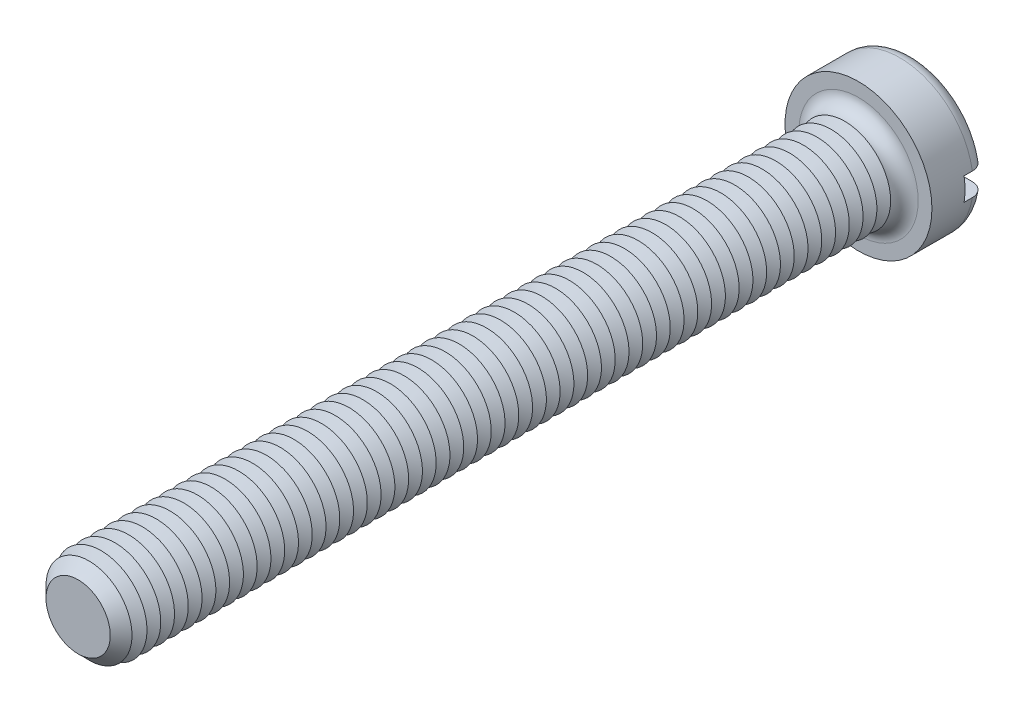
ISO-10303-21;
HEADER;
FILE_DESCRIPTION(('STEP AP214'),'2;1');
FILE_NAME('part.step','',(''),(''),'','','');
FILE_SCHEMA(('AUTOMOTIVE_DESIGN { 1 0 10303 214 1 1 1 1 }'));
ENDSEC;
DATA;
#1=APPLICATION_CONTEXT('core data for automotive mechanical design processes');
#2=APPLICATION_PROTOCOL_DEFINITION('international standard','automotive_design',2000,#1);
#3=PRODUCT_CONTEXT('',#1,'mechanical');
#4=PRODUCT('Part','Part','',(#3));
#5=PRODUCT_RELATED_PRODUCT_CATEGORY('part','',(#4));
#6=PRODUCT_DEFINITION_FORMATION('','',#4);
#7=PRODUCT_DEFINITION_CONTEXT('part definition',#1,'design');
#8=PRODUCT_DEFINITION('design','',#6,#7);
#9=PRODUCT_DEFINITION_SHAPE('','',#8);
#10=(LENGTH_UNIT() NAMED_UNIT(*) SI_UNIT(.MILLI.,.METRE.));
#11=(NAMED_UNIT(*) PLANE_ANGLE_UNIT() SI_UNIT($,.RADIAN.));
#12=(NAMED_UNIT(*) SI_UNIT($,.STERADIAN.) SOLID_ANGLE_UNIT());
#13=UNCERTAINTY_MEASURE_WITH_UNIT(LENGTH_MEASURE(1.E-05),#10,'distance_accuracy_value','');
#14=(GEOMETRIC_REPRESENTATION_CONTEXT(3) GLOBAL_UNCERTAINTY_ASSIGNED_CONTEXT((#13)) GLOBAL_UNIT_ASSIGNED_CONTEXT((#10,
#11,#12)) REPRESENTATION_CONTEXT('',''));
#15=CARTESIAN_POINT('',(0.,0.,0.));
#16=DIRECTION('',(0.,0.,1.));
#17=DIRECTION('',(1.,0.,0.));
#18=AXIS2_PLACEMENT_3D('',#15,#16,#17);
#19=CARTESIAN_POINT('',(0.,0.,-6.));
#20=DIRECTION('',(0.,0.,1.));
#21=DIRECTION('',(1.,0.,0.));
#22=AXIS2_PLACEMENT_3D('',#19,#20,#21);
#23=PLANE('',#22);
#24=CARTESIAN_POINT('',(0.,0.,-6.));
#25=DIRECTION('',(0.,0.,1.));
#26=DIRECTION('',(1.,0.,0.));
#27=AXIS2_PLACEMENT_3D('',#24,#25,#26);
#28=CIRCLE('',#27,6.5);
#29=CARTESIAN_POINT('',(-6.37867541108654,1.25,-6.));
#30=VERTEX_POINT('',#29);
#31=CARTESIAN_POINT('',(6.37867541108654,1.25,-6.));
#32=VERTEX_POINT('',#31);
#33=EDGE_CURVE('E116',#30,#32,#28,.F.);
#34=ORIENTED_EDGE('',*,*,#33,.T.);
#35=DIRECTION('',(1.,0.,0.));
#36=VECTOR('',#35,1.);
#37=CARTESIAN_POINT('',(-8.,1.25,-6.));
#38=LINE('',#37,#36);
#39=EDGE_CURVE('E111',#30,#32,#38,.T.);
#40=ORIENTED_EDGE('',*,*,#39,.F.);
#41=EDGE_LOOP('',(#34,#40));
#42=FACE_BOUND('',#41,.T.);
#43=ADVANCED_FACE('F39',(#42),#23,.F.);
#44=CARTESIAN_POINT('',(0.,0.,-4.5));
#45=DIRECTION('',(0.,0.,1.));
#46=DIRECTION('',(1.,0.,0.));
#47=AXIS2_PLACEMENT_3D('',#44,#45,#46);
#48=TOROIDAL_SURFACE('',#47,6.5,1.5);
#49=CARTESIAN_POINT('',(-7.63778128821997,1.25,-5.34492908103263));
#50=CARTESIAN_POINT('',(-7.58949199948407,1.25,-5.41482553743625));
#51=CARTESIAN_POINT('',(-7.53520056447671,1.25,-5.48065698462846));
#52=CARTESIAN_POINT('',(-7.41624971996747,1.25,-5.60228223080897));
#53=CARTESIAN_POINT('',(-7.35157642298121,1.25,-5.65806236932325));
#54=CARTESIAN_POINT('',(-7.21387612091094,1.25,-5.75795436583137));
#55=CARTESIAN_POINT('',(-7.14085828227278,1.25,-5.80207885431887));
#56=CARTESIAN_POINT('',(-6.98853766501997,1.25,-5.87758013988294));
#57=CARTESIAN_POINT('',(-6.90923642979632,1.25,-5.90896005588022));
#58=CARTESIAN_POINT('',(-6.74565677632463,1.25,-5.95849861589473));
#59=CARTESIAN_POINT('',(-6.66133328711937,1.25,-5.97650838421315));
#60=CARTESIAN_POINT('',(-6.49086565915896,1.25,-5.99833509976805));
#61=CARTESIAN_POINT('',(-6.40472129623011,1.25,-6.00215028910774));
#62=CARTESIAN_POINT('',(-6.23174891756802,1.25,-5.99550457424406));
#63=CARTESIAN_POINT('',(-6.14492874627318,1.25,-5.98483870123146));
#64=CARTESIAN_POINT('',(-5.97427268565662,1.25,-5.94920077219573));
#65=CARTESIAN_POINT('',(-5.89043699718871,1.25,-5.92422775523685));
#66=CARTESIAN_POINT('',(-5.72747580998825,1.25,-5.86041051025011));
#67=CARTESIAN_POINT('',(-5.64839123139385,1.25,-5.8214616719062));
#68=CARTESIAN_POINT('',(-5.49793182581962,1.25,-5.73076137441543));
#69=CARTESIAN_POINT('',(-5.42655700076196,1.25,-5.6790099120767));
#70=CARTESIAN_POINT('',(-5.29410028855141,1.25,-5.56444713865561));
#71=CARTESIAN_POINT('',(-5.23295591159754,1.25,-5.50170815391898));
#72=CARTESIAN_POINT('',(-5.12236155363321,1.25,-5.36664720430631));
#73=CARTESIAN_POINT('',(-5.07291010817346,1.25,-5.29432644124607));
#74=CARTESIAN_POINT('',(-4.98836421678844,1.25,-5.14389152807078));
#75=CARTESIAN_POINT('',(-4.95296843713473,1.25,-5.0659468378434));
#76=CARTESIAN_POINT('',(-4.89620356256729,1.25,-4.90510804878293));
#77=CARTESIAN_POINT('',(-4.87483169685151,1.25,-4.82221493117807));
#78=CARTESIAN_POINT('',(-4.8472995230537,1.25,-4.65636387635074));
#79=CARTESIAN_POINT('',(-4.84072446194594,1.25,-4.57347463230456));
#80=CARTESIAN_POINT('',(-4.84179430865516,1.25,-4.40779255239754));
#81=CARTESIAN_POINT('',(-4.84943782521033,1.25,-4.32499970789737));
#82=CARTESIAN_POINT('',(-4.87846819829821,1.25,-4.16301415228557));
#83=CARTESIAN_POINT('',(-4.89966978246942,1.25,-4.08378809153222));
#84=CARTESIAN_POINT('',(-4.95491528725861,1.25,-3.92995334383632));
#85=CARTESIAN_POINT('',(-4.98895983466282,1.25,-3.85534488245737));
#86=CARTESIAN_POINT('',(-5.06928242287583,1.25,-3.71183790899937));
#87=CARTESIAN_POINT('',(-5.11570495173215,1.25,-3.64302036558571));
#88=CARTESIAN_POINT('',(-5.21915370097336,1.25,-3.51388372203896));
#89=CARTESIAN_POINT('',(-5.27618132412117,1.25,-3.45356574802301));
#90=CARTESIAN_POINT('',(-5.40090076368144,1.25,-3.34137671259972));
#91=CARTESIAN_POINT('',(-5.46884305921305,1.25,-3.28978408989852));
#92=CARTESIAN_POINT('',(-5.61225757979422,1.25,-3.19841811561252));
#93=CARTESIAN_POINT('',(-5.68773079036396,1.25,-3.15864631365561));
#94=CARTESIAN_POINT('',(-5.84602026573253,1.25,-3.09111626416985));
#95=CARTESIAN_POINT('',(-5.92896901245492,1.25,-3.06366820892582));
#96=CARTESIAN_POINT('',(-6.09827849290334,1.25,-3.02294686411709));
#97=CARTESIAN_POINT('',(-6.18463944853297,1.25,-3.00967449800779));
#98=CARTESIAN_POINT('',(-6.35914138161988,1.25,-2.99765063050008));
#99=CARTESIAN_POINT('',(-6.4472913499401,1.25,-2.99902877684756));
#100=CARTESIAN_POINT('',(-6.62209547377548,1.25,-3.01665363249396));
#101=CARTESIAN_POINT('',(-6.70874965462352,1.25,-3.03290008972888));
#102=CARTESIAN_POINT('',(-6.87754008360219,1.25,-3.07975247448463));
#103=CARTESIAN_POINT('',(-6.95969991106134,1.25,-3.11027336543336));
#104=CARTESIAN_POINT('',(-7.11762200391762,1.25,-3.18486653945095));
#105=CARTESIAN_POINT('',(-7.19338469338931,1.25,-3.22893792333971));
#106=CARTESIAN_POINT('',(-7.33522754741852,1.25,-3.32873457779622));
#107=CARTESIAN_POINT('',(-7.40142768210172,1.25,-3.38428930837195));
#108=CARTESIAN_POINT('',(-7.52338344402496,1.25,-3.50587739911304));
#109=CARTESIAN_POINT('',(-7.5791399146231,1.25,-3.57190991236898));
#110=CARTESIAN_POINT('',(-7.67774856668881,1.25,-3.71151097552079));
#111=CARTESIAN_POINT('',(-7.72078137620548,1.25,-3.7849519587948));
#112=CARTESIAN_POINT('',(-7.79373860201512,1.25,-3.93807617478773));
#113=CARTESIAN_POINT('',(-7.82366445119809,1.25,-4.01775872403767));
#114=CARTESIAN_POINT('',(-7.86922494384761,1.25,-4.1801114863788));
#115=CARTESIAN_POINT('',(-7.88502105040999,1.25,-4.26273642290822));
#116=CARTESIAN_POINT('',(-7.90243332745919,1.25,-4.42948977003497));
#117=CARTESIAN_POINT('',(-7.90404643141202,1.25,-4.51361850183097));
#118=CARTESIAN_POINT('',(-7.89306914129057,1.25,-4.68049925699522));
#119=CARTESIAN_POINT('',(-7.88055163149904,1.25,-4.76325613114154));
#120=CARTESIAN_POINT('',(-7.84181179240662,1.25,-4.92542124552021));
#121=CARTESIAN_POINT('',(-7.81560657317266,1.25,-5.00483353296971));
#122=CARTESIAN_POINT('',(-7.76329893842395,1.25,-5.12766777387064));
#123=CARTESIAN_POINT('',(-7.74127773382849,1.25,-5.17287245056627));
#124=CARTESIAN_POINT('',(-7.69279783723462,1.25,-5.26083500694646));
#125=CARTESIAN_POINT('',(-7.66633917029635,1.25,-5.30359290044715));
#126=CARTESIAN_POINT('',(-7.63778128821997,1.25,-5.34492908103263));
#127=B_SPLINE_CURVE_WITH_KNOTS('',3,(#49,#50,#51,#52,#53,#54,#55,#56,#57,#58,#59,#60,#61,#62,
#63,#64,#65,#66,#67,#68,#69,#70,#71,#72,#73,#74,#75,#76,#77,#78,#79,#80,#81,#82,#83,#84,#85,#86,
#87,#88,#89,#90,#91,#92,#93,#94,#95,#96,#97,#98,#99,#100,#101,#102,#103,#104,#105,#106,#107,
#108,#109,#110,#111,#112,#113,#114,#115,#116,#117,#118,#119,#120,#121,#122,#123,#124,#125,#126),
.UNSPECIFIED.,.T.,.F.,(4,2,2,2,2,2,2,2,2,2,2,2,2,2,2,2,2,2,2,2,2,2,2,2,2,2,2,2,2,2,2,2,2,2,2,2,
2,2,4),(0.,0.254678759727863,0.509701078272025,0.764445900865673,1.01912834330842,
1.27660578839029,1.53411511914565,1.7953075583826,2.05651754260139,2.31972495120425,
2.58293242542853,2.84446831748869,3.10597143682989,3.36151874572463,3.61701554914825,
3.86525656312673,4.11347328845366,4.35836855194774,4.60327576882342,4.8511774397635,
5.0991119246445,5.35387584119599,5.60867314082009,5.86956650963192,6.13047687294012,
6.39369803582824,6.65691473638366,6.91858297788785,7.18023385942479,7.43824706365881,
7.69623942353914,7.95037087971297,8.20447454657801,8.45563599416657,8.70685174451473,
8.95677764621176,9.20639187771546,9.35700761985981,9.50762251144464),.UNSPECIFIED.);
#128=CARTESIAN_POINT('',(-7.90174031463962,1.25,-4.50000000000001));
#129=VERTEX_POINT('',#128);
#130=EDGE_CURVE('E624',#129,#30,#127,.T.);
#131=ORIENTED_EDGE('',*,*,#130,.F.);
#132=CARTESIAN_POINT('',(0.,0.,-4.5));
#133=DIRECTION('',(0.,0.,1.));
#134=DIRECTION('',(1.,0.,0.));
#135=AXIS2_PLACEMENT_3D('',#132,#133,#134);
#136=CIRCLE('',#135,8.);
#137=CARTESIAN_POINT('',(7.90174031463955,1.25,-4.5));
#138=VERTEX_POINT('',#137);
#139=EDGE_CURVE('E124',#138,#129,#136,.T.);
#140=ORIENTED_EDGE('',*,*,#139,.F.);
#141=CARTESIAN_POINT('',(4.95236709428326,1.25,-5.05808354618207));
#142=CARTESIAN_POINT('',(4.98477386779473,1.25,-5.13646278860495));
#143=CARTESIAN_POINT('',(5.02397623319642,1.25,-5.21210974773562));
#144=CARTESIAN_POINT('',(5.11464829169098,1.25,-5.35575180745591));
#145=CARTESIAN_POINT('',(5.16613670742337,1.25,-5.42373499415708));
#146=CARTESIAN_POINT('',(5.27963080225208,1.25,-5.55005899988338));
#147=CARTESIAN_POINT('',(5.34161871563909,1.25,-5.60841578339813));
#148=CARTESIAN_POINT('',(5.47431803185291,1.25,-5.71412381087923));
#149=CARTESIAN_POINT('',(5.545027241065,1.25,-5.76147781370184));
#150=CARTESIAN_POINT('',(5.69469818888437,1.25,-5.84486022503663));
#151=CARTESIAN_POINT('',(5.77379661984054,1.25,-5.88064336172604));
#152=CARTESIAN_POINT('',(5.93682776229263,1.25,-5.93863952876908));
#153=CARTESIAN_POINT('',(6.02076112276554,1.25,-5.96085073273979));
#154=CARTESIAN_POINT('',(6.19235911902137,1.25,-5.99130732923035));
#155=CARTESIAN_POINT('',(6.2800597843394,1.25,-5.99935025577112));
#156=CARTESIAN_POINT('',(6.45556807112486,1.25,-6.00057400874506));
#157=CARTESIAN_POINT('',(6.54337569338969,1.25,-5.99375472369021));
#158=CARTESIAN_POINT('',(6.71642471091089,1.25,-5.96539034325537));
#159=CARTESIAN_POINT('',(6.8016703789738,1.25,-5.94387137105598));
#160=CARTESIAN_POINT('',(6.96726399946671,1.25,-5.8866508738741));
#161=CARTESIAN_POINT('',(7.04761223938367,1.25,-5.85095018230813));
#162=CARTESIAN_POINT('',(7.2000703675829,1.25,-5.7668235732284));
#163=CARTESIAN_POINT('',(7.27226868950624,1.25,-5.71855796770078));
#164=CARTESIAN_POINT('',(7.40737382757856,1.25,-5.61041520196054));
#165=CARTESIAN_POINT('',(7.47028138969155,1.25,-5.55053897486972));
#166=CARTESIAN_POINT('',(7.5840004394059,1.25,-5.42185995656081));
#167=CARTESIAN_POINT('',(7.63498189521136,1.25,-5.35320736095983));
#168=CARTESIAN_POINT('',(7.72451646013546,1.25,-5.20822613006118));
#169=CARTESIAN_POINT('',(7.76307051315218,1.25,-5.13189807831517));
#170=CARTESIAN_POINT('',(7.82615156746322,1.25,-4.97479919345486));
#171=CARTESIAN_POINT('',(7.85085353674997,1.25,-4.89409858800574));
#172=CARTESIAN_POINT('',(7.88624162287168,1.25,-4.72968126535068));
#173=CARTESIAN_POINT('',(7.89692844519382,1.25,-4.64596470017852));
#174=CARTESIAN_POINT('',(7.90393395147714,1.25,-4.47857496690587));
#175=CARTESIAN_POINT('',(7.900361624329,1.25,-4.39490633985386));
#176=CARTESIAN_POINT('',(7.8792027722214,1.25,-4.22936201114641));
#177=CARTESIAN_POINT('',(7.86161649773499,1.25,-4.14748627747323));
#178=CARTESIAN_POINT('',(7.81298565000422,1.25,-3.98793539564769));
#179=CARTESIAN_POINT('',(7.78195585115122,1.25,-3.91025574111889));
#180=CARTESIAN_POINT('',(7.70736418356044,1.25,-3.76116938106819));
#181=CARTESIAN_POINT('',(7.66380211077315,1.25,-3.68976277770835));
#182=CARTESIAN_POINT('',(7.56515173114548,1.25,-3.55480889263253));
#183=CARTESIAN_POINT('',(7.51000119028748,1.25,-3.49130712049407));
#184=CARTESIAN_POINT('',(7.38992820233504,1.25,-3.3743390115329));
#185=CARTESIAN_POINT('',(7.32500529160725,1.25,-3.32087315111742));
#186=CARTESIAN_POINT('',(7.18646521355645,1.25,-3.22483712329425));
#187=CARTESIAN_POINT('',(7.11275872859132,1.25,-3.18239583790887));
#188=CARTESIAN_POINT('',(6.95934489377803,1.25,-3.11028530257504));
#189=CARTESIAN_POINT('',(6.87963710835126,1.25,-3.08061698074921));
#190=CARTESIAN_POINT('',(6.71523243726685,1.25,-3.03442872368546));
#191=CARTESIAN_POINT('',(6.63047940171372,1.25,-3.0181086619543));
#192=CARTESIAN_POINT('',(6.45944163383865,1.25,-2.99971307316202));
#193=CARTESIAN_POINT('',(6.37315677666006,1.25,-2.99763871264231));
#194=CARTESIAN_POINT('',(6.20021063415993,1.25,-3.00779604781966));
#195=CARTESIAN_POINT('',(6.11356117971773,1.25,-3.02022976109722));
#196=CARTESIAN_POINT('',(5.94354092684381,1.25,-3.05935975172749));
#197=CARTESIAN_POINT('',(5.86017035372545,1.25,-3.08605700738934));
#198=CARTESIAN_POINT('',(5.69848536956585,1.25,-3.15322746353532));
#199=CARTESIAN_POINT('',(5.62021039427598,1.25,-3.1937956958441));
#200=CARTESIAN_POINT('',(5.47164170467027,1.25,-3.28758816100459));
#201=CARTESIAN_POINT('',(5.40134797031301,1.25,-3.3408123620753));
#202=CARTESIAN_POINT('',(5.27136483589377,1.25,-3.45806317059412));
#203=CARTESIAN_POINT('',(5.21160120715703,1.25,-3.52200740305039));
#204=CARTESIAN_POINT('',(5.10396941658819,1.25,-3.65922833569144));
#205=CARTESIAN_POINT('',(5.05609917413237,1.25,-3.73250340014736));
#206=CARTESIAN_POINT('',(4.97487058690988,1.25,-3.8844714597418));
#207=CARTESIAN_POINT('',(4.94119529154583,1.25,-3.96299495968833));
#208=CARTESIAN_POINT('',(4.88793322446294,1.25,-4.12470694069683));
#209=CARTESIAN_POINT('',(4.86834741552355,1.25,-4.20789574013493));
#210=CARTESIAN_POINT('',(4.84433446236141,1.25,-4.3740749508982));
#211=CARTESIAN_POINT('',(4.83950391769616,1.25,-4.45700748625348));
#212=CARTESIAN_POINT('',(4.84404021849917,1.25,-4.62240731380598));
#213=CARTESIAN_POINT('',(4.85338770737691,1.25,-4.70487508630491));
#214=CARTESIAN_POINT('',(4.87895619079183,1.25,-4.83246978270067));
#215=CARTESIAN_POINT('',(4.89056704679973,1.25,-4.87856970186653));
#216=CARTESIAN_POINT('',(4.91819711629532,1.25,-4.96942661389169));
#217=CARTESIAN_POINT('',(4.93421619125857,1.25,-5.01418364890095));
#218=CARTESIAN_POINT('',(4.95236709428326,1.25,-5.05808354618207));
#219=B_SPLINE_CURVE_WITH_KNOTS('',3,(#141,#142,#143,#144,#145,#146,#147,#148,#149,#150,#151,
#152,#153,#154,#155,#156,#157,#158,#159,#160,#161,#162,#163,#164,#165,#166,#167,#168,#169,#170,
#171,#172,#173,#174,#175,#176,#177,#178,#179,#180,#181,#182,#183,#184,#185,#186,#187,#188,#189,
#190,#191,#192,#193,#194,#195,#196,#197,#198,#199,#200,#201,#202,#203,#204,#205,#206,#207,#208,
#209,#210,#211,#212,#213,#214,#215,#216,#217,#218),.UNSPECIFIED.,.T.,.F.,(4,2,2,2,2,2,2,2,2,2,2,
2,2,2,2,2,2,2,2,2,2,2,2,2,2,2,2,2,2,2,2,2,2,2,2,2,2,2,4),(0.,0.25426396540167,0.508917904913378,
0.763145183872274,1.01730864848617,1.27655188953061,1.53583000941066,1.79878406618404,
2.06174009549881,2.32423003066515,2.5867045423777,2.84598168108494,3.10523799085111,
3.36053725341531,3.61581712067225,3.8677953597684,4.11976091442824,4.36980428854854,
4.61984319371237,4.86960800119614,5.11937687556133,5.37052303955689,5.62168112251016,
5.87565515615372,6.12964764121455,6.38737709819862,6.64512765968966,6.90651052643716,
7.16791132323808,7.43114013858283,7.69436829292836,7.95565940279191,8.21690477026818,
8.47196060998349,8.72703387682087,8.97506819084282,9.22276418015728,9.36518087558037,
9.50759309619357),.UNSPECIFIED.);
#220=EDGE_CURVE('E626',#32,#138,#219,.T.);
#221=ORIENTED_EDGE('',*,*,#220,.F.);
#222=ORIENTED_EDGE('',*,*,#33,.F.);
#223=EDGE_LOOP('',(#131,#140,#221,#222));
#224=FACE_BOUND('',#223,.T.);
#225=ADVANCED_FACE('F608',(#224),#48,.T.);
#226=CARTESIAN_POINT('',(0.,0.,-6.));
#227=DIRECTION('',(0.,0.,1.));
#228=DIRECTION('',(1.,0.,0.));
#229=AXIS2_PLACEMENT_3D('',#226,#227,#228);
#230=CYLINDRICAL_SURFACE('',#229,8.);
#231=DIRECTION('',(0.,0.,1.));
#232=VECTOR('',#231,1.);
#233=CARTESIAN_POINT('',(7.90174031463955,1.25,-6.));
#234=LINE('',#233,#232);
#235=CARTESIAN_POINT('',(7.90174031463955,1.25,-3.6));
#236=VERTEX_POINT('',#235);
#237=EDGE_CURVE('E640',#138,#236,#234,.T.);
#238=ORIENTED_EDGE('',*,*,#237,.F.);
#239=ORIENTED_EDGE('',*,*,#139,.T.);
#240=DIRECTION('',(0.,0.,1.));
#241=VECTOR('',#240,1.);
#242=CARTESIAN_POINT('',(-7.90174031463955,1.25,-6.));
#243=LINE('',#242,#241);
#244=CARTESIAN_POINT('',(-7.90174031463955,1.25,-3.6));
#245=VERTEX_POINT('',#244);
#246=EDGE_CURVE('E63',#245,#129,#243,.F.);
#247=ORIENTED_EDGE('',*,*,#246,.F.);
#248=CARTESIAN_POINT('',(0.,0.,-3.6));
#249=DIRECTION('',(0.,0.,-1.));
#250=DIRECTION('',(-1.,0.,0.));
#251=AXIS2_PLACEMENT_3D('',#248,#249,#250);
#252=CIRCLE('',#251,8.);
#253=CARTESIAN_POINT('',(-7.90174031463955,-1.25,-3.6));
#254=VERTEX_POINT('',#253);
#255=EDGE_CURVE('E43',#245,#254,#252,.F.);
#256=ORIENTED_EDGE('',*,*,#255,.T.);
#257=DIRECTION('',(0.,0.,1.));
#258=VECTOR('',#257,1.);
#259=CARTESIAN_POINT('',(-7.90174031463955,-1.25,-6.));
#260=LINE('',#259,#258);
#261=CARTESIAN_POINT('',(-7.9017403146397,-1.25,-4.49999999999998));
#262=VERTEX_POINT('',#261);
#263=EDGE_CURVE('E637',#262,#254,#260,.T.);
#264=ORIENTED_EDGE('',*,*,#263,.F.);
#265=CARTESIAN_POINT('',(7.90174031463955,-1.25,-4.5));
#266=VERTEX_POINT('',#265);
#267=EDGE_CURVE('E126',#262,#266,#136,.T.);
#268=ORIENTED_EDGE('',*,*,#267,.T.);
#269=DIRECTION('',(0.,0.,1.));
#270=VECTOR('',#269,1.);
#271=CARTESIAN_POINT('',(7.90174031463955,-1.25,-6.));
#272=LINE('',#271,#270);
#273=CARTESIAN_POINT('',(7.90174031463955,-1.25,-3.6));
#274=VERTEX_POINT('',#273);
#275=EDGE_CURVE('E55',#274,#266,#272,.F.);
#276=ORIENTED_EDGE('',*,*,#275,.F.);
#277=EDGE_CURVE('E11',#274,#236,#252,.F.);
#278=ORIENTED_EDGE('',*,*,#277,.T.);
#279=EDGE_LOOP('',(#238,#239,#247,#256,#264,#268,#276,#278));
#280=FACE_BOUND('',#279,.T.);
#281=CARTESIAN_POINT('',(0.,0.,0.));
#282=DIRECTION('',(0.,0.,1.));
#283=DIRECTION('',(1.,0.,0.));
#284=AXIS2_PLACEMENT_3D('',#281,#282,#283);
#285=CIRCLE('',#284,8.);
#286=CARTESIAN_POINT('',(8.,0.,0.));
#287=VERTEX_POINT('',#286);
#288=EDGE_CURVE('E643',#287,#287,#285,.T.);
#289=ORIENTED_EDGE('',*,*,#288,.F.);
#290=EDGE_LOOP('',(#289));
#291=FACE_BOUND('',#290,.T.);
#292=ADVANCED_FACE('F604',(#280,#291),#230,.T.);
#293=CARTESIAN_POINT('',(6.37867541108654,-1.25,-6.));
#294=VERTEX_POINT('',#293);
#295=CARTESIAN_POINT('',(-6.37867541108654,-1.25,-6.));
#296=VERTEX_POINT('',#295);
#297=EDGE_CURVE('E109',#294,#296,#28,.F.);
#298=ORIENTED_EDGE('',*,*,#297,.T.);
#299=DIRECTION('',(-1.,0.,0.));
#300=VECTOR('',#299,1.);
#301=CARTESIAN_POINT('',(-8.,-1.25,-6.));
#302=LINE('',#301,#300);
#303=EDGE_CURVE('E96',#294,#296,#302,.T.);
#304=ORIENTED_EDGE('',*,*,#303,.F.);
#305=EDGE_LOOP('',(#298,#304));
#306=FACE_BOUND('',#305,.T.);
#307=ADVANCED_FACE('F108',(#306),#23,.F.);
#308=CARTESIAN_POINT('',(0.,0.,0.));
#309=DIRECTION('',(0.,0.,1.));
#310=DIRECTION('',(1.,0.,0.));
#311=AXIS2_PLACEMENT_3D('',#308,#309,#310);
#312=PLANE('',#311);
#313=CARTESIAN_POINT('',(0.,0.,0.));
#314=DIRECTION('',(0.,0.,1.));
#315=DIRECTION('',(1.,0.,0.));
#316=AXIS2_PLACEMENT_3D('',#313,#314,#315);
#317=CIRCLE('',#316,6.5);
#318=CARTESIAN_POINT('',(6.5,0.,0.));
#319=VERTEX_POINT('',#318);
#320=EDGE_CURVE('E115',#319,#319,#317,.F.);
#321=ORIENTED_EDGE('',*,*,#320,.T.);
#322=EDGE_LOOP('',(#321));
#323=FACE_BOUND('',#322,.T.);
#324=ORIENTED_EDGE('',*,*,#288,.T.);
#325=EDGE_LOOP('',(#324));
#326=FACE_BOUND('',#325,.T.);
#327=ADVANCED_FACE('F603',(#323,#326),#312,.T.);
#328=CARTESIAN_POINT('',(-7.63778128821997,-1.25,-5.34492908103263));
#329=CARTESIAN_POINT('',(-7.68527581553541,-1.25,-5.27616964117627));
#330=CARTESIAN_POINT('',(-7.72703224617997,-1.25,-5.20337764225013));
#331=CARTESIAN_POINT('',(-7.79778035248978,-1.25,-5.05176511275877));
#332=CARTESIAN_POINT('',(-7.82675823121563,-1.25,-4.97293817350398));
#333=CARTESIAN_POINT('',(-7.87103239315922,-1.25,-4.81153865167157));
#334=CARTESIAN_POINT('',(-7.8863313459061,-1.25,-4.72896680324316));
#335=CARTESIAN_POINT('',(-7.90278562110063,-1.25,-4.56244566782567));
#336=CARTESIAN_POINT('',(-7.90394420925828,-1.25,-4.4784967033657));
#337=CARTESIAN_POINT('',(-7.89211470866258,-1.25,-4.31190980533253));
#338=CARTESIAN_POINT('',(-7.87917806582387,-1.25,-4.22926821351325));
#339=CARTESIAN_POINT('',(-7.8396278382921,-1.25,-4.06732477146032));
#340=CARTESIAN_POINT('',(-7.81301388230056,-1.25,-3.98802301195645));
#341=CARTESIAN_POINT('',(-7.74686575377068,-1.25,-3.83490116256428));
#342=CARTESIAN_POINT('',(-7.70731700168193,-1.25,-3.76108737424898));
#343=CARTESIAN_POINT('',(-7.61647675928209,-1.25,-3.62108231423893));
#344=CARTESIAN_POINT('',(-7.56518496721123,-1.25,-3.55489123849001));
#345=CARTESIAN_POINT('',(-7.45192141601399,-1.25,-3.43145488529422));
#346=CARTESIAN_POINT('',(-7.3898717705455,-1.25,-3.37428109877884));
#347=CARTESIAN_POINT('',(-7.25715883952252,-1.25,-3.27100737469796));
#348=CARTESIAN_POINT('',(-7.18649507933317,-1.25,-3.22490804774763));
#349=CARTESIAN_POINT('',(-7.03760898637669,-1.25,-3.14445316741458));
#350=CARTESIAN_POINT('',(-6.95930204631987,-1.25,-3.1102542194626));
#351=CARTESIAN_POINT('',(-6.79811453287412,-1.25,-3.05526915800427));
#352=CARTESIAN_POINT('',(-6.71523359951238,-1.25,-3.03448410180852));
#353=CARTESIAN_POINT('',(-6.5459165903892,-1.25,-3.006592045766));
#354=CARTESIAN_POINT('',(-6.45944575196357,-1.25,-2.99969602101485));
#355=CARTESIAN_POINT('',(-6.28655568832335,-1.25,-3.00032465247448));
#356=CARTESIAN_POINT('',(-6.20013646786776,-1.25,-3.00785047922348));
#357=CARTESIAN_POINT('',(-6.02865505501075,-1.25,-3.03725742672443));
#358=CARTESIAN_POINT('',(-5.94362352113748,-1.25,-3.05931758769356));
#359=CARTESIAN_POINT('',(-5.77844448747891,-1.25,-3.11735373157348));
#360=CARTESIAN_POINT('',(-5.69829723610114,-1.25,-3.15333042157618));
#361=CARTESIAN_POINT('',(-5.54495924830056,-1.25,-3.23837037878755));
#362=CARTESIAN_POINT('',(-5.47178958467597,-1.25,-3.28747168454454));
#363=CARTESIAN_POINT('',(-5.33486536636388,-1.25,-3.39741183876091));
#364=CARTESIAN_POINT('',(-5.27111040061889,-1.25,-3.45825017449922));
#365=CARTESIAN_POINT('',(-5.15579778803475,-1.25,-3.58914722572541));
#366=CARTESIAN_POINT('',(-5.10409113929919,-1.25,-3.65907455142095));
#367=CARTESIAN_POINT('',(-5.01353659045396,-1.25,-3.8068142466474));
#368=CARTESIAN_POINT('',(-4.97468647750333,-1.25,-3.88462525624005));
#369=CARTESIAN_POINT('',(-4.91208858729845,-1.25,-4.04366636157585));
#370=CARTESIAN_POINT('',(-4.88795969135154,-1.25,-4.12474643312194));
#371=CARTESIAN_POINT('',(-4.85404909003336,-1.25,-4.28985038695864));
#372=CARTESIAN_POINT('',(-4.84426486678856,-1.25,-4.37387374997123));
#373=CARTESIAN_POINT('',(-4.83946276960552,-1.25,-4.54023897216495));
#374=CARTESIAN_POINT('',(-4.8440833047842,-1.25,-4.62257060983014));
#375=CARTESIAN_POINT('',(-4.86713763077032,-1.25,-4.78527148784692));
#376=CARTESIAN_POINT('',(-4.88557092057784,-1.25,-4.86564079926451));
#377=CARTESIAN_POINT('',(-4.9355229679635,-1.25,-5.02189555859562));
#378=CARTESIAN_POINT('',(-4.9669975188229,-1.25,-5.09779517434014));
#379=CARTESIAN_POINT('',(-5.04199393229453,-1.25,-5.24338322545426));
#380=CARTESIAN_POINT('',(-5.0855168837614,-1.25,-5.31307109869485));
#381=CARTESIAN_POINT('',(-5.18427540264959,-1.25,-5.44580979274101));
#382=CARTESIAN_POINT('',(-5.2397318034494,-1.25,-5.50869620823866));
#383=CARTESIAN_POINT('',(-5.36015301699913,-1.25,-5.62458635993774));
#384=CARTESIAN_POINT('',(-5.42511919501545,-1.25,-5.67758867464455));
#385=CARTESIAN_POINT('',(-5.56469412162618,-1.25,-5.7737610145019));
#386=CARTESIAN_POINT('',(-5.6395232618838,-1.25,-5.81661133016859));
#387=CARTESIAN_POINT('',(-5.79521544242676,-1.25,-5.8894110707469));
#388=CARTESIAN_POINT('',(-5.8760791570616,-1.25,-5.91935905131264));
#389=CARTESIAN_POINT('',(-6.04317815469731,-1.25,-5.9660059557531));
#390=CARTESIAN_POINT('',(-6.12948555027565,-1.25,-5.98244700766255));
#391=CARTESIAN_POINT('',(-6.30363462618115,-1.25,-6.00064866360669));
#392=CARTESIAN_POINT('',(-6.39147629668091,-1.25,-6.00240936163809));
#393=CARTESIAN_POINT('',(-6.5664192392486,-1.25,-5.9911248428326));
#394=CARTESIAN_POINT('',(-6.653518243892,-1.25,-5.9780442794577));
#395=CARTESIAN_POINT('',(-6.82426167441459,-1.25,-5.93729204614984));
#396=CARTESIAN_POINT('',(-6.90790538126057,-1.25,-5.90961735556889));
#397=CARTESIAN_POINT('',(-7.06846412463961,-1.25,-5.84071272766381));
#398=CARTESIAN_POINT('',(-7.14543542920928,-1.25,-5.79961377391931));
#399=CARTESIAN_POINT('',(-7.29116896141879,-1.25,-5.70491210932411));
#400=CARTESIAN_POINT('',(-7.35994165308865,-1.25,-5.65132560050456));
#401=CARTESIAN_POINT('',(-7.46362894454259,-1.25,-5.55509815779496));
#402=CARTESIAN_POINT('',(-7.50165191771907,-1.25,-5.51575032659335));
#403=CARTESIAN_POINT('',(-7.57319530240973,-1.25,-5.43315308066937));
#404=CARTESIAN_POINT('',(-7.60671575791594,-1.25,-5.38990370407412));
#405=CARTESIAN_POINT('',(-7.63778128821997,-1.25,-5.34492908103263));
#406=B_SPLINE_CURVE_WITH_KNOTS('',3,(#328,#329,#330,#331,#332,#333,#334,#335,#336,#337,#338,
#339,#340,#341,#342,#343,#344,#345,#346,#347,#348,#349,#350,#351,#352,#353,#354,#355,#356,#357,
#358,#359,#360,#361,#362,#363,#364,#365,#366,#367,#368,#369,#370,#371,#372,#373,#374,#375,#376,
#377,#378,#379,#380,#381,#382,#383,#384,#385,#386,#387,#388,#389,#390,#391,#392,#393,#394,#395,
#396,#397,#398,#399,#400,#401,#402,#403,#404,#405),.UNSPECIFIED.,.T.,.F.,(4,2,2,2,2,2,2,2,2,2,2,
2,2,2,2,2,2,2,2,2,2,2,2,2,2,2,2,2,2,2,2,2,2,2,2,2,2,2,4),(0.,0.250506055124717,
0.501281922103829,0.752008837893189,1.00267784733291,1.25243500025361,1.50219893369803,
1.75224536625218,2.00229822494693,2.25424343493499,2.50620253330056,2.76136198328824,
3.01654154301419,3.27556891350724,3.53461730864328,3.79691797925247,4.05923197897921,
4.32231463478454,4.5853858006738,4.84500678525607,5.10458306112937,5.3571172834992,
5.60960717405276,5.85581050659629,6.10200490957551,6.34737151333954,6.59276029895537,
6.84315522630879,7.09358613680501,7.35108485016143,7.60861238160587,7.87094926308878,
8.13328446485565,8.39624576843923,8.65926152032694,8.91978401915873,9.17997036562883,
9.34382460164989,9.50767723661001),.UNSPECIFIED.);
#407=EDGE_CURVE('E103',#296,#262,#406,.T.);
#408=ORIENTED_EDGE('',*,*,#407,.F.);
#409=ORIENTED_EDGE('',*,*,#297,.F.);
#410=CARTESIAN_POINT('',(4.95236709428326,-1.25,-5.05808354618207));
#411=CARTESIAN_POINT('',(4.92105512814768,-1.25,-4.98233216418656));
#412=CARTESIAN_POINT('',(4.89604361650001,-1.25,-4.90392040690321));
#413=CARTESIAN_POINT('',(4.85951223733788,-1.25,-4.74395758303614));
#414=CARTESIAN_POINT('',(4.8480045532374,-1.25,-4.66240375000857));
#415=CARTESIAN_POINT('',(4.83891469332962,-1.25,-4.49852199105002));
#416=CARTESIAN_POINT('',(4.84133145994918,-1.25,-4.41619412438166));
#417=CARTESIAN_POINT('',(4.8600038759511,-1.25,-4.25314313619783));
#418=CARTESIAN_POINT('',(4.87625705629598,-1.25,-4.17241973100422));
#419=CARTESIAN_POINT('',(4.92196554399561,-1.25,-4.01505032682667));
#420=CARTESIAN_POINT('',(4.95138456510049,-1.25,-3.93839376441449));
#421=CARTESIAN_POINT('',(5.02244158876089,-1.25,-3.79097367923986));
#422=CARTESIAN_POINT('',(5.06408092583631,-1.25,-3.72021080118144));
#423=CARTESIAN_POINT('',(5.15918188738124,-1.25,-3.5851203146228));
#424=CARTESIAN_POINT('',(5.21285223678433,-1.25,-3.5209397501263));
#425=CARTESIAN_POINT('',(5.32993512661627,-1.25,-3.40218700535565));
#426=CARTESIAN_POINT('',(5.39334903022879,-1.25,-3.34761617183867));
#427=CARTESIAN_POINT('',(5.5300552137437,-1.25,-3.24801679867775));
#428=CARTESIAN_POINT('',(5.60357647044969,-1.25,-3.20330242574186));
#429=CARTESIAN_POINT('',(5.75697062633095,-1.25,-3.1265687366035));
#430=CARTESIAN_POINT('',(5.83684424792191,-1.25,-3.09455086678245));
#431=CARTESIAN_POINT('',(6.00239031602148,-1.25,-3.04353393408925));
#432=CARTESIAN_POINT('',(6.08814636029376,-1.25,-3.02480570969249));
#433=CARTESIAN_POINT('',(6.26158564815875,-1.25,-3.00194915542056));
#434=CARTESIAN_POINT('',(6.34926896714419,-1.25,-2.997821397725));
#435=CARTESIAN_POINT('',(6.52441816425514,-1.25,-3.00435236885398));
#436=CARTESIAN_POINT('',(6.61188199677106,-1.25,-3.01506655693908));
#437=CARTESIAN_POINT('',(6.78373130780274,-1.25,-3.05116556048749));
#438=CARTESIAN_POINT('',(6.8681168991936,-1.25,-3.07654983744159));
#439=CARTESIAN_POINT('',(7.03056473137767,-1.25,-3.14105639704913));
#440=CARTESIAN_POINT('',(7.10867812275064,-1.25,-3.18004978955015));
#441=CARTESIAN_POINT('',(7.25711285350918,-1.25,-3.27078804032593));
#442=CARTESIAN_POINT('',(7.327434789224,-1.25,-3.32253192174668));
#443=CARTESIAN_POINT('',(7.45716954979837,-1.25,-3.4364775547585));
#444=CARTESIAN_POINT('',(7.51672925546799,-1.25,-3.49851206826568));
#445=CARTESIAN_POINT('',(7.62440498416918,-1.25,-3.63182557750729));
#446=CARTESIAN_POINT('',(7.67252193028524,-1.25,-3.70310382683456));
#447=CARTESIAN_POINT('',(7.75523498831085,-1.25,-3.8517825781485));
#448=CARTESIAN_POINT('',(7.79001407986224,-1.25,-3.92908131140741));
#449=CARTESIAN_POINT('',(7.84595474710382,-1.25,-4.08845836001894));
#450=CARTESIAN_POINT('',(7.86711715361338,-1.25,-4.1705363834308));
#451=CARTESIAN_POINT('',(7.89503817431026,-1.25,-4.3362768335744));
#452=CARTESIAN_POINT('',(7.90193595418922,-1.25,-4.41991584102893));
#453=CARTESIAN_POINT('',(7.90153623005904,-1.25,-4.58715860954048));
#454=CARTESIAN_POINT('',(7.89423915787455,-1.25,-4.67076237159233));
#455=CARTESIAN_POINT('',(7.86572271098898,-1.25,-4.83525080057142));
#456=CARTESIAN_POINT('',(7.84455307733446,-1.25,-4.91614410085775));
#457=CARTESIAN_POINT('',(7.78897430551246,-1.25,-5.0732444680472));
#458=CARTESIAN_POINT('',(7.75456511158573,-1.25,-5.1494515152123));
#459=CARTESIAN_POINT('',(7.67339923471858,-1.25,-5.29528903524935));
#460=CARTESIAN_POINT('',(7.62660424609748,-1.25,-5.36489817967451));
#461=CARTESIAN_POINT('',(7.52209201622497,-1.25,-5.49536318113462));
#462=CARTESIAN_POINT('',(7.4643743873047,-1.25,-5.55621872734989));
#463=CARTESIAN_POINT('',(7.33909994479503,-1.25,-5.66807257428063));
#464=CARTESIAN_POINT('',(7.27145672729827,-1.25,-5.71897407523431));
#465=CARTESIAN_POINT('',(7.12868060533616,-1.25,-5.80887807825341));
#466=CARTESIAN_POINT('',(7.0535472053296,-1.25,-5.84787979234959));
#467=CARTESIAN_POINT('',(6.89682225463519,-1.25,-5.91345911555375));
#468=CARTESIAN_POINT('',(6.81515596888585,-1.25,-5.93985808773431));
#469=CARTESIAN_POINT('',(6.64858434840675,-1.25,-5.97879449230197));
#470=CARTESIAN_POINT('',(6.56367874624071,-1.25,-5.99133077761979));
#471=CARTESIAN_POINT('',(6.39168259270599,-1.25,-6.00236627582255));
#472=CARTESIAN_POINT('',(6.30457835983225,-1.25,-6.00065255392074));
#473=CARTESIAN_POINT('',(6.13186422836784,-1.25,-5.98278857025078));
#474=CARTESIAN_POINT('',(6.04625438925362,-1.25,-5.96663773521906));
#475=CARTESIAN_POINT('',(5.87802521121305,-1.25,-5.92012173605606));
#476=CARTESIAN_POINT('',(5.79544617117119,-1.25,-5.88961066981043));
#477=CARTESIAN_POINT('',(5.63656223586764,-1.25,-5.81513349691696));
#478=CARTESIAN_POINT('',(5.56025908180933,-1.25,-5.77116367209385));
#479=CARTESIAN_POINT('',(5.4162607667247,-1.25,-5.67098882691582));
#480=CARTESIAN_POINT('',(5.34855795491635,-1.25,-5.61479480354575));
#481=CARTESIAN_POINT('',(5.22382615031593,-1.25,-5.49168804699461));
#482=CARTESIAN_POINT('',(5.16678340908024,-1.25,-5.42478932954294));
#483=CARTESIAN_POINT('',(5.08326589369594,-1.25,-5.3075481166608));
#484=CARTESIAN_POINT('',(5.05313168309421,-1.25,-5.25976959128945));
#485=CARTESIAN_POINT('',(4.99845900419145,-1.25,-5.16110869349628));
#486=CARTESIAN_POINT('',(4.9739204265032,-1.25,-5.11022638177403));
#487=CARTESIAN_POINT('',(4.95236709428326,-1.25,-5.05808354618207));
#488=B_SPLINE_CURVE_WITH_KNOTS('',3,(#410,#411,#412,#413,#414,#415,#416,#417,#418,#419,#420,
#421,#422,#423,#424,#425,#426,#427,#428,#429,#430,#431,#432,#433,#434,#435,#436,#437,#438,#439,
#440,#441,#442,#443,#444,#445,#446,#447,#448,#449,#450,#451,#452,#453,#454,#455,#456,#457,#458,
#459,#460,#461,#462,#463,#464,#465,#466,#467,#468,#469,#470,#471,#472,#473,#474,#475,#476,#477,
#478,#479,#480,#481,#482,#483,#484,#485,#486,#487),.UNSPECIFIED.,.T.,.F.,(4,2,2,2,2,2,2,2,2,2,2,
2,2,2,2,2,2,2,2,2,2,2,2,2,2,2,2,2,2,2,2,2,2,2,2,2,2,2,4),(0.,0.245701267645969,
0.491624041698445,0.737528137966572,0.983388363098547,1.22857510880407,1.47378864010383,
1.72364048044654,1.97352730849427,2.2304941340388,2.48749022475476,2.74958408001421,
3.01168820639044,3.2747743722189,3.53785088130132,3.79850056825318,4.05913029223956,
4.31587819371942,4.57260537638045,4.82567253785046,5.07872425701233,5.32929532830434,
5.57985877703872,5.82952869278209,6.07919966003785,6.32965199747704,6.58011322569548,
6.8329006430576,7.08570479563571,7.3419930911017,7.59830259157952,7.85844887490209,
8.11860548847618,8.38146435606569,8.64439590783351,8.90709189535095,9.16944670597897,
9.33857644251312,9.5077028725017),.UNSPECIFIED.);
#489=EDGE_CURVE('E92',#266,#294,#488,.T.);
#490=ORIENTED_EDGE('',*,*,#489,.F.);
#491=ORIENTED_EDGE('',*,*,#267,.F.);
#492=EDGE_LOOP('',(#408,#409,#490,#491));
#493=FACE_BOUND('',#492,.T.);
#494=ADVANCED_FACE('F113',(#493),#48,.T.);
#495=CARTESIAN_POINT('',(0.,0.,1.5));
#496=DIRECTION('',(0.,0.,1.));
#497=DIRECTION('',(1.,0.,0.));
#498=AXIS2_PLACEMENT_3D('',#495,#496,#497);
#499=TOROIDAL_SURFACE('',#498,6.5,1.5);
#500=ORIENTED_EDGE('',*,*,#320,.F.);
#501=EDGE_LOOP('',(#500));
#502=FACE_BOUND('',#501,.T.);
#503=CARTESIAN_POINT('',(0.,0.,1.5));
#504=DIRECTION('',(0.,0.,-1.));
#505=DIRECTION('',(-1.,0.,0.));
#506=AXIS2_PLACEMENT_3D('',#503,#504,#505);
#507=CIRCLE('',#506,5.);
#508=CARTESIAN_POINT('',(-5.,0.,1.5));
#509=VERTEX_POINT('',#508);
#510=EDGE_CURVE('E649',#509,#509,#507,.T.);
#511=ORIENTED_EDGE('',*,*,#510,.T.);
#512=EDGE_LOOP('',(#511));
#513=FACE_BOUND('',#512,.T.);
#514=ADVANCED_FACE('F596',(#502,#513),#499,.F.);
#515=CARTESIAN_POINT('',(0.,0.,2.25));
#516=DIRECTION('',(0.,0.,-1.));
#517=DIRECTION('',(-1.,0.,0.));
#518=AXIS2_PLACEMENT_3D('',#515,#516,#517);
#519=CONICAL_SURFACE('',#518,3.70096189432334,1.0471975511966);
#520=ORIENTED_EDGE('',*,*,#510,.F.);
#521=EDGE_LOOP('',(#520));
#522=FACE_BOUND('',#521,.T.);
#523=CARTESIAN_POINT('',(0.,0.,2.25));
#524=DIRECTION('',(0.,0.,-1.));
#525=DIRECTION('',(-1.,0.,0.));
#526=AXIS2_PLACEMENT_3D('',#523,#524,#525);
#527=CIRCLE('',#526,3.70096189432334);
#528=CARTESIAN_POINT('',(-3.70096189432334,0.,2.25));
#529=VERTEX_POINT('',#528);
#530=EDGE_CURVE('E656',#529,#529,#527,.T.);
#531=ORIENTED_EDGE('',*,*,#530,.T.);
#532=EDGE_LOOP('',(#531));
#533=FACE_BOUND('',#532,.T.);
#534=ADVANCED_FACE('F592',(#522,#533),#519,.T.);
#535=CARTESIAN_POINT('',(0.,0.,3.));
#536=DIRECTION('',(0.,0.,1.));
#537=DIRECTION('',(1.,0.,0.));
#538=AXIS2_PLACEMENT_3D('',#535,#536,#537);
#539=CONICAL_SURFACE('',#538,5.,1.0471975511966);
#540=ORIENTED_EDGE('',*,*,#530,.F.);
#541=EDGE_LOOP('',(#540));
#542=FACE_BOUND('',#541,.T.);
#543=CARTESIAN_POINT('',(0.,0.,3.));
#544=DIRECTION('',(0.,0.,-1.));
#545=DIRECTION('',(-1.,0.,0.));
#546=AXIS2_PLACEMENT_3D('',#543,#544,#545);
#547=CIRCLE('',#546,5.);
#548=CARTESIAN_POINT('',(-5.,0.,3.));
#549=VERTEX_POINT('',#548);
#550=EDGE_CURVE('E662',#549,#549,#547,.T.);
#551=ORIENTED_EDGE('',*,*,#550,.T.);
#552=EDGE_LOOP('',(#551));
#553=FACE_BOUND('',#552,.T.);
#554=ADVANCED_FACE('F588',(#542,#553),#539,.T.);
#555=CARTESIAN_POINT('',(0.,0.,3.75));
#556=DIRECTION('',(0.,0.,-1.));
#557=DIRECTION('',(-1.,0.,0.));
#558=AXIS2_PLACEMENT_3D('',#555,#556,#557);
#559=CONICAL_SURFACE('',#558,3.70096189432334,1.0471975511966);
#560=ORIENTED_EDGE('',*,*,#550,.F.);
#561=EDGE_LOOP('',(#560));
#562=FACE_BOUND('',#561,.T.);
#563=CARTESIAN_POINT('',(0.,0.,3.75));
#564=DIRECTION('',(0.,0.,-1.));
#565=DIRECTION('',(-1.,0.,0.));
#566=AXIS2_PLACEMENT_3D('',#563,#564,#565);
#567=CIRCLE('',#566,3.70096189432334);
#568=CARTESIAN_POINT('',(-3.70096189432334,0.,3.75));
#569=VERTEX_POINT('',#568);
#570=EDGE_CURVE('E666',#569,#569,#567,.T.);
#571=ORIENTED_EDGE('',*,*,#570,.T.);
#572=EDGE_LOOP('',(#571));
#573=FACE_BOUND('',#572,.T.);
#574=ADVANCED_FACE('F584',(#562,#573),#559,.T.);
#575=CARTESIAN_POINT('',(0.,0.,4.5));
#576=DIRECTION('',(0.,0.,1.));
#577=DIRECTION('',(1.,0.,0.));
#578=AXIS2_PLACEMENT_3D('',#575,#576,#577);
#579=CONICAL_SURFACE('',#578,5.,1.0471975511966);
#580=ORIENTED_EDGE('',*,*,#570,.F.);
#581=EDGE_LOOP('',(#580));
#582=FACE_BOUND('',#581,.T.);
#583=CARTESIAN_POINT('',(0.,0.,4.5));
#584=DIRECTION('',(0.,0.,-1.));
#585=DIRECTION('',(-1.,0.,0.));
#586=AXIS2_PLACEMENT_3D('',#583,#584,#585);
#587=CIRCLE('',#586,5.);
#588=CARTESIAN_POINT('',(-5.,0.,4.5));
#589=VERTEX_POINT('',#588);
#590=EDGE_CURVE('E669',#589,#589,#587,.T.);
#591=ORIENTED_EDGE('',*,*,#590,.T.);
#592=EDGE_LOOP('',(#591));
#593=FACE_BOUND('',#592,.T.);
#594=ADVANCED_FACE('F580',(#582,#593),#579,.T.);
#595=CARTESIAN_POINT('',(0.,0.,5.25));
#596=DIRECTION('',(0.,0.,-1.));
#597=DIRECTION('',(-1.,0.,0.));
#598=AXIS2_PLACEMENT_3D('',#595,#596,#597);
#599=CONICAL_SURFACE('',#598,3.70096189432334,1.0471975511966);
#600=ORIENTED_EDGE('',*,*,#590,.F.);
#601=EDGE_LOOP('',(#600));
#602=FACE_BOUND('',#601,.T.);
#603=CARTESIAN_POINT('',(0.,0.,5.25));
#604=DIRECTION('',(0.,0.,-1.));
#605=DIRECTION('',(-1.,0.,0.));
#606=AXIS2_PLACEMENT_3D('',#603,#604,#605);
#607=CIRCLE('',#606,3.70096189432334);
#608=CARTESIAN_POINT('',(-3.70096189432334,0.,5.25));
#609=VERTEX_POINT('',#608);
#610=EDGE_CURVE('E672',#609,#609,#607,.T.);
#611=ORIENTED_EDGE('',*,*,#610,.T.);
#612=EDGE_LOOP('',(#611));
#613=FACE_BOUND('',#612,.T.);
#614=ADVANCED_FACE('F576',(#602,#613),#599,.T.);
#615=CARTESIAN_POINT('',(0.,0.,6.));
#616=DIRECTION('',(0.,0.,1.));
#617=DIRECTION('',(1.,0.,0.));
#618=AXIS2_PLACEMENT_3D('',#615,#616,#617);
#619=CONICAL_SURFACE('',#618,5.,1.0471975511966);
#620=ORIENTED_EDGE('',*,*,#610,.F.);
#621=EDGE_LOOP('',(#620));
#622=FACE_BOUND('',#621,.T.);
#623=CARTESIAN_POINT('',(0.,0.,6.));
#624=DIRECTION('',(0.,0.,-1.));
#625=DIRECTION('',(-1.,0.,0.));
#626=AXIS2_PLACEMENT_3D('',#623,#624,#625);
#627=CIRCLE('',#626,5.);
#628=CARTESIAN_POINT('',(-5.,0.,6.));
#629=VERTEX_POINT('',#628);
#630=EDGE_CURVE('E675',#629,#629,#627,.T.);
#631=ORIENTED_EDGE('',*,*,#630,.T.);
#632=EDGE_LOOP('',(#631));
#633=FACE_BOUND('',#632,.T.);
#634=ADVANCED_FACE('F572',(#622,#633),#619,.T.);
#635=CARTESIAN_POINT('',(0.,0.,6.75));
#636=DIRECTION('',(0.,0.,-1.));
#637=DIRECTION('',(-1.,0.,0.));
#638=AXIS2_PLACEMENT_3D('',#635,#636,#637);
#639=CONICAL_SURFACE('',#638,3.70096189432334,1.0471975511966);
#640=ORIENTED_EDGE('',*,*,#630,.F.);
#641=EDGE_LOOP('',(#640));
#642=FACE_BOUND('',#641,.T.);
#643=CARTESIAN_POINT('',(0.,0.,6.75));
#644=DIRECTION('',(0.,0.,-1.));
#645=DIRECTION('',(-1.,0.,0.));
#646=AXIS2_PLACEMENT_3D('',#643,#644,#645);
#647=CIRCLE('',#646,3.70096189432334);
#648=CARTESIAN_POINT('',(-3.70096189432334,0.,6.75));
#649=VERTEX_POINT('',#648);
#650=EDGE_CURVE('E679',#649,#649,#647,.T.);
#651=ORIENTED_EDGE('',*,*,#650,.T.);
#652=EDGE_LOOP('',(#651));
#653=FACE_BOUND('',#652,.T.);
#654=ADVANCED_FACE('F568',(#642,#653),#639,.T.);
#655=CARTESIAN_POINT('',(0.,0.,7.5));
#656=DIRECTION('',(0.,0.,1.));
#657=DIRECTION('',(1.,0.,0.));
#658=AXIS2_PLACEMENT_3D('',#655,#656,#657);
#659=CONICAL_SURFACE('',#658,5.,1.0471975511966);
#660=ORIENTED_EDGE('',*,*,#650,.F.);
#661=EDGE_LOOP('',(#660));
#662=FACE_BOUND('',#661,.T.);
#663=CARTESIAN_POINT('',(0.,0.,7.5));
#664=DIRECTION('',(0.,0.,-1.));
#665=DIRECTION('',(-1.,0.,0.));
#666=AXIS2_PLACEMENT_3D('',#663,#664,#665);
#667=CIRCLE('',#666,5.);
#668=CARTESIAN_POINT('',(-5.,0.,7.5));
#669=VERTEX_POINT('',#668);
#670=EDGE_CURVE('E683',#669,#669,#667,.T.);
#671=ORIENTED_EDGE('',*,*,#670,.T.);
#672=EDGE_LOOP('',(#671));
#673=FACE_BOUND('',#672,.T.);
#674=ADVANCED_FACE('F564',(#662,#673),#659,.T.);
#675=CARTESIAN_POINT('',(0.,0.,8.25));
#676=DIRECTION('',(0.,0.,-1.));
#677=DIRECTION('',(-1.,0.,0.));
#678=AXIS2_PLACEMENT_3D('',#675,#676,#677);
#679=CONICAL_SURFACE('',#678,3.70096189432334,1.0471975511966);
#680=ORIENTED_EDGE('',*,*,#670,.F.);
#681=EDGE_LOOP('',(#680));
#682=FACE_BOUND('',#681,.T.);
#683=CARTESIAN_POINT('',(0.,0.,8.25));
#684=DIRECTION('',(0.,0.,-1.));
#685=DIRECTION('',(-1.,0.,0.));
#686=AXIS2_PLACEMENT_3D('',#683,#684,#685);
#687=CIRCLE('',#686,3.70096189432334);
#688=CARTESIAN_POINT('',(-3.70096189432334,0.,8.25));
#689=VERTEX_POINT('',#688);
#690=EDGE_CURVE('E687',#689,#689,#687,.T.);
#691=ORIENTED_EDGE('',*,*,#690,.T.);
#692=EDGE_LOOP('',(#691));
#693=FACE_BOUND('',#692,.T.);
#694=ADVANCED_FACE('F560',(#682,#693),#679,.T.);
#695=CARTESIAN_POINT('',(0.,0.,9.));
#696=DIRECTION('',(0.,0.,1.));
#697=DIRECTION('',(1.,0.,0.));
#698=AXIS2_PLACEMENT_3D('',#695,#696,#697);
#699=CONICAL_SURFACE('',#698,5.,1.0471975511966);
#700=ORIENTED_EDGE('',*,*,#690,.F.);
#701=EDGE_LOOP('',(#700));
#702=FACE_BOUND('',#701,.T.);
#703=CARTESIAN_POINT('',(0.,0.,9.));
#704=DIRECTION('',(0.,0.,-1.));
#705=DIRECTION('',(-1.,0.,0.));
#706=AXIS2_PLACEMENT_3D('',#703,#704,#705);
#707=CIRCLE('',#706,5.);
#708=CARTESIAN_POINT('',(-5.,0.,9.));
#709=VERTEX_POINT('',#708);
#710=EDGE_CURVE('E691',#709,#709,#707,.T.);
#711=ORIENTED_EDGE('',*,*,#710,.T.);
#712=EDGE_LOOP('',(#711));
#713=FACE_BOUND('',#712,.T.);
#714=ADVANCED_FACE('F556',(#702,#713),#699,.T.);
#715=CARTESIAN_POINT('',(0.,0.,9.75));
#716=DIRECTION('',(0.,0.,-1.));
#717=DIRECTION('',(-1.,0.,0.));
#718=AXIS2_PLACEMENT_3D('',#715,#716,#717);
#719=CONICAL_SURFACE('',#718,3.70096189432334,1.0471975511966);
#720=ORIENTED_EDGE('',*,*,#710,.F.);
#721=EDGE_LOOP('',(#720));
#722=FACE_BOUND('',#721,.T.);
#723=CARTESIAN_POINT('',(0.,0.,9.75));
#724=DIRECTION('',(0.,0.,-1.));
#725=DIRECTION('',(-1.,0.,0.));
#726=AXIS2_PLACEMENT_3D('',#723,#724,#725);
#727=CIRCLE('',#726,3.70096189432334);
#728=CARTESIAN_POINT('',(-3.70096189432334,0.,9.75));
#729=VERTEX_POINT('',#728);
#730=EDGE_CURVE('E695',#729,#729,#727,.T.);
#731=ORIENTED_EDGE('',*,*,#730,.T.);
#732=EDGE_LOOP('',(#731));
#733=FACE_BOUND('',#732,.T.);
#734=ADVANCED_FACE('F552',(#722,#733),#719,.T.);
#735=CARTESIAN_POINT('',(0.,0.,10.5));
#736=DIRECTION('',(0.,0.,1.));
#737=DIRECTION('',(1.,0.,0.));
#738=AXIS2_PLACEMENT_3D('',#735,#736,#737);
#739=CONICAL_SURFACE('',#738,5.,1.0471975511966);
#740=ORIENTED_EDGE('',*,*,#730,.F.);
#741=EDGE_LOOP('',(#740));
#742=FACE_BOUND('',#741,.T.);
#743=CARTESIAN_POINT('',(0.,0.,10.5));
#744=DIRECTION('',(0.,0.,-1.));
#745=DIRECTION('',(-1.,0.,0.));
#746=AXIS2_PLACEMENT_3D('',#743,#744,#745);
#747=CIRCLE('',#746,5.);
#748=CARTESIAN_POINT('',(-5.,0.,10.5));
#749=VERTEX_POINT('',#748);
#750=EDGE_CURVE('E699',#749,#749,#747,.T.);
#751=ORIENTED_EDGE('',*,*,#750,.T.);
#752=EDGE_LOOP('',(#751));
#753=FACE_BOUND('',#752,.T.);
#754=ADVANCED_FACE('F548',(#742,#753),#739,.T.);
#755=CARTESIAN_POINT('',(0.,0.,11.25));
#756=DIRECTION('',(0.,0.,-1.));
#757=DIRECTION('',(-1.,0.,0.));
#758=AXIS2_PLACEMENT_3D('',#755,#756,#757);
#759=CONICAL_SURFACE('',#758,3.70096189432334,1.0471975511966);
#760=ORIENTED_EDGE('',*,*,#750,.F.);
#761=EDGE_LOOP('',(#760));
#762=FACE_BOUND('',#761,.T.);
#763=CARTESIAN_POINT('',(0.,0.,11.25));
#764=DIRECTION('',(0.,0.,-1.));
#765=DIRECTION('',(-1.,0.,0.));
#766=AXIS2_PLACEMENT_3D('',#763,#764,#765);
#767=CIRCLE('',#766,3.70096189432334);
#768=CARTESIAN_POINT('',(-3.70096189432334,0.,11.25));
#769=VERTEX_POINT('',#768);
#770=EDGE_CURVE('E703',#769,#769,#767,.T.);
#771=ORIENTED_EDGE('',*,*,#770,.T.);
#772=EDGE_LOOP('',(#771));
#773=FACE_BOUND('',#772,.T.);
#774=ADVANCED_FACE('F544',(#762,#773),#759,.T.);
#775=CARTESIAN_POINT('',(0.,0.,12.));
#776=DIRECTION('',(0.,0.,1.));
#777=DIRECTION('',(1.,0.,0.));
#778=AXIS2_PLACEMENT_3D('',#775,#776,#777);
#779=CONICAL_SURFACE('',#778,5.,1.0471975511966);
#780=ORIENTED_EDGE('',*,*,#770,.F.);
#781=EDGE_LOOP('',(#780));
#782=FACE_BOUND('',#781,.T.);
#783=CARTESIAN_POINT('',(0.,0.,12.));
#784=DIRECTION('',(0.,0.,-1.));
#785=DIRECTION('',(-1.,0.,0.));
#786=AXIS2_PLACEMENT_3D('',#783,#784,#785);
#787=CIRCLE('',#786,5.);
#788=CARTESIAN_POINT('',(-5.,0.,12.));
#789=VERTEX_POINT('',#788);
#790=EDGE_CURVE('E707',#789,#789,#787,.T.);
#791=ORIENTED_EDGE('',*,*,#790,.T.);
#792=EDGE_LOOP('',(#791));
#793=FACE_BOUND('',#792,.T.);
#794=ADVANCED_FACE('F540',(#782,#793),#779,.T.);
#795=CARTESIAN_POINT('',(0.,0.,12.75));
#796=DIRECTION('',(0.,0.,-1.));
#797=DIRECTION('',(-1.,0.,0.));
#798=AXIS2_PLACEMENT_3D('',#795,#796,#797);
#799=CONICAL_SURFACE('',#798,3.70096189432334,1.0471975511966);
#800=ORIENTED_EDGE('',*,*,#790,.F.);
#801=EDGE_LOOP('',(#800));
#802=FACE_BOUND('',#801,.T.);
#803=CARTESIAN_POINT('',(0.,0.,12.75));
#804=DIRECTION('',(0.,0.,-1.));
#805=DIRECTION('',(-1.,0.,0.));
#806=AXIS2_PLACEMENT_3D('',#803,#804,#805);
#807=CIRCLE('',#806,3.70096189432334);
#808=CARTESIAN_POINT('',(-3.70096189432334,0.,12.75));
#809=VERTEX_POINT('',#808);
#810=EDGE_CURVE('E711',#809,#809,#807,.T.);
#811=ORIENTED_EDGE('',*,*,#810,.T.);
#812=EDGE_LOOP('',(#811));
#813=FACE_BOUND('',#812,.T.);
#814=ADVANCED_FACE('F536',(#802,#813),#799,.T.);
#815=CARTESIAN_POINT('',(0.,0.,13.5));
#816=DIRECTION('',(0.,0.,1.));
#817=DIRECTION('',(1.,0.,0.));
#818=AXIS2_PLACEMENT_3D('',#815,#816,#817);
#819=CONICAL_SURFACE('',#818,5.,1.0471975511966);
#820=ORIENTED_EDGE('',*,*,#810,.F.);
#821=EDGE_LOOP('',(#820));
#822=FACE_BOUND('',#821,.T.);
#823=CARTESIAN_POINT('',(0.,0.,13.5));
#824=DIRECTION('',(0.,0.,-1.));
#825=DIRECTION('',(-1.,0.,0.));
#826=AXIS2_PLACEMENT_3D('',#823,#824,#825);
#827=CIRCLE('',#826,5.);
#828=CARTESIAN_POINT('',(-5.,0.,13.5));
#829=VERTEX_POINT('',#828);
#830=EDGE_CURVE('E715',#829,#829,#827,.T.);
#831=ORIENTED_EDGE('',*,*,#830,.T.);
#832=EDGE_LOOP('',(#831));
#833=FACE_BOUND('',#832,.T.);
#834=ADVANCED_FACE('F532',(#822,#833),#819,.T.);
#835=CARTESIAN_POINT('',(0.,0.,14.25));
#836=DIRECTION('',(0.,0.,-1.));
#837=DIRECTION('',(-1.,0.,0.));
#838=AXIS2_PLACEMENT_3D('',#835,#836,#837);
#839=CONICAL_SURFACE('',#838,3.70096189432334,1.0471975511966);
#840=ORIENTED_EDGE('',*,*,#830,.F.);
#841=EDGE_LOOP('',(#840));
#842=FACE_BOUND('',#841,.T.);
#843=CARTESIAN_POINT('',(0.,0.,14.25));
#844=DIRECTION('',(0.,0.,-1.));
#845=DIRECTION('',(-1.,0.,0.));
#846=AXIS2_PLACEMENT_3D('',#843,#844,#845);
#847=CIRCLE('',#846,3.70096189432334);
#848=CARTESIAN_POINT('',(-3.70096189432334,0.,14.25));
#849=VERTEX_POINT('',#848);
#850=EDGE_CURVE('E719',#849,#849,#847,.T.);
#851=ORIENTED_EDGE('',*,*,#850,.T.);
#852=EDGE_LOOP('',(#851));
#853=FACE_BOUND('',#852,.T.);
#854=ADVANCED_FACE('F528',(#842,#853),#839,.T.);
#855=CARTESIAN_POINT('',(0.,0.,15.));
#856=DIRECTION('',(0.,0.,1.));
#857=DIRECTION('',(1.,0.,0.));
#858=AXIS2_PLACEMENT_3D('',#855,#856,#857);
#859=CONICAL_SURFACE('',#858,5.,1.0471975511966);
#860=ORIENTED_EDGE('',*,*,#850,.F.);
#861=EDGE_LOOP('',(#860));
#862=FACE_BOUND('',#861,.T.);
#863=CARTESIAN_POINT('',(0.,0.,15.));
#864=DIRECTION('',(0.,0.,-1.));
#865=DIRECTION('',(-1.,0.,0.));
#866=AXIS2_PLACEMENT_3D('',#863,#864,#865);
#867=CIRCLE('',#866,5.);
#868=CARTESIAN_POINT('',(-5.,0.,15.));
#869=VERTEX_POINT('',#868);
#870=EDGE_CURVE('E723',#869,#869,#867,.T.);
#871=ORIENTED_EDGE('',*,*,#870,.T.);
#872=EDGE_LOOP('',(#871));
#873=FACE_BOUND('',#872,.T.);
#874=ADVANCED_FACE('F524',(#862,#873),#859,.T.);
#875=CARTESIAN_POINT('',(0.,0.,15.75));
#876=DIRECTION('',(0.,0.,-1.));
#877=DIRECTION('',(-1.,0.,0.));
#878=AXIS2_PLACEMENT_3D('',#875,#876,#877);
#879=CONICAL_SURFACE('',#878,3.70096189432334,1.0471975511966);
#880=ORIENTED_EDGE('',*,*,#870,.F.);
#881=EDGE_LOOP('',(#880));
#882=FACE_BOUND('',#881,.T.);
#883=CARTESIAN_POINT('',(0.,0.,15.75));
#884=DIRECTION('',(0.,0.,-1.));
#885=DIRECTION('',(-1.,0.,0.));
#886=AXIS2_PLACEMENT_3D('',#883,#884,#885);
#887=CIRCLE('',#886,3.70096189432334);
#888=CARTESIAN_POINT('',(-3.70096189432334,0.,15.75));
#889=VERTEX_POINT('',#888);
#890=EDGE_CURVE('E727',#889,#889,#887,.T.);
#891=ORIENTED_EDGE('',*,*,#890,.T.);
#892=EDGE_LOOP('',(#891));
#893=FACE_BOUND('',#892,.T.);
#894=ADVANCED_FACE('F520',(#882,#893),#879,.T.);
#895=CARTESIAN_POINT('',(0.,0.,16.5));
#896=DIRECTION('',(0.,0.,1.));
#897=DIRECTION('',(1.,0.,0.));
#898=AXIS2_PLACEMENT_3D('',#895,#896,#897);
#899=CONICAL_SURFACE('',#898,5.,1.0471975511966);
#900=ORIENTED_EDGE('',*,*,#890,.F.);
#901=EDGE_LOOP('',(#900));
#902=FACE_BOUND('',#901,.T.);
#903=CARTESIAN_POINT('',(0.,0.,16.5));
#904=DIRECTION('',(0.,0.,-1.));
#905=DIRECTION('',(-1.,0.,0.));
#906=AXIS2_PLACEMENT_3D('',#903,#904,#905);
#907=CIRCLE('',#906,5.);
#908=CARTESIAN_POINT('',(-5.,0.,16.5));
#909=VERTEX_POINT('',#908);
#910=EDGE_CURVE('E730',#909,#909,#907,.T.);
#911=ORIENTED_EDGE('',*,*,#910,.T.);
#912=EDGE_LOOP('',(#911));
#913=FACE_BOUND('',#912,.T.);
#914=ADVANCED_FACE('F516',(#902,#913),#899,.T.);
#915=CARTESIAN_POINT('',(0.,0.,17.25));
#916=DIRECTION('',(0.,0.,-1.));
#917=DIRECTION('',(-1.,0.,0.));
#918=AXIS2_PLACEMENT_3D('',#915,#916,#917);
#919=CONICAL_SURFACE('',#918,3.70096189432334,1.0471975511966);
#920=ORIENTED_EDGE('',*,*,#910,.F.);
#921=EDGE_LOOP('',(#920));
#922=FACE_BOUND('',#921,.T.);
#923=CARTESIAN_POINT('',(0.,0.,17.25));
#924=DIRECTION('',(0.,0.,-1.));
#925=DIRECTION('',(-1.,0.,0.));
#926=AXIS2_PLACEMENT_3D('',#923,#924,#925);
#927=CIRCLE('',#926,3.70096189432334);
#928=CARTESIAN_POINT('',(-3.70096189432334,0.,17.25));
#929=VERTEX_POINT('',#928);
#930=EDGE_CURVE('E734',#929,#929,#927,.T.);
#931=ORIENTED_EDGE('',*,*,#930,.T.);
#932=EDGE_LOOP('',(#931));
#933=FACE_BOUND('',#932,.T.);
#934=ADVANCED_FACE('F512',(#922,#933),#919,.T.);
#935=CARTESIAN_POINT('',(0.,0.,18.));
#936=DIRECTION('',(0.,0.,1.));
#937=DIRECTION('',(1.,0.,0.));
#938=AXIS2_PLACEMENT_3D('',#935,#936,#937);
#939=CONICAL_SURFACE('',#938,5.,1.0471975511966);
#940=ORIENTED_EDGE('',*,*,#930,.F.);
#941=EDGE_LOOP('',(#940));
#942=FACE_BOUND('',#941,.T.);
#943=CARTESIAN_POINT('',(0.,0.,18.));
#944=DIRECTION('',(0.,0.,-1.));
#945=DIRECTION('',(-1.,0.,0.));
#946=AXIS2_PLACEMENT_3D('',#943,#944,#945);
#947=CIRCLE('',#946,5.);
#948=CARTESIAN_POINT('',(-5.,0.,18.));
#949=VERTEX_POINT('',#948);
#950=EDGE_CURVE('E738',#949,#949,#947,.T.);
#951=ORIENTED_EDGE('',*,*,#950,.T.);
#952=EDGE_LOOP('',(#951));
#953=FACE_BOUND('',#952,.T.);
#954=ADVANCED_FACE('F508',(#942,#953),#939,.T.);
#955=CARTESIAN_POINT('',(0.,0.,18.75));
#956=DIRECTION('',(0.,0.,-1.));
#957=DIRECTION('',(-1.,0.,0.));
#958=AXIS2_PLACEMENT_3D('',#955,#956,#957);
#959=CONICAL_SURFACE('',#958,3.70096189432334,1.0471975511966);
#960=ORIENTED_EDGE('',*,*,#950,.F.);
#961=EDGE_LOOP('',(#960));
#962=FACE_BOUND('',#961,.T.);
#963=CARTESIAN_POINT('',(0.,0.,18.75));
#964=DIRECTION('',(0.,0.,-1.));
#965=DIRECTION('',(-1.,0.,0.));
#966=AXIS2_PLACEMENT_3D('',#963,#964,#965);
#967=CIRCLE('',#966,3.70096189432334);
#968=CARTESIAN_POINT('',(-3.70096189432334,0.,18.75));
#969=VERTEX_POINT('',#968);
#970=EDGE_CURVE('E742',#969,#969,#967,.T.);
#971=ORIENTED_EDGE('',*,*,#970,.T.);
#972=EDGE_LOOP('',(#971));
#973=FACE_BOUND('',#972,.T.);
#974=ADVANCED_FACE('F504',(#962,#973),#959,.T.);
#975=CARTESIAN_POINT('',(0.,0.,19.5));
#976=DIRECTION('',(0.,0.,1.));
#977=DIRECTION('',(1.,0.,0.));
#978=AXIS2_PLACEMENT_3D('',#975,#976,#977);
#979=CONICAL_SURFACE('',#978,5.,1.0471975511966);
#980=ORIENTED_EDGE('',*,*,#970,.F.);
#981=EDGE_LOOP('',(#980));
#982=FACE_BOUND('',#981,.T.);
#983=CARTESIAN_POINT('',(0.,0.,19.5));
#984=DIRECTION('',(0.,0.,-1.));
#985=DIRECTION('',(-1.,0.,0.));
#986=AXIS2_PLACEMENT_3D('',#983,#984,#985);
#987=CIRCLE('',#986,5.);
#988=CARTESIAN_POINT('',(-5.,0.,19.5));
#989=VERTEX_POINT('',#988);
#990=EDGE_CURVE('E746',#989,#989,#987,.T.);
#991=ORIENTED_EDGE('',*,*,#990,.T.);
#992=EDGE_LOOP('',(#991));
#993=FACE_BOUND('',#992,.T.);
#994=ADVANCED_FACE('F500',(#982,#993),#979,.T.);
#995=CARTESIAN_POINT('',(0.,0.,20.25));
#996=DIRECTION('',(0.,0.,-1.));
#997=DIRECTION('',(-1.,0.,0.));
#998=AXIS2_PLACEMENT_3D('',#995,#996,#997);
#999=CONICAL_SURFACE('',#998,3.70096189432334,1.0471975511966);
#1000=ORIENTED_EDGE('',*,*,#990,.F.);
#1001=EDGE_LOOP('',(#1000));
#1002=FACE_BOUND('',#1001,.T.);
#1003=CARTESIAN_POINT('',(0.,0.,20.25));
#1004=DIRECTION('',(0.,0.,-1.));
#1005=DIRECTION('',(-1.,0.,0.));
#1006=AXIS2_PLACEMENT_3D('',#1003,#1004,#1005);
#1007=CIRCLE('',#1006,3.70096189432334);
#1008=CARTESIAN_POINT('',(-3.70096189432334,0.,20.25));
#1009=VERTEX_POINT('',#1008);
#1010=EDGE_CURVE('E750',#1009,#1009,#1007,.T.);
#1011=ORIENTED_EDGE('',*,*,#1010,.T.);
#1012=EDGE_LOOP('',(#1011));
#1013=FACE_BOUND('',#1012,.T.);
#1014=ADVANCED_FACE('F496',(#1002,#1013),#999,.T.);
#1015=CARTESIAN_POINT('',(0.,0.,21.));
#1016=DIRECTION('',(0.,0.,1.));
#1017=DIRECTION('',(1.,0.,0.));
#1018=AXIS2_PLACEMENT_3D('',#1015,#1016,#1017);
#1019=CONICAL_SURFACE('',#1018,5.,1.0471975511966);
#1020=ORIENTED_EDGE('',*,*,#1010,.F.);
#1021=EDGE_LOOP('',(#1020));
#1022=FACE_BOUND('',#1021,.T.);
#1023=CARTESIAN_POINT('',(0.,0.,21.));
#1024=DIRECTION('',(0.,0.,-1.));
#1025=DIRECTION('',(-1.,0.,0.));
#1026=AXIS2_PLACEMENT_3D('',#1023,#1024,#1025);
#1027=CIRCLE('',#1026,5.);
#1028=CARTESIAN_POINT('',(-5.,0.,21.));
#1029=VERTEX_POINT('',#1028);
#1030=EDGE_CURVE('E754',#1029,#1029,#1027,.T.);
#1031=ORIENTED_EDGE('',*,*,#1030,.T.);
#1032=EDGE_LOOP('',(#1031));
#1033=FACE_BOUND('',#1032,.T.);
#1034=ADVANCED_FACE('F492',(#1022,#1033),#1019,.T.);
#1035=CARTESIAN_POINT('',(0.,0.,21.75));
#1036=DIRECTION('',(0.,0.,-1.));
#1037=DIRECTION('',(-1.,0.,0.));
#1038=AXIS2_PLACEMENT_3D('',#1035,#1036,#1037);
#1039=CONICAL_SURFACE('',#1038,3.70096189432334,1.0471975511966);
#1040=ORIENTED_EDGE('',*,*,#1030,.F.);
#1041=EDGE_LOOP('',(#1040));
#1042=FACE_BOUND('',#1041,.T.);
#1043=CARTESIAN_POINT('',(0.,0.,21.75));
#1044=DIRECTION('',(0.,0.,-1.));
#1045=DIRECTION('',(-1.,0.,0.));
#1046=AXIS2_PLACEMENT_3D('',#1043,#1044,#1045);
#1047=CIRCLE('',#1046,3.70096189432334);
#1048=CARTESIAN_POINT('',(-3.70096189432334,0.,21.75));
#1049=VERTEX_POINT('',#1048);
#1050=EDGE_CURVE('E758',#1049,#1049,#1047,.T.);
#1051=ORIENTED_EDGE('',*,*,#1050,.T.);
#1052=EDGE_LOOP('',(#1051));
#1053=FACE_BOUND('',#1052,.T.);
#1054=ADVANCED_FACE('F488',(#1042,#1053),#1039,.T.);
#1055=CARTESIAN_POINT('',(0.,0.,22.5));
#1056=DIRECTION('',(0.,0.,1.));
#1057=DIRECTION('',(1.,0.,0.));
#1058=AXIS2_PLACEMENT_3D('',#1055,#1056,#1057);
#1059=CONICAL_SURFACE('',#1058,5.,1.0471975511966);
#1060=ORIENTED_EDGE('',*,*,#1050,.F.);
#1061=EDGE_LOOP('',(#1060));
#1062=FACE_BOUND('',#1061,.T.);
#1063=CARTESIAN_POINT('',(0.,0.,22.5));
#1064=DIRECTION('',(0.,0.,-1.));
#1065=DIRECTION('',(-1.,0.,0.));
#1066=AXIS2_PLACEMENT_3D('',#1063,#1064,#1065);
#1067=CIRCLE('',#1066,5.);
#1068=CARTESIAN_POINT('',(-5.,0.,22.5));
#1069=VERTEX_POINT('',#1068);
#1070=EDGE_CURVE('E762',#1069,#1069,#1067,.T.);
#1071=ORIENTED_EDGE('',*,*,#1070,.T.);
#1072=EDGE_LOOP('',(#1071));
#1073=FACE_BOUND('',#1072,.T.);
#1074=ADVANCED_FACE('F484',(#1062,#1073),#1059,.T.);
#1075=CARTESIAN_POINT('',(0.,0.,23.25));
#1076=DIRECTION('',(0.,0.,-1.));
#1077=DIRECTION('',(-1.,0.,0.));
#1078=AXIS2_PLACEMENT_3D('',#1075,#1076,#1077);
#1079=CONICAL_SURFACE('',#1078,3.70096189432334,1.0471975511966);
#1080=ORIENTED_EDGE('',*,*,#1070,.F.);
#1081=EDGE_LOOP('',(#1080));
#1082=FACE_BOUND('',#1081,.T.);
#1083=CARTESIAN_POINT('',(0.,0.,23.25));
#1084=DIRECTION('',(0.,0.,-1.));
#1085=DIRECTION('',(-1.,0.,0.));
#1086=AXIS2_PLACEMENT_3D('',#1083,#1084,#1085);
#1087=CIRCLE('',#1086,3.70096189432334);
#1088=CARTESIAN_POINT('',(-3.70096189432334,0.,23.25));
#1089=VERTEX_POINT('',#1088);
#1090=EDGE_CURVE('E766',#1089,#1089,#1087,.T.);
#1091=ORIENTED_EDGE('',*,*,#1090,.T.);
#1092=EDGE_LOOP('',(#1091));
#1093=FACE_BOUND('',#1092,.T.);
#1094=ADVANCED_FACE('F480',(#1082,#1093),#1079,.T.);
#1095=CARTESIAN_POINT('',(0.,0.,24.));
#1096=DIRECTION('',(0.,0.,1.));
#1097=DIRECTION('',(1.,0.,0.));
#1098=AXIS2_PLACEMENT_3D('',#1095,#1096,#1097);
#1099=CONICAL_SURFACE('',#1098,5.,1.0471975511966);
#1100=ORIENTED_EDGE('',*,*,#1090,.F.);
#1101=EDGE_LOOP('',(#1100));
#1102=FACE_BOUND('',#1101,.T.);
#1103=CARTESIAN_POINT('',(0.,0.,24.));
#1104=DIRECTION('',(0.,0.,-1.));
#1105=DIRECTION('',(-1.,0.,0.));
#1106=AXIS2_PLACEMENT_3D('',#1103,#1104,#1105);
#1107=CIRCLE('',#1106,5.);
#1108=CARTESIAN_POINT('',(-5.,0.,24.));
#1109=VERTEX_POINT('',#1108);
#1110=EDGE_CURVE('E770',#1109,#1109,#1107,.T.);
#1111=ORIENTED_EDGE('',*,*,#1110,.T.);
#1112=EDGE_LOOP('',(#1111));
#1113=FACE_BOUND('',#1112,.T.);
#1114=ADVANCED_FACE('F476',(#1102,#1113),#1099,.T.);
#1115=CARTESIAN_POINT('',(0.,0.,24.75));
#1116=DIRECTION('',(0.,0.,-1.));
#1117=DIRECTION('',(-1.,0.,0.));
#1118=AXIS2_PLACEMENT_3D('',#1115,#1116,#1117);
#1119=CONICAL_SURFACE('',#1118,3.70096189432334,1.0471975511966);
#1120=ORIENTED_EDGE('',*,*,#1110,.F.);
#1121=EDGE_LOOP('',(#1120));
#1122=FACE_BOUND('',#1121,.T.);
#1123=CARTESIAN_POINT('',(0.,0.,24.75));
#1124=DIRECTION('',(0.,0.,-1.));
#1125=DIRECTION('',(-1.,0.,0.));
#1126=AXIS2_PLACEMENT_3D('',#1123,#1124,#1125);
#1127=CIRCLE('',#1126,3.70096189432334);
#1128=CARTESIAN_POINT('',(-3.70096189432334,0.,24.75));
#1129=VERTEX_POINT('',#1128);
#1130=EDGE_CURVE('E774',#1129,#1129,#1127,.T.);
#1131=ORIENTED_EDGE('',*,*,#1130,.T.);
#1132=EDGE_LOOP('',(#1131));
#1133=FACE_BOUND('',#1132,.T.);
#1134=ADVANCED_FACE('F472',(#1122,#1133),#1119,.T.);
#1135=CARTESIAN_POINT('',(0.,0.,25.5));
#1136=DIRECTION('',(0.,0.,1.));
#1137=DIRECTION('',(1.,0.,0.));
#1138=AXIS2_PLACEMENT_3D('',#1135,#1136,#1137);
#1139=CONICAL_SURFACE('',#1138,5.,1.0471975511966);
#1140=ORIENTED_EDGE('',*,*,#1130,.F.);
#1141=EDGE_LOOP('',(#1140));
#1142=FACE_BOUND('',#1141,.T.);
#1143=CARTESIAN_POINT('',(0.,0.,25.5));
#1144=DIRECTION('',(0.,0.,-1.));
#1145=DIRECTION('',(-1.,0.,0.));
#1146=AXIS2_PLACEMENT_3D('',#1143,#1144,#1145);
#1147=CIRCLE('',#1146,5.);
#1148=CARTESIAN_POINT('',(-5.,0.,25.5));
#1149=VERTEX_POINT('',#1148);
#1150=EDGE_CURVE('E778',#1149,#1149,#1147,.T.);
#1151=ORIENTED_EDGE('',*,*,#1150,.T.);
#1152=EDGE_LOOP('',(#1151));
#1153=FACE_BOUND('',#1152,.T.);
#1154=ADVANCED_FACE('F468',(#1142,#1153),#1139,.T.);
#1155=CARTESIAN_POINT('',(0.,0.,26.25));
#1156=DIRECTION('',(0.,0.,-1.));
#1157=DIRECTION('',(-1.,0.,0.));
#1158=AXIS2_PLACEMENT_3D('',#1155,#1156,#1157);
#1159=CONICAL_SURFACE('',#1158,3.70096189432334,1.0471975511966);
#1160=ORIENTED_EDGE('',*,*,#1150,.F.);
#1161=EDGE_LOOP('',(#1160));
#1162=FACE_BOUND('',#1161,.T.);
#1163=CARTESIAN_POINT('',(0.,0.,26.25));
#1164=DIRECTION('',(0.,0.,-1.));
#1165=DIRECTION('',(-1.,0.,0.));
#1166=AXIS2_PLACEMENT_3D('',#1163,#1164,#1165);
#1167=CIRCLE('',#1166,3.70096189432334);
#1168=CARTESIAN_POINT('',(-3.70096189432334,0.,26.25));
#1169=VERTEX_POINT('',#1168);
#1170=EDGE_CURVE('E782',#1169,#1169,#1167,.T.);
#1171=ORIENTED_EDGE('',*,*,#1170,.T.);
#1172=EDGE_LOOP('',(#1171));
#1173=FACE_BOUND('',#1172,.T.);
#1174=ADVANCED_FACE('F464',(#1162,#1173),#1159,.T.);
#1175=CARTESIAN_POINT('',(0.,0.,27.));
#1176=DIRECTION('',(0.,0.,1.));
#1177=DIRECTION('',(1.,0.,0.));
#1178=AXIS2_PLACEMENT_3D('',#1175,#1176,#1177);
#1179=CONICAL_SURFACE('',#1178,5.,1.0471975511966);
#1180=ORIENTED_EDGE('',*,*,#1170,.F.);
#1181=EDGE_LOOP('',(#1180));
#1182=FACE_BOUND('',#1181,.T.);
#1183=CARTESIAN_POINT('',(0.,0.,27.));
#1184=DIRECTION('',(0.,0.,-1.));
#1185=DIRECTION('',(-1.,0.,0.));
#1186=AXIS2_PLACEMENT_3D('',#1183,#1184,#1185);
#1187=CIRCLE('',#1186,5.);
#1188=CARTESIAN_POINT('',(-5.,0.,27.));
#1189=VERTEX_POINT('',#1188);
#1190=EDGE_CURVE('E786',#1189,#1189,#1187,.T.);
#1191=ORIENTED_EDGE('',*,*,#1190,.T.);
#1192=EDGE_LOOP('',(#1191));
#1193=FACE_BOUND('',#1192,.T.);
#1194=ADVANCED_FACE('F460',(#1182,#1193),#1179,.T.);
#1195=CARTESIAN_POINT('',(0.,0.,27.75));
#1196=DIRECTION('',(0.,0.,-1.));
#1197=DIRECTION('',(-1.,0.,0.));
#1198=AXIS2_PLACEMENT_3D('',#1195,#1196,#1197);
#1199=CONICAL_SURFACE('',#1198,3.70096189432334,1.0471975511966);
#1200=ORIENTED_EDGE('',*,*,#1190,.F.);
#1201=EDGE_LOOP('',(#1200));
#1202=FACE_BOUND('',#1201,.T.);
#1203=CARTESIAN_POINT('',(0.,0.,27.75));
#1204=DIRECTION('',(0.,0.,-1.));
#1205=DIRECTION('',(-1.,0.,0.));
#1206=AXIS2_PLACEMENT_3D('',#1203,#1204,#1205);
#1207=CIRCLE('',#1206,3.70096189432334);
#1208=CARTESIAN_POINT('',(-3.70096189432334,0.,27.75));
#1209=VERTEX_POINT('',#1208);
#1210=EDGE_CURVE('E790',#1209,#1209,#1207,.T.);
#1211=ORIENTED_EDGE('',*,*,#1210,.T.);
#1212=EDGE_LOOP('',(#1211));
#1213=FACE_BOUND('',#1212,.T.);
#1214=ADVANCED_FACE('F456',(#1202,#1213),#1199,.T.);
#1215=CARTESIAN_POINT('',(0.,0.,28.5));
#1216=DIRECTION('',(0.,0.,1.));
#1217=DIRECTION('',(1.,0.,0.));
#1218=AXIS2_PLACEMENT_3D('',#1215,#1216,#1217);
#1219=CONICAL_SURFACE('',#1218,5.,1.0471975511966);
#1220=ORIENTED_EDGE('',*,*,#1210,.F.);
#1221=EDGE_LOOP('',(#1220));
#1222=FACE_BOUND('',#1221,.T.);
#1223=CARTESIAN_POINT('',(0.,0.,28.5));
#1224=DIRECTION('',(0.,0.,-1.));
#1225=DIRECTION('',(-1.,0.,0.));
#1226=AXIS2_PLACEMENT_3D('',#1223,#1224,#1225);
#1227=CIRCLE('',#1226,5.);
#1228=CARTESIAN_POINT('',(-5.,0.,28.5));
#1229=VERTEX_POINT('',#1228);
#1230=EDGE_CURVE('E794',#1229,#1229,#1227,.T.);
#1231=ORIENTED_EDGE('',*,*,#1230,.T.);
#1232=EDGE_LOOP('',(#1231));
#1233=FACE_BOUND('',#1232,.T.);
#1234=ADVANCED_FACE('F452',(#1222,#1233),#1219,.T.);
#1235=CARTESIAN_POINT('',(0.,0.,29.25));
#1236=DIRECTION('',(0.,0.,-1.));
#1237=DIRECTION('',(-1.,0.,0.));
#1238=AXIS2_PLACEMENT_3D('',#1235,#1236,#1237);
#1239=CONICAL_SURFACE('',#1238,3.70096189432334,1.0471975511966);
#1240=ORIENTED_EDGE('',*,*,#1230,.F.);
#1241=EDGE_LOOP('',(#1240));
#1242=FACE_BOUND('',#1241,.T.);
#1243=CARTESIAN_POINT('',(0.,0.,29.25));
#1244=DIRECTION('',(0.,0.,-1.));
#1245=DIRECTION('',(-1.,0.,0.));
#1246=AXIS2_PLACEMENT_3D('',#1243,#1244,#1245);
#1247=CIRCLE('',#1246,3.70096189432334);
#1248=CARTESIAN_POINT('',(-3.70096189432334,0.,29.25));
#1249=VERTEX_POINT('',#1248);
#1250=EDGE_CURVE('E798',#1249,#1249,#1247,.T.);
#1251=ORIENTED_EDGE('',*,*,#1250,.T.);
#1252=EDGE_LOOP('',(#1251));
#1253=FACE_BOUND('',#1252,.T.);
#1254=ADVANCED_FACE('F448',(#1242,#1253),#1239,.T.);
#1255=CARTESIAN_POINT('',(0.,0.,30.));
#1256=DIRECTION('',(0.,0.,1.));
#1257=DIRECTION('',(1.,0.,0.));
#1258=AXIS2_PLACEMENT_3D('',#1255,#1256,#1257);
#1259=CONICAL_SURFACE('',#1258,5.,1.0471975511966);
#1260=ORIENTED_EDGE('',*,*,#1250,.F.);
#1261=EDGE_LOOP('',(#1260));
#1262=FACE_BOUND('',#1261,.T.);
#1263=CARTESIAN_POINT('',(0.,0.,30.));
#1264=DIRECTION('',(0.,0.,-1.));
#1265=DIRECTION('',(-1.,0.,0.));
#1266=AXIS2_PLACEMENT_3D('',#1263,#1264,#1265);
#1267=CIRCLE('',#1266,5.);
#1268=CARTESIAN_POINT('',(-5.,0.,30.));
#1269=VERTEX_POINT('',#1268);
#1270=EDGE_CURVE('E802',#1269,#1269,#1267,.T.);
#1271=ORIENTED_EDGE('',*,*,#1270,.T.);
#1272=EDGE_LOOP('',(#1271));
#1273=FACE_BOUND('',#1272,.T.);
#1274=ADVANCED_FACE('F444',(#1262,#1273),#1259,.T.);
#1275=CARTESIAN_POINT('',(0.,0.,30.75));
#1276=DIRECTION('',(0.,0.,-1.));
#1277=DIRECTION('',(-1.,0.,0.));
#1278=AXIS2_PLACEMENT_3D('',#1275,#1276,#1277);
#1279=CONICAL_SURFACE('',#1278,3.70096189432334,1.0471975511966);
#1280=ORIENTED_EDGE('',*,*,#1270,.F.);
#1281=EDGE_LOOP('',(#1280));
#1282=FACE_BOUND('',#1281,.T.);
#1283=CARTESIAN_POINT('',(0.,0.,30.75));
#1284=DIRECTION('',(0.,0.,-1.));
#1285=DIRECTION('',(-1.,0.,0.));
#1286=AXIS2_PLACEMENT_3D('',#1283,#1284,#1285);
#1287=CIRCLE('',#1286,3.70096189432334);
#1288=CARTESIAN_POINT('',(-3.70096189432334,0.,30.75));
#1289=VERTEX_POINT('',#1288);
#1290=EDGE_CURVE('E806',#1289,#1289,#1287,.T.);
#1291=ORIENTED_EDGE('',*,*,#1290,.T.);
#1292=EDGE_LOOP('',(#1291));
#1293=FACE_BOUND('',#1292,.T.);
#1294=ADVANCED_FACE('F440',(#1282,#1293),#1279,.T.);
#1295=CARTESIAN_POINT('',(0.,0.,31.5));
#1296=DIRECTION('',(0.,0.,1.));
#1297=DIRECTION('',(1.,0.,0.));
#1298=AXIS2_PLACEMENT_3D('',#1295,#1296,#1297);
#1299=CONICAL_SURFACE('',#1298,5.,1.0471975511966);
#1300=ORIENTED_EDGE('',*,*,#1290,.F.);
#1301=EDGE_LOOP('',(#1300));
#1302=FACE_BOUND('',#1301,.T.);
#1303=CARTESIAN_POINT('',(0.,0.,31.5));
#1304=DIRECTION('',(0.,0.,-1.));
#1305=DIRECTION('',(-1.,0.,0.));
#1306=AXIS2_PLACEMENT_3D('',#1303,#1304,#1305);
#1307=CIRCLE('',#1306,5.);
#1308=CARTESIAN_POINT('',(-5.,0.,31.5));
#1309=VERTEX_POINT('',#1308);
#1310=EDGE_CURVE('E810',#1309,#1309,#1307,.T.);
#1311=ORIENTED_EDGE('',*,*,#1310,.T.);
#1312=EDGE_LOOP('',(#1311));
#1313=FACE_BOUND('',#1312,.T.);
#1314=ADVANCED_FACE('F436',(#1302,#1313),#1299,.T.);
#1315=CARTESIAN_POINT('',(0.,0.,32.25));
#1316=DIRECTION('',(0.,0.,-1.));
#1317=DIRECTION('',(-1.,0.,0.));
#1318=AXIS2_PLACEMENT_3D('',#1315,#1316,#1317);
#1319=CONICAL_SURFACE('',#1318,3.70096189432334,1.0471975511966);
#1320=ORIENTED_EDGE('',*,*,#1310,.F.);
#1321=EDGE_LOOP('',(#1320));
#1322=FACE_BOUND('',#1321,.T.);
#1323=CARTESIAN_POINT('',(0.,0.,32.25));
#1324=DIRECTION('',(0.,0.,-1.));
#1325=DIRECTION('',(-1.,0.,0.));
#1326=AXIS2_PLACEMENT_3D('',#1323,#1324,#1325);
#1327=CIRCLE('',#1326,3.70096189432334);
#1328=CARTESIAN_POINT('',(-3.70096189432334,0.,32.25));
#1329=VERTEX_POINT('',#1328);
#1330=EDGE_CURVE('E814',#1329,#1329,#1327,.T.);
#1331=ORIENTED_EDGE('',*,*,#1330,.T.);
#1332=EDGE_LOOP('',(#1331));
#1333=FACE_BOUND('',#1332,.T.);
#1334=ADVANCED_FACE('F432',(#1322,#1333),#1319,.T.);
#1335=CARTESIAN_POINT('',(0.,0.,33.));
#1336=DIRECTION('',(0.,0.,1.));
#1337=DIRECTION('',(1.,0.,0.));
#1338=AXIS2_PLACEMENT_3D('',#1335,#1336,#1337);
#1339=CONICAL_SURFACE('',#1338,5.,1.0471975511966);
#1340=ORIENTED_EDGE('',*,*,#1330,.F.);
#1341=EDGE_LOOP('',(#1340));
#1342=FACE_BOUND('',#1341,.T.);
#1343=CARTESIAN_POINT('',(0.,0.,33.));
#1344=DIRECTION('',(0.,0.,-1.));
#1345=DIRECTION('',(-1.,0.,0.));
#1346=AXIS2_PLACEMENT_3D('',#1343,#1344,#1345);
#1347=CIRCLE('',#1346,5.);
#1348=CARTESIAN_POINT('',(-5.,0.,33.));
#1349=VERTEX_POINT('',#1348);
#1350=EDGE_CURVE('E818',#1349,#1349,#1347,.T.);
#1351=ORIENTED_EDGE('',*,*,#1350,.T.);
#1352=EDGE_LOOP('',(#1351));
#1353=FACE_BOUND('',#1352,.T.);
#1354=ADVANCED_FACE('F428',(#1342,#1353),#1339,.T.);
#1355=CARTESIAN_POINT('',(0.,0.,33.75));
#1356=DIRECTION('',(0.,0.,-1.));
#1357=DIRECTION('',(-1.,0.,0.));
#1358=AXIS2_PLACEMENT_3D('',#1355,#1356,#1357);
#1359=CONICAL_SURFACE('',#1358,3.70096189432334,1.0471975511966);
#1360=ORIENTED_EDGE('',*,*,#1350,.F.);
#1361=EDGE_LOOP('',(#1360));
#1362=FACE_BOUND('',#1361,.T.);
#1363=CARTESIAN_POINT('',(0.,0.,33.75));
#1364=DIRECTION('',(0.,0.,-1.));
#1365=DIRECTION('',(-1.,0.,0.));
#1366=AXIS2_PLACEMENT_3D('',#1363,#1364,#1365);
#1367=CIRCLE('',#1366,3.70096189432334);
#1368=CARTESIAN_POINT('',(-3.70096189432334,0.,33.75));
#1369=VERTEX_POINT('',#1368);
#1370=EDGE_CURVE('E822',#1369,#1369,#1367,.T.);
#1371=ORIENTED_EDGE('',*,*,#1370,.T.);
#1372=EDGE_LOOP('',(#1371));
#1373=FACE_BOUND('',#1372,.T.);
#1374=ADVANCED_FACE('F424',(#1362,#1373),#1359,.T.);
#1375=CARTESIAN_POINT('',(0.,0.,34.5));
#1376=DIRECTION('',(0.,0.,1.));
#1377=DIRECTION('',(1.,0.,0.));
#1378=AXIS2_PLACEMENT_3D('',#1375,#1376,#1377);
#1379=CONICAL_SURFACE('',#1378,5.,1.0471975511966);
#1380=ORIENTED_EDGE('',*,*,#1370,.F.);
#1381=EDGE_LOOP('',(#1380));
#1382=FACE_BOUND('',#1381,.T.);
#1383=CARTESIAN_POINT('',(0.,0.,34.5));
#1384=DIRECTION('',(0.,0.,-1.));
#1385=DIRECTION('',(-1.,0.,0.));
#1386=AXIS2_PLACEMENT_3D('',#1383,#1384,#1385);
#1387=CIRCLE('',#1386,5.);
#1388=CARTESIAN_POINT('',(-5.,0.,34.5));
#1389=VERTEX_POINT('',#1388);
#1390=EDGE_CURVE('E826',#1389,#1389,#1387,.T.);
#1391=ORIENTED_EDGE('',*,*,#1390,.T.);
#1392=EDGE_LOOP('',(#1391));
#1393=FACE_BOUND('',#1392,.T.);
#1394=ADVANCED_FACE('F420',(#1382,#1393),#1379,.T.);
#1395=CARTESIAN_POINT('',(0.,0.,35.25));
#1396=DIRECTION('',(0.,0.,-1.));
#1397=DIRECTION('',(-1.,0.,0.));
#1398=AXIS2_PLACEMENT_3D('',#1395,#1396,#1397);
#1399=CONICAL_SURFACE('',#1398,3.70096189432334,1.0471975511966);
#1400=ORIENTED_EDGE('',*,*,#1390,.F.);
#1401=EDGE_LOOP('',(#1400));
#1402=FACE_BOUND('',#1401,.T.);
#1403=CARTESIAN_POINT('',(0.,0.,35.25));
#1404=DIRECTION('',(0.,0.,-1.));
#1405=DIRECTION('',(-1.,0.,0.));
#1406=AXIS2_PLACEMENT_3D('',#1403,#1404,#1405);
#1407=CIRCLE('',#1406,3.70096189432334);
#1408=CARTESIAN_POINT('',(-3.70096189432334,0.,35.25));
#1409=VERTEX_POINT('',#1408);
#1410=EDGE_CURVE('E830',#1409,#1409,#1407,.T.);
#1411=ORIENTED_EDGE('',*,*,#1410,.T.);
#1412=EDGE_LOOP('',(#1411));
#1413=FACE_BOUND('',#1412,.T.);
#1414=ADVANCED_FACE('F416',(#1402,#1413),#1399,.T.);
#1415=CARTESIAN_POINT('',(0.,0.,36.));
#1416=DIRECTION('',(0.,0.,1.));
#1417=DIRECTION('',(1.,0.,0.));
#1418=AXIS2_PLACEMENT_3D('',#1415,#1416,#1417);
#1419=CONICAL_SURFACE('',#1418,5.,1.0471975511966);
#1420=ORIENTED_EDGE('',*,*,#1410,.F.);
#1421=EDGE_LOOP('',(#1420));
#1422=FACE_BOUND('',#1421,.T.);
#1423=CARTESIAN_POINT('',(0.,0.,36.));
#1424=DIRECTION('',(0.,0.,-1.));
#1425=DIRECTION('',(-1.,0.,0.));
#1426=AXIS2_PLACEMENT_3D('',#1423,#1424,#1425);
#1427=CIRCLE('',#1426,5.);
#1428=CARTESIAN_POINT('',(-5.,0.,36.));
#1429=VERTEX_POINT('',#1428);
#1430=EDGE_CURVE('E834',#1429,#1429,#1427,.T.);
#1431=ORIENTED_EDGE('',*,*,#1430,.T.);
#1432=EDGE_LOOP('',(#1431));
#1433=FACE_BOUND('',#1432,.T.);
#1434=ADVANCED_FACE('F412',(#1422,#1433),#1419,.T.);
#1435=CARTESIAN_POINT('',(0.,0.,36.75));
#1436=DIRECTION('',(0.,0.,-1.));
#1437=DIRECTION('',(-1.,0.,0.));
#1438=AXIS2_PLACEMENT_3D('',#1435,#1436,#1437);
#1439=CONICAL_SURFACE('',#1438,3.70096189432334,1.0471975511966);
#1440=ORIENTED_EDGE('',*,*,#1430,.F.);
#1441=EDGE_LOOP('',(#1440));
#1442=FACE_BOUND('',#1441,.T.);
#1443=CARTESIAN_POINT('',(0.,0.,36.75));
#1444=DIRECTION('',(0.,0.,-1.));
#1445=DIRECTION('',(-1.,0.,0.));
#1446=AXIS2_PLACEMENT_3D('',#1443,#1444,#1445);
#1447=CIRCLE('',#1446,3.70096189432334);
#1448=CARTESIAN_POINT('',(-3.70096189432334,0.,36.75));
#1449=VERTEX_POINT('',#1448);
#1450=EDGE_CURVE('E838',#1449,#1449,#1447,.T.);
#1451=ORIENTED_EDGE('',*,*,#1450,.T.);
#1452=EDGE_LOOP('',(#1451));
#1453=FACE_BOUND('',#1452,.T.);
#1454=ADVANCED_FACE('F408',(#1442,#1453),#1439,.T.);
#1455=CARTESIAN_POINT('',(0.,0.,37.5));
#1456=DIRECTION('',(0.,0.,1.));
#1457=DIRECTION('',(1.,0.,0.));
#1458=AXIS2_PLACEMENT_3D('',#1455,#1456,#1457);
#1459=CONICAL_SURFACE('',#1458,5.,1.0471975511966);
#1460=ORIENTED_EDGE('',*,*,#1450,.F.);
#1461=EDGE_LOOP('',(#1460));
#1462=FACE_BOUND('',#1461,.T.);
#1463=CARTESIAN_POINT('',(0.,0.,37.5));
#1464=DIRECTION('',(0.,0.,-1.));
#1465=DIRECTION('',(-1.,0.,0.));
#1466=AXIS2_PLACEMENT_3D('',#1463,#1464,#1465);
#1467=CIRCLE('',#1466,5.);
#1468=CARTESIAN_POINT('',(-5.,0.,37.5));
#1469=VERTEX_POINT('',#1468);
#1470=EDGE_CURVE('E842',#1469,#1469,#1467,.T.);
#1471=ORIENTED_EDGE('',*,*,#1470,.T.);
#1472=EDGE_LOOP('',(#1471));
#1473=FACE_BOUND('',#1472,.T.);
#1474=ADVANCED_FACE('F404',(#1462,#1473),#1459,.T.);
#1475=CARTESIAN_POINT('',(0.,0.,38.25));
#1476=DIRECTION('',(0.,0.,-1.));
#1477=DIRECTION('',(-1.,0.,0.));
#1478=AXIS2_PLACEMENT_3D('',#1475,#1476,#1477);
#1479=CONICAL_SURFACE('',#1478,3.70096189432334,1.0471975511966);
#1480=ORIENTED_EDGE('',*,*,#1470,.F.);
#1481=EDGE_LOOP('',(#1480));
#1482=FACE_BOUND('',#1481,.T.);
#1483=CARTESIAN_POINT('',(0.,0.,38.25));
#1484=DIRECTION('',(0.,0.,-1.));
#1485=DIRECTION('',(-1.,0.,0.));
#1486=AXIS2_PLACEMENT_3D('',#1483,#1484,#1485);
#1487=CIRCLE('',#1486,3.70096189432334);
#1488=CARTESIAN_POINT('',(-3.70096189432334,0.,38.25));
#1489=VERTEX_POINT('',#1488);
#1490=EDGE_CURVE('E846',#1489,#1489,#1487,.T.);
#1491=ORIENTED_EDGE('',*,*,#1490,.T.);
#1492=EDGE_LOOP('',(#1491));
#1493=FACE_BOUND('',#1492,.T.);
#1494=ADVANCED_FACE('F400',(#1482,#1493),#1479,.T.);
#1495=CARTESIAN_POINT('',(0.,0.,39.));
#1496=DIRECTION('',(0.,0.,1.));
#1497=DIRECTION('',(1.,0.,0.));
#1498=AXIS2_PLACEMENT_3D('',#1495,#1496,#1497);
#1499=CONICAL_SURFACE('',#1498,5.,1.0471975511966);
#1500=ORIENTED_EDGE('',*,*,#1490,.F.);
#1501=EDGE_LOOP('',(#1500));
#1502=FACE_BOUND('',#1501,.T.);
#1503=CARTESIAN_POINT('',(0.,0.,39.));
#1504=DIRECTION('',(0.,0.,-1.));
#1505=DIRECTION('',(-1.,0.,0.));
#1506=AXIS2_PLACEMENT_3D('',#1503,#1504,#1505);
#1507=CIRCLE('',#1506,5.);
#1508=CARTESIAN_POINT('',(-5.,0.,39.));
#1509=VERTEX_POINT('',#1508);
#1510=EDGE_CURVE('E850',#1509,#1509,#1507,.T.);
#1511=ORIENTED_EDGE('',*,*,#1510,.T.);
#1512=EDGE_LOOP('',(#1511));
#1513=FACE_BOUND('',#1512,.T.);
#1514=ADVANCED_FACE('F396',(#1502,#1513),#1499,.T.);
#1515=CARTESIAN_POINT('',(0.,0.,39.75));
#1516=DIRECTION('',(0.,0.,-1.));
#1517=DIRECTION('',(-1.,0.,0.));
#1518=AXIS2_PLACEMENT_3D('',#1515,#1516,#1517);
#1519=CONICAL_SURFACE('',#1518,3.70096189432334,1.0471975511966);
#1520=ORIENTED_EDGE('',*,*,#1510,.F.);
#1521=EDGE_LOOP('',(#1520));
#1522=FACE_BOUND('',#1521,.T.);
#1523=CARTESIAN_POINT('',(0.,0.,39.75));
#1524=DIRECTION('',(0.,0.,-1.));
#1525=DIRECTION('',(-1.,0.,0.));
#1526=AXIS2_PLACEMENT_3D('',#1523,#1524,#1525);
#1527=CIRCLE('',#1526,3.70096189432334);
#1528=CARTESIAN_POINT('',(-3.70096189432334,0.,39.75));
#1529=VERTEX_POINT('',#1528);
#1530=EDGE_CURVE('E854',#1529,#1529,#1527,.T.);
#1531=ORIENTED_EDGE('',*,*,#1530,.T.);
#1532=EDGE_LOOP('',(#1531));
#1533=FACE_BOUND('',#1532,.T.);
#1534=ADVANCED_FACE('F392',(#1522,#1533),#1519,.T.);
#1535=CARTESIAN_POINT('',(0.,0.,40.5));
#1536=DIRECTION('',(0.,0.,1.));
#1537=DIRECTION('',(1.,0.,0.));
#1538=AXIS2_PLACEMENT_3D('',#1535,#1536,#1537);
#1539=CONICAL_SURFACE('',#1538,5.,1.0471975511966);
#1540=ORIENTED_EDGE('',*,*,#1530,.F.);
#1541=EDGE_LOOP('',(#1540));
#1542=FACE_BOUND('',#1541,.T.);
#1543=CARTESIAN_POINT('',(0.,0.,40.5));
#1544=DIRECTION('',(0.,0.,-1.));
#1545=DIRECTION('',(-1.,0.,0.));
#1546=AXIS2_PLACEMENT_3D('',#1543,#1544,#1545);
#1547=CIRCLE('',#1546,5.);
#1548=CARTESIAN_POINT('',(-5.,0.,40.5));
#1549=VERTEX_POINT('',#1548);
#1550=EDGE_CURVE('E858',#1549,#1549,#1547,.T.);
#1551=ORIENTED_EDGE('',*,*,#1550,.T.);
#1552=EDGE_LOOP('',(#1551));
#1553=FACE_BOUND('',#1552,.T.);
#1554=ADVANCED_FACE('F388',(#1542,#1553),#1539,.T.);
#1555=CARTESIAN_POINT('',(0.,0.,41.25));
#1556=DIRECTION('',(0.,0.,-1.));
#1557=DIRECTION('',(-1.,0.,0.));
#1558=AXIS2_PLACEMENT_3D('',#1555,#1556,#1557);
#1559=CONICAL_SURFACE('',#1558,3.70096189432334,1.0471975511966);
#1560=ORIENTED_EDGE('',*,*,#1550,.F.);
#1561=EDGE_LOOP('',(#1560));
#1562=FACE_BOUND('',#1561,.T.);
#1563=CARTESIAN_POINT('',(0.,0.,41.25));
#1564=DIRECTION('',(0.,0.,-1.));
#1565=DIRECTION('',(-1.,0.,0.));
#1566=AXIS2_PLACEMENT_3D('',#1563,#1564,#1565);
#1567=CIRCLE('',#1566,3.70096189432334);
#1568=CARTESIAN_POINT('',(-3.70096189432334,0.,41.25));
#1569=VERTEX_POINT('',#1568);
#1570=EDGE_CURVE('E862',#1569,#1569,#1567,.T.);
#1571=ORIENTED_EDGE('',*,*,#1570,.T.);
#1572=EDGE_LOOP('',(#1571));
#1573=FACE_BOUND('',#1572,.T.);
#1574=ADVANCED_FACE('F384',(#1562,#1573),#1559,.T.);
#1575=CARTESIAN_POINT('',(0.,0.,42.));
#1576=DIRECTION('',(0.,0.,1.));
#1577=DIRECTION('',(1.,0.,0.));
#1578=AXIS2_PLACEMENT_3D('',#1575,#1576,#1577);
#1579=CONICAL_SURFACE('',#1578,5.,1.0471975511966);
#1580=ORIENTED_EDGE('',*,*,#1570,.F.);
#1581=EDGE_LOOP('',(#1580));
#1582=FACE_BOUND('',#1581,.T.);
#1583=CARTESIAN_POINT('',(0.,0.,42.));
#1584=DIRECTION('',(0.,0.,-1.));
#1585=DIRECTION('',(-1.,0.,0.));
#1586=AXIS2_PLACEMENT_3D('',#1583,#1584,#1585);
#1587=CIRCLE('',#1586,5.);
#1588=CARTESIAN_POINT('',(-5.,0.,42.));
#1589=VERTEX_POINT('',#1588);
#1590=EDGE_CURVE('E866',#1589,#1589,#1587,.T.);
#1591=ORIENTED_EDGE('',*,*,#1590,.T.);
#1592=EDGE_LOOP('',(#1591));
#1593=FACE_BOUND('',#1592,.T.);
#1594=ADVANCED_FACE('F380',(#1582,#1593),#1579,.T.);
#1595=CARTESIAN_POINT('',(0.,0.,42.75));
#1596=DIRECTION('',(0.,0.,-1.));
#1597=DIRECTION('',(-1.,0.,0.));
#1598=AXIS2_PLACEMENT_3D('',#1595,#1596,#1597);
#1599=CONICAL_SURFACE('',#1598,3.70096189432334,1.0471975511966);
#1600=ORIENTED_EDGE('',*,*,#1590,.F.);
#1601=EDGE_LOOP('',(#1600));
#1602=FACE_BOUND('',#1601,.T.);
#1603=CARTESIAN_POINT('',(0.,0.,42.75));
#1604=DIRECTION('',(0.,0.,-1.));
#1605=DIRECTION('',(-1.,0.,0.));
#1606=AXIS2_PLACEMENT_3D('',#1603,#1604,#1605);
#1607=CIRCLE('',#1606,3.70096189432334);
#1608=CARTESIAN_POINT('',(-3.70096189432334,0.,42.75));
#1609=VERTEX_POINT('',#1608);
#1610=EDGE_CURVE('E870',#1609,#1609,#1607,.T.);
#1611=ORIENTED_EDGE('',*,*,#1610,.T.);
#1612=EDGE_LOOP('',(#1611));
#1613=FACE_BOUND('',#1612,.T.);
#1614=ADVANCED_FACE('F376',(#1602,#1613),#1599,.T.);
#1615=CARTESIAN_POINT('',(0.,0.,43.5));
#1616=DIRECTION('',(0.,0.,1.));
#1617=DIRECTION('',(1.,0.,0.));
#1618=AXIS2_PLACEMENT_3D('',#1615,#1616,#1617);
#1619=CONICAL_SURFACE('',#1618,5.,1.0471975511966);
#1620=ORIENTED_EDGE('',*,*,#1610,.F.);
#1621=EDGE_LOOP('',(#1620));
#1622=FACE_BOUND('',#1621,.T.);
#1623=CARTESIAN_POINT('',(0.,0.,43.5));
#1624=DIRECTION('',(0.,0.,-1.));
#1625=DIRECTION('',(-1.,0.,0.));
#1626=AXIS2_PLACEMENT_3D('',#1623,#1624,#1625);
#1627=CIRCLE('',#1626,5.);
#1628=CARTESIAN_POINT('',(-5.,0.,43.5));
#1629=VERTEX_POINT('',#1628);
#1630=EDGE_CURVE('E874',#1629,#1629,#1627,.T.);
#1631=ORIENTED_EDGE('',*,*,#1630,.T.);
#1632=EDGE_LOOP('',(#1631));
#1633=FACE_BOUND('',#1632,.T.);
#1634=ADVANCED_FACE('F372',(#1622,#1633),#1619,.T.);
#1635=CARTESIAN_POINT('',(0.,0.,44.25));
#1636=DIRECTION('',(0.,0.,-1.));
#1637=DIRECTION('',(-1.,0.,0.));
#1638=AXIS2_PLACEMENT_3D('',#1635,#1636,#1637);
#1639=CONICAL_SURFACE('',#1638,3.70096189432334,1.0471975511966);
#1640=ORIENTED_EDGE('',*,*,#1630,.F.);
#1641=EDGE_LOOP('',(#1640));
#1642=FACE_BOUND('',#1641,.T.);
#1643=CARTESIAN_POINT('',(0.,0.,44.25));
#1644=DIRECTION('',(0.,0.,-1.));
#1645=DIRECTION('',(-1.,0.,0.));
#1646=AXIS2_PLACEMENT_3D('',#1643,#1644,#1645);
#1647=CIRCLE('',#1646,3.70096189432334);
#1648=CARTESIAN_POINT('',(-3.70096189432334,0.,44.25));
#1649=VERTEX_POINT('',#1648);
#1650=EDGE_CURVE('E878',#1649,#1649,#1647,.T.);
#1651=ORIENTED_EDGE('',*,*,#1650,.T.);
#1652=EDGE_LOOP('',(#1651));
#1653=FACE_BOUND('',#1652,.T.);
#1654=ADVANCED_FACE('F368',(#1642,#1653),#1639,.T.);
#1655=CARTESIAN_POINT('',(0.,0.,45.));
#1656=DIRECTION('',(0.,0.,1.));
#1657=DIRECTION('',(1.,0.,0.));
#1658=AXIS2_PLACEMENT_3D('',#1655,#1656,#1657);
#1659=CONICAL_SURFACE('',#1658,5.,1.0471975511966);
#1660=ORIENTED_EDGE('',*,*,#1650,.F.);
#1661=EDGE_LOOP('',(#1660));
#1662=FACE_BOUND('',#1661,.T.);
#1663=CARTESIAN_POINT('',(0.,0.,45.));
#1664=DIRECTION('',(0.,0.,-1.));
#1665=DIRECTION('',(-1.,0.,0.));
#1666=AXIS2_PLACEMENT_3D('',#1663,#1664,#1665);
#1667=CIRCLE('',#1666,5.);
#1668=CARTESIAN_POINT('',(-5.,0.,45.));
#1669=VERTEX_POINT('',#1668);
#1670=EDGE_CURVE('E882',#1669,#1669,#1667,.T.);
#1671=ORIENTED_EDGE('',*,*,#1670,.T.);
#1672=EDGE_LOOP('',(#1671));
#1673=FACE_BOUND('',#1672,.T.);
#1674=ADVANCED_FACE('F364',(#1662,#1673),#1659,.T.);
#1675=CARTESIAN_POINT('',(0.,0.,45.75));
#1676=DIRECTION('',(0.,0.,-1.));
#1677=DIRECTION('',(-1.,0.,0.));
#1678=AXIS2_PLACEMENT_3D('',#1675,#1676,#1677);
#1679=CONICAL_SURFACE('',#1678,3.70096189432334,1.0471975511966);
#1680=ORIENTED_EDGE('',*,*,#1670,.F.);
#1681=EDGE_LOOP('',(#1680));
#1682=FACE_BOUND('',#1681,.T.);
#1683=CARTESIAN_POINT('',(0.,0.,45.75));
#1684=DIRECTION('',(0.,0.,-1.));
#1685=DIRECTION('',(-1.,0.,0.));
#1686=AXIS2_PLACEMENT_3D('',#1683,#1684,#1685);
#1687=CIRCLE('',#1686,3.70096189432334);
#1688=CARTESIAN_POINT('',(-3.70096189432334,0.,45.75));
#1689=VERTEX_POINT('',#1688);
#1690=EDGE_CURVE('E886',#1689,#1689,#1687,.T.);
#1691=ORIENTED_EDGE('',*,*,#1690,.T.);
#1692=EDGE_LOOP('',(#1691));
#1693=FACE_BOUND('',#1692,.T.);
#1694=ADVANCED_FACE('F360',(#1682,#1693),#1679,.T.);
#1695=CARTESIAN_POINT('',(0.,0.,46.5));
#1696=DIRECTION('',(0.,0.,1.));
#1697=DIRECTION('',(1.,0.,0.));
#1698=AXIS2_PLACEMENT_3D('',#1695,#1696,#1697);
#1699=CONICAL_SURFACE('',#1698,5.,1.0471975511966);
#1700=ORIENTED_EDGE('',*,*,#1690,.F.);
#1701=EDGE_LOOP('',(#1700));
#1702=FACE_BOUND('',#1701,.T.);
#1703=CARTESIAN_POINT('',(0.,0.,46.5));
#1704=DIRECTION('',(0.,0.,-1.));
#1705=DIRECTION('',(-1.,0.,0.));
#1706=AXIS2_PLACEMENT_3D('',#1703,#1704,#1705);
#1707=CIRCLE('',#1706,5.);
#1708=CARTESIAN_POINT('',(-5.,0.,46.5));
#1709=VERTEX_POINT('',#1708);
#1710=EDGE_CURVE('E890',#1709,#1709,#1707,.T.);
#1711=ORIENTED_EDGE('',*,*,#1710,.T.);
#1712=EDGE_LOOP('',(#1711));
#1713=FACE_BOUND('',#1712,.T.);
#1714=ADVANCED_FACE('F356',(#1702,#1713),#1699,.T.);
#1715=CARTESIAN_POINT('',(0.,0.,47.25));
#1716=DIRECTION('',(0.,0.,-1.));
#1717=DIRECTION('',(-1.,0.,0.));
#1718=AXIS2_PLACEMENT_3D('',#1715,#1716,#1717);
#1719=CONICAL_SURFACE('',#1718,3.70096189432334,1.0471975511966);
#1720=ORIENTED_EDGE('',*,*,#1710,.F.);
#1721=EDGE_LOOP('',(#1720));
#1722=FACE_BOUND('',#1721,.T.);
#1723=CARTESIAN_POINT('',(0.,0.,47.25));
#1724=DIRECTION('',(0.,0.,-1.));
#1725=DIRECTION('',(-1.,0.,0.));
#1726=AXIS2_PLACEMENT_3D('',#1723,#1724,#1725);
#1727=CIRCLE('',#1726,3.70096189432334);
#1728=CARTESIAN_POINT('',(-3.70096189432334,0.,47.25));
#1729=VERTEX_POINT('',#1728);
#1730=EDGE_CURVE('E894',#1729,#1729,#1727,.T.);
#1731=ORIENTED_EDGE('',*,*,#1730,.T.);
#1732=EDGE_LOOP('',(#1731));
#1733=FACE_BOUND('',#1732,.T.);
#1734=ADVANCED_FACE('F352',(#1722,#1733),#1719,.T.);
#1735=CARTESIAN_POINT('',(0.,0.,48.));
#1736=DIRECTION('',(0.,0.,1.));
#1737=DIRECTION('',(1.,0.,0.));
#1738=AXIS2_PLACEMENT_3D('',#1735,#1736,#1737);
#1739=CONICAL_SURFACE('',#1738,5.,1.0471975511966);
#1740=ORIENTED_EDGE('',*,*,#1730,.F.);
#1741=EDGE_LOOP('',(#1740));
#1742=FACE_BOUND('',#1741,.T.);
#1743=CARTESIAN_POINT('',(0.,0.,48.));
#1744=DIRECTION('',(0.,0.,-1.));
#1745=DIRECTION('',(-1.,0.,0.));
#1746=AXIS2_PLACEMENT_3D('',#1743,#1744,#1745);
#1747=CIRCLE('',#1746,5.);
#1748=CARTESIAN_POINT('',(-5.,0.,48.));
#1749=VERTEX_POINT('',#1748);
#1750=EDGE_CURVE('E898',#1749,#1749,#1747,.T.);
#1751=ORIENTED_EDGE('',*,*,#1750,.T.);
#1752=EDGE_LOOP('',(#1751));
#1753=FACE_BOUND('',#1752,.T.);
#1754=ADVANCED_FACE('F348',(#1742,#1753),#1739,.T.);
#1755=CARTESIAN_POINT('',(0.,0.,48.75));
#1756=DIRECTION('',(0.,0.,-1.));
#1757=DIRECTION('',(-1.,0.,0.));
#1758=AXIS2_PLACEMENT_3D('',#1755,#1756,#1757);
#1759=CONICAL_SURFACE('',#1758,3.70096189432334,1.0471975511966);
#1760=ORIENTED_EDGE('',*,*,#1750,.F.);
#1761=EDGE_LOOP('',(#1760));
#1762=FACE_BOUND('',#1761,.T.);
#1763=CARTESIAN_POINT('',(0.,0.,48.75));
#1764=DIRECTION('',(0.,0.,-1.));
#1765=DIRECTION('',(-1.,0.,0.));
#1766=AXIS2_PLACEMENT_3D('',#1763,#1764,#1765);
#1767=CIRCLE('',#1766,3.70096189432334);
#1768=CARTESIAN_POINT('',(-3.70096189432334,0.,48.75));
#1769=VERTEX_POINT('',#1768);
#1770=EDGE_CURVE('E902',#1769,#1769,#1767,.T.);
#1771=ORIENTED_EDGE('',*,*,#1770,.T.);
#1772=EDGE_LOOP('',(#1771));
#1773=FACE_BOUND('',#1772,.T.);
#1774=ADVANCED_FACE('F344',(#1762,#1773),#1759,.T.);
#1775=CARTESIAN_POINT('',(0.,0.,49.5));
#1776=DIRECTION('',(0.,0.,1.));
#1777=DIRECTION('',(1.,0.,0.));
#1778=AXIS2_PLACEMENT_3D('',#1775,#1776,#1777);
#1779=CONICAL_SURFACE('',#1778,5.,1.0471975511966);
#1780=ORIENTED_EDGE('',*,*,#1770,.F.);
#1781=EDGE_LOOP('',(#1780));
#1782=FACE_BOUND('',#1781,.T.);
#1783=CARTESIAN_POINT('',(0.,0.,49.5));
#1784=DIRECTION('',(0.,0.,-1.));
#1785=DIRECTION('',(-1.,0.,0.));
#1786=AXIS2_PLACEMENT_3D('',#1783,#1784,#1785);
#1787=CIRCLE('',#1786,5.);
#1788=CARTESIAN_POINT('',(-5.,0.,49.5));
#1789=VERTEX_POINT('',#1788);
#1790=EDGE_CURVE('E906',#1789,#1789,#1787,.T.);
#1791=ORIENTED_EDGE('',*,*,#1790,.T.);
#1792=EDGE_LOOP('',(#1791));
#1793=FACE_BOUND('',#1792,.T.);
#1794=ADVANCED_FACE('F340',(#1782,#1793),#1779,.T.);
#1795=CARTESIAN_POINT('',(0.,0.,50.25));
#1796=DIRECTION('',(0.,0.,-1.));
#1797=DIRECTION('',(-1.,0.,0.));
#1798=AXIS2_PLACEMENT_3D('',#1795,#1796,#1797);
#1799=CONICAL_SURFACE('',#1798,3.70096189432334,1.0471975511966);
#1800=ORIENTED_EDGE('',*,*,#1790,.F.);
#1801=EDGE_LOOP('',(#1800));
#1802=FACE_BOUND('',#1801,.T.);
#1803=CARTESIAN_POINT('',(0.,0.,50.25));
#1804=DIRECTION('',(0.,0.,-1.));
#1805=DIRECTION('',(-1.,0.,0.));
#1806=AXIS2_PLACEMENT_3D('',#1803,#1804,#1805);
#1807=CIRCLE('',#1806,3.70096189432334);
#1808=CARTESIAN_POINT('',(-3.70096189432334,0.,50.25));
#1809=VERTEX_POINT('',#1808);
#1810=EDGE_CURVE('E910',#1809,#1809,#1807,.T.);
#1811=ORIENTED_EDGE('',*,*,#1810,.T.);
#1812=EDGE_LOOP('',(#1811));
#1813=FACE_BOUND('',#1812,.T.);
#1814=ADVANCED_FACE('F336',(#1802,#1813),#1799,.T.);
#1815=CARTESIAN_POINT('',(0.,0.,51.));
#1816=DIRECTION('',(0.,0.,1.));
#1817=DIRECTION('',(1.,0.,0.));
#1818=AXIS2_PLACEMENT_3D('',#1815,#1816,#1817);
#1819=CONICAL_SURFACE('',#1818,5.,1.0471975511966);
#1820=ORIENTED_EDGE('',*,*,#1810,.F.);
#1821=EDGE_LOOP('',(#1820));
#1822=FACE_BOUND('',#1821,.T.);
#1823=CARTESIAN_POINT('',(0.,0.,51.));
#1824=DIRECTION('',(0.,0.,-1.));
#1825=DIRECTION('',(-1.,0.,0.));
#1826=AXIS2_PLACEMENT_3D('',#1823,#1824,#1825);
#1827=CIRCLE('',#1826,5.);
#1828=CARTESIAN_POINT('',(-5.,0.,51.));
#1829=VERTEX_POINT('',#1828);
#1830=EDGE_CURVE('E914',#1829,#1829,#1827,.T.);
#1831=ORIENTED_EDGE('',*,*,#1830,.T.);
#1832=EDGE_LOOP('',(#1831));
#1833=FACE_BOUND('',#1832,.T.);
#1834=ADVANCED_FACE('F332',(#1822,#1833),#1819,.T.);
#1835=CARTESIAN_POINT('',(0.,0.,51.75));
#1836=DIRECTION('',(0.,0.,-1.));
#1837=DIRECTION('',(-1.,0.,0.));
#1838=AXIS2_PLACEMENT_3D('',#1835,#1836,#1837);
#1839=CONICAL_SURFACE('',#1838,3.70096189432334,1.0471975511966);
#1840=ORIENTED_EDGE('',*,*,#1830,.F.);
#1841=EDGE_LOOP('',(#1840));
#1842=FACE_BOUND('',#1841,.T.);
#1843=CARTESIAN_POINT('',(0.,0.,51.75));
#1844=DIRECTION('',(0.,0.,-1.));
#1845=DIRECTION('',(-1.,0.,0.));
#1846=AXIS2_PLACEMENT_3D('',#1843,#1844,#1845);
#1847=CIRCLE('',#1846,3.70096189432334);
#1848=CARTESIAN_POINT('',(-3.70096189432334,0.,51.75));
#1849=VERTEX_POINT('',#1848);
#1850=EDGE_CURVE('E918',#1849,#1849,#1847,.T.);
#1851=ORIENTED_EDGE('',*,*,#1850,.T.);
#1852=EDGE_LOOP('',(#1851));
#1853=FACE_BOUND('',#1852,.T.);
#1854=ADVANCED_FACE('F328',(#1842,#1853),#1839,.T.);
#1855=CARTESIAN_POINT('',(0.,0.,52.5));
#1856=DIRECTION('',(0.,0.,1.));
#1857=DIRECTION('',(1.,0.,0.));
#1858=AXIS2_PLACEMENT_3D('',#1855,#1856,#1857);
#1859=CONICAL_SURFACE('',#1858,5.,1.0471975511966);
#1860=ORIENTED_EDGE('',*,*,#1850,.F.);
#1861=EDGE_LOOP('',(#1860));
#1862=FACE_BOUND('',#1861,.T.);
#1863=CARTESIAN_POINT('',(0.,0.,52.5));
#1864=DIRECTION('',(0.,0.,-1.));
#1865=DIRECTION('',(-1.,0.,0.));
#1866=AXIS2_PLACEMENT_3D('',#1863,#1864,#1865);
#1867=CIRCLE('',#1866,5.);
#1868=CARTESIAN_POINT('',(-5.,0.,52.5));
#1869=VERTEX_POINT('',#1868);
#1870=EDGE_CURVE('E922',#1869,#1869,#1867,.T.);
#1871=ORIENTED_EDGE('',*,*,#1870,.T.);
#1872=EDGE_LOOP('',(#1871));
#1873=FACE_BOUND('',#1872,.T.);
#1874=ADVANCED_FACE('F324',(#1862,#1873),#1859,.T.);
#1875=CARTESIAN_POINT('',(0.,0.,53.25));
#1876=DIRECTION('',(0.,0.,-1.));
#1877=DIRECTION('',(-1.,0.,0.));
#1878=AXIS2_PLACEMENT_3D('',#1875,#1876,#1877);
#1879=CONICAL_SURFACE('',#1878,3.70096189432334,1.0471975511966);
#1880=ORIENTED_EDGE('',*,*,#1870,.F.);
#1881=EDGE_LOOP('',(#1880));
#1882=FACE_BOUND('',#1881,.T.);
#1883=CARTESIAN_POINT('',(0.,0.,53.25));
#1884=DIRECTION('',(0.,0.,-1.));
#1885=DIRECTION('',(-1.,0.,0.));
#1886=AXIS2_PLACEMENT_3D('',#1883,#1884,#1885);
#1887=CIRCLE('',#1886,3.70096189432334);
#1888=CARTESIAN_POINT('',(-3.70096189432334,0.,53.25));
#1889=VERTEX_POINT('',#1888);
#1890=EDGE_CURVE('E926',#1889,#1889,#1887,.T.);
#1891=ORIENTED_EDGE('',*,*,#1890,.T.);
#1892=EDGE_LOOP('',(#1891));
#1893=FACE_BOUND('',#1892,.T.);
#1894=ADVANCED_FACE('F320',(#1882,#1893),#1879,.T.);
#1895=CARTESIAN_POINT('',(0.,0.,54.));
#1896=DIRECTION('',(0.,0.,1.));
#1897=DIRECTION('',(1.,0.,0.));
#1898=AXIS2_PLACEMENT_3D('',#1895,#1896,#1897);
#1899=CONICAL_SURFACE('',#1898,5.,1.0471975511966);
#1900=ORIENTED_EDGE('',*,*,#1890,.F.);
#1901=EDGE_LOOP('',(#1900));
#1902=FACE_BOUND('',#1901,.T.);
#1903=CARTESIAN_POINT('',(0.,0.,54.));
#1904=DIRECTION('',(0.,0.,-1.));
#1905=DIRECTION('',(-1.,0.,0.));
#1906=AXIS2_PLACEMENT_3D('',#1903,#1904,#1905);
#1907=CIRCLE('',#1906,5.);
#1908=CARTESIAN_POINT('',(-5.,0.,54.));
#1909=VERTEX_POINT('',#1908);
#1910=EDGE_CURVE('E930',#1909,#1909,#1907,.T.);
#1911=ORIENTED_EDGE('',*,*,#1910,.T.);
#1912=EDGE_LOOP('',(#1911));
#1913=FACE_BOUND('',#1912,.T.);
#1914=ADVANCED_FACE('F316',(#1902,#1913),#1899,.T.);
#1915=CARTESIAN_POINT('',(0.,0.,54.75));
#1916=DIRECTION('',(0.,0.,-1.));
#1917=DIRECTION('',(-1.,0.,0.));
#1918=AXIS2_PLACEMENT_3D('',#1915,#1916,#1917);
#1919=CONICAL_SURFACE('',#1918,3.70096189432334,1.0471975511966);
#1920=ORIENTED_EDGE('',*,*,#1910,.F.);
#1921=EDGE_LOOP('',(#1920));
#1922=FACE_BOUND('',#1921,.T.);
#1923=CARTESIAN_POINT('',(0.,0.,54.75));
#1924=DIRECTION('',(0.,0.,-1.));
#1925=DIRECTION('',(-1.,0.,0.));
#1926=AXIS2_PLACEMENT_3D('',#1923,#1924,#1925);
#1927=CIRCLE('',#1926,3.70096189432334);
#1928=CARTESIAN_POINT('',(-3.70096189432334,0.,54.75));
#1929=VERTEX_POINT('',#1928);
#1930=EDGE_CURVE('E934',#1929,#1929,#1927,.T.);
#1931=ORIENTED_EDGE('',*,*,#1930,.T.);
#1932=EDGE_LOOP('',(#1931));
#1933=FACE_BOUND('',#1932,.T.);
#1934=ADVANCED_FACE('F312',(#1922,#1933),#1919,.T.);
#1935=CARTESIAN_POINT('',(0.,0.,55.5));
#1936=DIRECTION('',(0.,0.,1.));
#1937=DIRECTION('',(1.,0.,0.));
#1938=AXIS2_PLACEMENT_3D('',#1935,#1936,#1937);
#1939=CONICAL_SURFACE('',#1938,5.,1.0471975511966);
#1940=ORIENTED_EDGE('',*,*,#1930,.F.);
#1941=EDGE_LOOP('',(#1940));
#1942=FACE_BOUND('',#1941,.T.);
#1943=CARTESIAN_POINT('',(0.,0.,55.5));
#1944=DIRECTION('',(0.,0.,-1.));
#1945=DIRECTION('',(-1.,0.,0.));
#1946=AXIS2_PLACEMENT_3D('',#1943,#1944,#1945);
#1947=CIRCLE('',#1946,5.);
#1948=CARTESIAN_POINT('',(-5.,0.,55.5));
#1949=VERTEX_POINT('',#1948);
#1950=EDGE_CURVE('E938',#1949,#1949,#1947,.T.);
#1951=ORIENTED_EDGE('',*,*,#1950,.T.);
#1952=EDGE_LOOP('',(#1951));
#1953=FACE_BOUND('',#1952,.T.);
#1954=ADVANCED_FACE('F308',(#1942,#1953),#1939,.T.);
#1955=CARTESIAN_POINT('',(0.,0.,56.25));
#1956=DIRECTION('',(0.,0.,-1.));
#1957=DIRECTION('',(-1.,0.,0.));
#1958=AXIS2_PLACEMENT_3D('',#1955,#1956,#1957);
#1959=CONICAL_SURFACE('',#1958,3.70096189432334,1.0471975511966);
#1960=ORIENTED_EDGE('',*,*,#1950,.F.);
#1961=EDGE_LOOP('',(#1960));
#1962=FACE_BOUND('',#1961,.T.);
#1963=CARTESIAN_POINT('',(0.,0.,56.25));
#1964=DIRECTION('',(0.,0.,-1.));
#1965=DIRECTION('',(-1.,0.,0.));
#1966=AXIS2_PLACEMENT_3D('',#1963,#1964,#1965);
#1967=CIRCLE('',#1966,3.70096189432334);
#1968=CARTESIAN_POINT('',(-3.70096189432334,0.,56.25));
#1969=VERTEX_POINT('',#1968);
#1970=EDGE_CURVE('E942',#1969,#1969,#1967,.T.);
#1971=ORIENTED_EDGE('',*,*,#1970,.T.);
#1972=EDGE_LOOP('',(#1971));
#1973=FACE_BOUND('',#1972,.T.);
#1974=ADVANCED_FACE('F304',(#1962,#1973),#1959,.T.);
#1975=CARTESIAN_POINT('',(0.,0.,57.));
#1976=DIRECTION('',(0.,0.,1.));
#1977=DIRECTION('',(1.,0.,0.));
#1978=AXIS2_PLACEMENT_3D('',#1975,#1976,#1977);
#1979=CONICAL_SURFACE('',#1978,5.,1.0471975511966);
#1980=ORIENTED_EDGE('',*,*,#1970,.F.);
#1981=EDGE_LOOP('',(#1980));
#1982=FACE_BOUND('',#1981,.T.);
#1983=CARTESIAN_POINT('',(0.,0.,57.));
#1984=DIRECTION('',(0.,0.,-1.));
#1985=DIRECTION('',(-1.,0.,0.));
#1986=AXIS2_PLACEMENT_3D('',#1983,#1984,#1985);
#1987=CIRCLE('',#1986,5.);
#1988=CARTESIAN_POINT('',(-5.,0.,57.));
#1989=VERTEX_POINT('',#1988);
#1990=EDGE_CURVE('E946',#1989,#1989,#1987,.T.);
#1991=ORIENTED_EDGE('',*,*,#1990,.T.);
#1992=EDGE_LOOP('',(#1991));
#1993=FACE_BOUND('',#1992,.T.);
#1994=ADVANCED_FACE('F300',(#1982,#1993),#1979,.T.);
#1995=CARTESIAN_POINT('',(0.,0.,57.75));
#1996=DIRECTION('',(0.,0.,-1.));
#1997=DIRECTION('',(-1.,0.,0.));
#1998=AXIS2_PLACEMENT_3D('',#1995,#1996,#1997);
#1999=CONICAL_SURFACE('',#1998,3.70096189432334,1.0471975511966);
#2000=ORIENTED_EDGE('',*,*,#1990,.F.);
#2001=EDGE_LOOP('',(#2000));
#2002=FACE_BOUND('',#2001,.T.);
#2003=CARTESIAN_POINT('',(0.,0.,57.75));
#2004=DIRECTION('',(0.,0.,-1.));
#2005=DIRECTION('',(-1.,0.,0.));
#2006=AXIS2_PLACEMENT_3D('',#2003,#2004,#2005);
#2007=CIRCLE('',#2006,3.70096189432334);
#2008=CARTESIAN_POINT('',(-3.70096189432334,0.,57.75));
#2009=VERTEX_POINT('',#2008);
#2010=EDGE_CURVE('E950',#2009,#2009,#2007,.T.);
#2011=ORIENTED_EDGE('',*,*,#2010,.T.);
#2012=EDGE_LOOP('',(#2011));
#2013=FACE_BOUND('',#2012,.T.);
#2014=ADVANCED_FACE('F296',(#2002,#2013),#1999,.T.);
#2015=CARTESIAN_POINT('',(0.,0.,58.5));
#2016=DIRECTION('',(0.,0.,1.));
#2017=DIRECTION('',(1.,0.,0.));
#2018=AXIS2_PLACEMENT_3D('',#2015,#2016,#2017);
#2019=CONICAL_SURFACE('',#2018,5.,1.0471975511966);
#2020=ORIENTED_EDGE('',*,*,#2010,.F.);
#2021=EDGE_LOOP('',(#2020));
#2022=FACE_BOUND('',#2021,.T.);
#2023=CARTESIAN_POINT('',(0.,0.,58.5));
#2024=DIRECTION('',(0.,0.,-1.));
#2025=DIRECTION('',(-1.,0.,0.));
#2026=AXIS2_PLACEMENT_3D('',#2023,#2024,#2025);
#2027=CIRCLE('',#2026,5.);
#2028=CARTESIAN_POINT('',(-5.,0.,58.5));
#2029=VERTEX_POINT('',#2028);
#2030=EDGE_CURVE('E954',#2029,#2029,#2027,.T.);
#2031=ORIENTED_EDGE('',*,*,#2030,.T.);
#2032=EDGE_LOOP('',(#2031));
#2033=FACE_BOUND('',#2032,.T.);
#2034=ADVANCED_FACE('F292',(#2022,#2033),#2019,.T.);
#2035=CARTESIAN_POINT('',(0.,0.,59.25));
#2036=DIRECTION('',(0.,0.,-1.));
#2037=DIRECTION('',(-1.,0.,0.));
#2038=AXIS2_PLACEMENT_3D('',#2035,#2036,#2037);
#2039=CONICAL_SURFACE('',#2038,3.70096189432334,1.0471975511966);
#2040=ORIENTED_EDGE('',*,*,#2030,.F.);
#2041=EDGE_LOOP('',(#2040));
#2042=FACE_BOUND('',#2041,.T.);
#2043=CARTESIAN_POINT('',(0.,0.,59.25));
#2044=DIRECTION('',(0.,0.,-1.));
#2045=DIRECTION('',(-1.,0.,0.));
#2046=AXIS2_PLACEMENT_3D('',#2043,#2044,#2045);
#2047=CIRCLE('',#2046,3.70096189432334);
#2048=CARTESIAN_POINT('',(-3.70096189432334,0.,59.25));
#2049=VERTEX_POINT('',#2048);
#2050=EDGE_CURVE('E958',#2049,#2049,#2047,.T.);
#2051=ORIENTED_EDGE('',*,*,#2050,.T.);
#2052=EDGE_LOOP('',(#2051));
#2053=FACE_BOUND('',#2052,.T.);
#2054=ADVANCED_FACE('F288',(#2042,#2053),#2039,.T.);
#2055=CARTESIAN_POINT('',(0.,0.,60.));
#2056=DIRECTION('',(0.,0.,1.));
#2057=DIRECTION('',(1.,0.,0.));
#2058=AXIS2_PLACEMENT_3D('',#2055,#2056,#2057);
#2059=CONICAL_SURFACE('',#2058,5.,1.0471975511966);
#2060=ORIENTED_EDGE('',*,*,#2050,.F.);
#2061=EDGE_LOOP('',(#2060));
#2062=FACE_BOUND('',#2061,.T.);
#2063=CARTESIAN_POINT('',(0.,0.,60.));
#2064=DIRECTION('',(0.,0.,-1.));
#2065=DIRECTION('',(-1.,0.,0.));
#2066=AXIS2_PLACEMENT_3D('',#2063,#2064,#2065);
#2067=CIRCLE('',#2066,5.);
#2068=CARTESIAN_POINT('',(-5.,0.,60.));
#2069=VERTEX_POINT('',#2068);
#2070=EDGE_CURVE('E962',#2069,#2069,#2067,.T.);
#2071=ORIENTED_EDGE('',*,*,#2070,.T.);
#2072=EDGE_LOOP('',(#2071));
#2073=FACE_BOUND('',#2072,.T.);
#2074=ADVANCED_FACE('F284',(#2062,#2073),#2059,.T.);
#2075=CARTESIAN_POINT('',(0.,0.,60.75));
#2076=DIRECTION('',(0.,0.,-1.));
#2077=DIRECTION('',(-1.,0.,0.));
#2078=AXIS2_PLACEMENT_3D('',#2075,#2076,#2077);
#2079=CONICAL_SURFACE('',#2078,3.70096189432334,1.0471975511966);
#2080=ORIENTED_EDGE('',*,*,#2070,.F.);
#2081=EDGE_LOOP('',(#2080));
#2082=FACE_BOUND('',#2081,.T.);
#2083=CARTESIAN_POINT('',(0.,0.,60.75));
#2084=DIRECTION('',(0.,0.,-1.));
#2085=DIRECTION('',(-1.,0.,0.));
#2086=AXIS2_PLACEMENT_3D('',#2083,#2084,#2085);
#2087=CIRCLE('',#2086,3.70096189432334);
#2088=CARTESIAN_POINT('',(-3.70096189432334,0.,60.75));
#2089=VERTEX_POINT('',#2088);
#2090=EDGE_CURVE('E966',#2089,#2089,#2087,.T.);
#2091=ORIENTED_EDGE('',*,*,#2090,.T.);
#2092=EDGE_LOOP('',(#2091));
#2093=FACE_BOUND('',#2092,.T.);
#2094=ADVANCED_FACE('F280',(#2082,#2093),#2079,.T.);
#2095=CARTESIAN_POINT('',(0.,0.,61.5));
#2096=DIRECTION('',(0.,0.,1.));
#2097=DIRECTION('',(1.,0.,0.));
#2098=AXIS2_PLACEMENT_3D('',#2095,#2096,#2097);
#2099=CONICAL_SURFACE('',#2098,5.,1.0471975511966);
#2100=ORIENTED_EDGE('',*,*,#2090,.F.);
#2101=EDGE_LOOP('',(#2100));
#2102=FACE_BOUND('',#2101,.T.);
#2103=CARTESIAN_POINT('',(0.,0.,61.5));
#2104=DIRECTION('',(0.,0.,-1.));
#2105=DIRECTION('',(-1.,0.,0.));
#2106=AXIS2_PLACEMENT_3D('',#2103,#2104,#2105);
#2107=CIRCLE('',#2106,5.);
#2108=CARTESIAN_POINT('',(-5.,0.,61.5));
#2109=VERTEX_POINT('',#2108);
#2110=EDGE_CURVE('E970',#2109,#2109,#2107,.T.);
#2111=ORIENTED_EDGE('',*,*,#2110,.T.);
#2112=EDGE_LOOP('',(#2111));
#2113=FACE_BOUND('',#2112,.T.);
#2114=ADVANCED_FACE('F276',(#2102,#2113),#2099,.T.);
#2115=CARTESIAN_POINT('',(0.,0.,62.25));
#2116=DIRECTION('',(0.,0.,-1.));
#2117=DIRECTION('',(-1.,0.,0.));
#2118=AXIS2_PLACEMENT_3D('',#2115,#2116,#2117);
#2119=CONICAL_SURFACE('',#2118,3.70096189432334,1.0471975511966);
#2120=ORIENTED_EDGE('',*,*,#2110,.F.);
#2121=EDGE_LOOP('',(#2120));
#2122=FACE_BOUND('',#2121,.T.);
#2123=CARTESIAN_POINT('',(0.,0.,62.25));
#2124=DIRECTION('',(0.,0.,-1.));
#2125=DIRECTION('',(-1.,0.,0.));
#2126=AXIS2_PLACEMENT_3D('',#2123,#2124,#2125);
#2127=CIRCLE('',#2126,3.70096189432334);
#2128=CARTESIAN_POINT('',(-3.70096189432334,0.,62.25));
#2129=VERTEX_POINT('',#2128);
#2130=EDGE_CURVE('E974',#2129,#2129,#2127,.T.);
#2131=ORIENTED_EDGE('',*,*,#2130,.T.);
#2132=EDGE_LOOP('',(#2131));
#2133=FACE_BOUND('',#2132,.T.);
#2134=ADVANCED_FACE('F272',(#2122,#2133),#2119,.T.);
#2135=CARTESIAN_POINT('',(0.,0.,63.));
#2136=DIRECTION('',(0.,0.,1.));
#2137=DIRECTION('',(1.,0.,0.));
#2138=AXIS2_PLACEMENT_3D('',#2135,#2136,#2137);
#2139=CONICAL_SURFACE('',#2138,5.,1.0471975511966);
#2140=ORIENTED_EDGE('',*,*,#2130,.F.);
#2141=EDGE_LOOP('',(#2140));
#2142=FACE_BOUND('',#2141,.T.);
#2143=CARTESIAN_POINT('',(0.,0.,63.));
#2144=DIRECTION('',(0.,0.,-1.));
#2145=DIRECTION('',(-1.,0.,0.));
#2146=AXIS2_PLACEMENT_3D('',#2143,#2144,#2145);
#2147=CIRCLE('',#2146,5.);
#2148=CARTESIAN_POINT('',(-5.,0.,63.));
#2149=VERTEX_POINT('',#2148);
#2150=EDGE_CURVE('E978',#2149,#2149,#2147,.T.);
#2151=ORIENTED_EDGE('',*,*,#2150,.T.);
#2152=EDGE_LOOP('',(#2151));
#2153=FACE_BOUND('',#2152,.T.);
#2154=ADVANCED_FACE('F268',(#2142,#2153),#2139,.T.);
#2155=CARTESIAN_POINT('',(0.,0.,63.75));
#2156=DIRECTION('',(0.,0.,-1.));
#2157=DIRECTION('',(-1.,0.,0.));
#2158=AXIS2_PLACEMENT_3D('',#2155,#2156,#2157);
#2159=CONICAL_SURFACE('',#2158,3.70096189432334,1.0471975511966);
#2160=ORIENTED_EDGE('',*,*,#2150,.F.);
#2161=EDGE_LOOP('',(#2160));
#2162=FACE_BOUND('',#2161,.T.);
#2163=CARTESIAN_POINT('',(0.,0.,63.75));
#2164=DIRECTION('',(0.,0.,-1.));
#2165=DIRECTION('',(-1.,0.,0.));
#2166=AXIS2_PLACEMENT_3D('',#2163,#2164,#2165);
#2167=CIRCLE('',#2166,3.70096189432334);
#2168=CARTESIAN_POINT('',(-3.70096189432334,0.,63.75));
#2169=VERTEX_POINT('',#2168);
#2170=EDGE_CURVE('E982',#2169,#2169,#2167,.T.);
#2171=ORIENTED_EDGE('',*,*,#2170,.T.);
#2172=EDGE_LOOP('',(#2171));
#2173=FACE_BOUND('',#2172,.T.);
#2174=ADVANCED_FACE('F264',(#2162,#2173),#2159,.T.);
#2175=CARTESIAN_POINT('',(0.,0.,64.5));
#2176=DIRECTION('',(0.,0.,1.));
#2177=DIRECTION('',(1.,0.,0.));
#2178=AXIS2_PLACEMENT_3D('',#2175,#2176,#2177);
#2179=CONICAL_SURFACE('',#2178,5.,1.0471975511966);
#2180=ORIENTED_EDGE('',*,*,#2170,.F.);
#2181=EDGE_LOOP('',(#2180));
#2182=FACE_BOUND('',#2181,.T.);
#2183=CARTESIAN_POINT('',(0.,0.,64.5));
#2184=DIRECTION('',(0.,0.,-1.));
#2185=DIRECTION('',(-1.,0.,0.));
#2186=AXIS2_PLACEMENT_3D('',#2183,#2184,#2185);
#2187=CIRCLE('',#2186,5.);
#2188=CARTESIAN_POINT('',(-5.,0.,64.5));
#2189=VERTEX_POINT('',#2188);
#2190=EDGE_CURVE('E986',#2189,#2189,#2187,.T.);
#2191=ORIENTED_EDGE('',*,*,#2190,.T.);
#2192=EDGE_LOOP('',(#2191));
#2193=FACE_BOUND('',#2192,.T.);
#2194=ADVANCED_FACE('F260',(#2182,#2193),#2179,.T.);
#2195=CARTESIAN_POINT('',(0.,0.,65.25));
#2196=DIRECTION('',(0.,0.,-1.));
#2197=DIRECTION('',(-1.,0.,0.));
#2198=AXIS2_PLACEMENT_3D('',#2195,#2196,#2197);
#2199=CONICAL_SURFACE('',#2198,3.70096189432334,1.0471975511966);
#2200=ORIENTED_EDGE('',*,*,#2190,.F.);
#2201=EDGE_LOOP('',(#2200));
#2202=FACE_BOUND('',#2201,.T.);
#2203=CARTESIAN_POINT('',(0.,0.,65.25));
#2204=DIRECTION('',(0.,0.,-1.));
#2205=DIRECTION('',(-1.,0.,0.));
#2206=AXIS2_PLACEMENT_3D('',#2203,#2204,#2205);
#2207=CIRCLE('',#2206,3.70096189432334);
#2208=CARTESIAN_POINT('',(-3.70096189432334,0.,65.25));
#2209=VERTEX_POINT('',#2208);
#2210=EDGE_CURVE('E990',#2209,#2209,#2207,.T.);
#2211=ORIENTED_EDGE('',*,*,#2210,.T.);
#2212=EDGE_LOOP('',(#2211));
#2213=FACE_BOUND('',#2212,.T.);
#2214=ADVANCED_FACE('F256',(#2202,#2213),#2199,.T.);
#2215=CARTESIAN_POINT('',(0.,0.,66.));
#2216=DIRECTION('',(0.,0.,1.));
#2217=DIRECTION('',(1.,0.,0.));
#2218=AXIS2_PLACEMENT_3D('',#2215,#2216,#2217);
#2219=CONICAL_SURFACE('',#2218,5.,1.0471975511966);
#2220=ORIENTED_EDGE('',*,*,#2210,.F.);
#2221=EDGE_LOOP('',(#2220));
#2222=FACE_BOUND('',#2221,.T.);
#2223=CARTESIAN_POINT('',(0.,0.,66.));
#2224=DIRECTION('',(0.,0.,-1.));
#2225=DIRECTION('',(-1.,0.,0.));
#2226=AXIS2_PLACEMENT_3D('',#2223,#2224,#2225);
#2227=CIRCLE('',#2226,5.);
#2228=CARTESIAN_POINT('',(-5.,0.,66.));
#2229=VERTEX_POINT('',#2228);
#2230=EDGE_CURVE('E994',#2229,#2229,#2227,.T.);
#2231=ORIENTED_EDGE('',*,*,#2230,.T.);
#2232=EDGE_LOOP('',(#2231));
#2233=FACE_BOUND('',#2232,.T.);
#2234=ADVANCED_FACE('F252',(#2222,#2233),#2219,.T.);
#2235=CARTESIAN_POINT('',(0.,0.,66.75));
#2236=DIRECTION('',(0.,0.,-1.));
#2237=DIRECTION('',(-1.,0.,0.));
#2238=AXIS2_PLACEMENT_3D('',#2235,#2236,#2237);
#2239=CONICAL_SURFACE('',#2238,3.70096189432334,1.0471975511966);
#2240=ORIENTED_EDGE('',*,*,#2230,.F.);
#2241=EDGE_LOOP('',(#2240));
#2242=FACE_BOUND('',#2241,.T.);
#2243=CARTESIAN_POINT('',(0.,0.,66.75));
#2244=DIRECTION('',(0.,0.,-1.));
#2245=DIRECTION('',(-1.,0.,0.));
#2246=AXIS2_PLACEMENT_3D('',#2243,#2244,#2245);
#2247=CIRCLE('',#2246,3.70096189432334);
#2248=CARTESIAN_POINT('',(-3.70096189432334,0.,66.75));
#2249=VERTEX_POINT('',#2248);
#2250=EDGE_CURVE('E998',#2249,#2249,#2247,.T.);
#2251=ORIENTED_EDGE('',*,*,#2250,.T.);
#2252=EDGE_LOOP('',(#2251));
#2253=FACE_BOUND('',#2252,.T.);
#2254=ADVANCED_FACE('F248',(#2242,#2253),#2239,.T.);
#2255=CARTESIAN_POINT('',(0.,0.,67.5));
#2256=DIRECTION('',(0.,0.,1.));
#2257=DIRECTION('',(1.,0.,0.));
#2258=AXIS2_PLACEMENT_3D('',#2255,#2256,#2257);
#2259=CONICAL_SURFACE('',#2258,5.,1.0471975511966);
#2260=ORIENTED_EDGE('',*,*,#2250,.F.);
#2261=EDGE_LOOP('',(#2260));
#2262=FACE_BOUND('',#2261,.T.);
#2263=CARTESIAN_POINT('',(0.,0.,67.5));
#2264=DIRECTION('',(0.,0.,-1.));
#2265=DIRECTION('',(-1.,0.,0.));
#2266=AXIS2_PLACEMENT_3D('',#2263,#2264,#2265);
#2267=CIRCLE('',#2266,5.);
#2268=CARTESIAN_POINT('',(-5.,0.,67.5));
#2269=VERTEX_POINT('',#2268);
#2270=EDGE_CURVE('E1002',#2269,#2269,#2267,.T.);
#2271=ORIENTED_EDGE('',*,*,#2270,.T.);
#2272=EDGE_LOOP('',(#2271));
#2273=FACE_BOUND('',#2272,.T.);
#2274=ADVANCED_FACE('F244',(#2262,#2273),#2259,.T.);
#2275=CARTESIAN_POINT('',(0.,0.,68.25));
#2276=DIRECTION('',(0.,0.,-1.));
#2277=DIRECTION('',(-1.,0.,0.));
#2278=AXIS2_PLACEMENT_3D('',#2275,#2276,#2277);
#2279=CONICAL_SURFACE('',#2278,3.70096189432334,1.0471975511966);
#2280=ORIENTED_EDGE('',*,*,#2270,.F.);
#2281=EDGE_LOOP('',(#2280));
#2282=FACE_BOUND('',#2281,.T.);
#2283=CARTESIAN_POINT('',(0.,0.,68.25));
#2284=DIRECTION('',(0.,0.,-1.));
#2285=DIRECTION('',(-1.,0.,0.));
#2286=AXIS2_PLACEMENT_3D('',#2283,#2284,#2285);
#2287=CIRCLE('',#2286,3.70096189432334);
#2288=CARTESIAN_POINT('',(-3.70096189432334,0.,68.25));
#2289=VERTEX_POINT('',#2288);
#2290=EDGE_CURVE('E1006',#2289,#2289,#2287,.T.);
#2291=ORIENTED_EDGE('',*,*,#2290,.T.);
#2292=EDGE_LOOP('',(#2291));
#2293=FACE_BOUND('',#2292,.T.);
#2294=ADVANCED_FACE('F240',(#2282,#2293),#2279,.T.);
#2295=CARTESIAN_POINT('',(0.,0.,69.));
#2296=DIRECTION('',(0.,0.,1.));
#2297=DIRECTION('',(1.,0.,0.));
#2298=AXIS2_PLACEMENT_3D('',#2295,#2296,#2297);
#2299=CONICAL_SURFACE('',#2298,5.,1.0471975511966);
#2300=ORIENTED_EDGE('',*,*,#2290,.F.);
#2301=EDGE_LOOP('',(#2300));
#2302=FACE_BOUND('',#2301,.T.);
#2303=CARTESIAN_POINT('',(0.,0.,69.));
#2304=DIRECTION('',(0.,0.,-1.));
#2305=DIRECTION('',(-1.,0.,0.));
#2306=AXIS2_PLACEMENT_3D('',#2303,#2304,#2305);
#2307=CIRCLE('',#2306,5.);
#2308=CARTESIAN_POINT('',(-5.,0.,69.));
#2309=VERTEX_POINT('',#2308);
#2310=EDGE_CURVE('E1010',#2309,#2309,#2307,.T.);
#2311=ORIENTED_EDGE('',*,*,#2310,.T.);
#2312=EDGE_LOOP('',(#2311));
#2313=FACE_BOUND('',#2312,.T.);
#2314=ADVANCED_FACE('F236',(#2302,#2313),#2299,.T.);
#2315=CARTESIAN_POINT('',(0.,0.,69.75));
#2316=DIRECTION('',(0.,0.,-1.));
#2317=DIRECTION('',(-1.,0.,0.));
#2318=AXIS2_PLACEMENT_3D('',#2315,#2316,#2317);
#2319=CONICAL_SURFACE('',#2318,3.70096189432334,1.0471975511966);
#2320=ORIENTED_EDGE('',*,*,#2310,.F.);
#2321=EDGE_LOOP('',(#2320));
#2322=FACE_BOUND('',#2321,.T.);
#2323=CARTESIAN_POINT('',(0.,0.,69.75));
#2324=DIRECTION('',(0.,0.,-1.));
#2325=DIRECTION('',(-1.,0.,0.));
#2326=AXIS2_PLACEMENT_3D('',#2323,#2324,#2325);
#2327=CIRCLE('',#2326,3.70096189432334);
#2328=CARTESIAN_POINT('',(-3.70096189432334,0.,69.75));
#2329=VERTEX_POINT('',#2328);
#2330=EDGE_CURVE('E1013',#2329,#2329,#2327,.T.);
#2331=ORIENTED_EDGE('',*,*,#2330,.T.);
#2332=EDGE_LOOP('',(#2331));
#2333=FACE_BOUND('',#2332,.T.);
#2334=ADVANCED_FACE('F232',(#2322,#2333),#2319,.T.);
#2335=CARTESIAN_POINT('',(0.,0.,70.5));
#2336=DIRECTION('',(0.,0.,1.));
#2337=DIRECTION('',(1.,0.,0.));
#2338=AXIS2_PLACEMENT_3D('',#2335,#2336,#2337);
#2339=CONICAL_SURFACE('',#2338,5.,1.0471975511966);
#2340=ORIENTED_EDGE('',*,*,#2330,.F.);
#2341=EDGE_LOOP('',(#2340));
#2342=FACE_BOUND('',#2341,.T.);
#2343=CARTESIAN_POINT('',(0.,0.,70.5));
#2344=DIRECTION('',(0.,0.,-1.));
#2345=DIRECTION('',(-1.,0.,0.));
#2346=AXIS2_PLACEMENT_3D('',#2343,#2344,#2345);
#2347=CIRCLE('',#2346,5.);
#2348=CARTESIAN_POINT('',(-5.,0.,70.5));
#2349=VERTEX_POINT('',#2348);
#2350=EDGE_CURVE('E1017',#2349,#2349,#2347,.T.);
#2351=ORIENTED_EDGE('',*,*,#2350,.T.);
#2352=EDGE_LOOP('',(#2351));
#2353=FACE_BOUND('',#2352,.T.);
#2354=ADVANCED_FACE('F228',(#2342,#2353),#2339,.T.);
#2355=CARTESIAN_POINT('',(0.,0.,71.25));
#2356=DIRECTION('',(0.,0.,-1.));
#2357=DIRECTION('',(-1.,0.,0.));
#2358=AXIS2_PLACEMENT_3D('',#2355,#2356,#2357);
#2359=CONICAL_SURFACE('',#2358,3.70096189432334,1.0471975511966);
#2360=ORIENTED_EDGE('',*,*,#2350,.F.);
#2361=EDGE_LOOP('',(#2360));
#2362=FACE_BOUND('',#2361,.T.);
#2363=CARTESIAN_POINT('',(0.,0.,71.25));
#2364=DIRECTION('',(0.,0.,-1.));
#2365=DIRECTION('',(-1.,0.,0.));
#2366=AXIS2_PLACEMENT_3D('',#2363,#2364,#2365);
#2367=CIRCLE('',#2366,3.70096189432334);
#2368=CARTESIAN_POINT('',(-3.70096189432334,0.,71.25));
#2369=VERTEX_POINT('',#2368);
#2370=EDGE_CURVE('E1021',#2369,#2369,#2367,.T.);
#2371=ORIENTED_EDGE('',*,*,#2370,.T.);
#2372=EDGE_LOOP('',(#2371));
#2373=FACE_BOUND('',#2372,.T.);
#2374=ADVANCED_FACE('F224',(#2362,#2373),#2359,.T.);
#2375=CARTESIAN_POINT('',(0.,0.,72.));
#2376=DIRECTION('',(0.,0.,1.));
#2377=DIRECTION('',(1.,0.,0.));
#2378=AXIS2_PLACEMENT_3D('',#2375,#2376,#2377);
#2379=CONICAL_SURFACE('',#2378,5.,1.0471975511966);
#2380=ORIENTED_EDGE('',*,*,#2370,.F.);
#2381=EDGE_LOOP('',(#2380));
#2382=FACE_BOUND('',#2381,.T.);
#2383=CARTESIAN_POINT('',(0.,0.,72.));
#2384=DIRECTION('',(0.,0.,-1.));
#2385=DIRECTION('',(-1.,0.,0.));
#2386=AXIS2_PLACEMENT_3D('',#2383,#2384,#2385);
#2387=CIRCLE('',#2386,5.);
#2388=CARTESIAN_POINT('',(-5.,0.,72.));
#2389=VERTEX_POINT('',#2388);
#2390=EDGE_CURVE('E1025',#2389,#2389,#2387,.T.);
#2391=ORIENTED_EDGE('',*,*,#2390,.T.);
#2392=EDGE_LOOP('',(#2391));
#2393=FACE_BOUND('',#2392,.T.);
#2394=ADVANCED_FACE('F220',(#2382,#2393),#2379,.T.);
#2395=CARTESIAN_POINT('',(0.,0.,72.75));
#2396=DIRECTION('',(0.,0.,-1.));
#2397=DIRECTION('',(-1.,0.,0.));
#2398=AXIS2_PLACEMENT_3D('',#2395,#2396,#2397);
#2399=CONICAL_SURFACE('',#2398,3.70096189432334,1.0471975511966);
#2400=ORIENTED_EDGE('',*,*,#2390,.F.);
#2401=EDGE_LOOP('',(#2400));
#2402=FACE_BOUND('',#2401,.T.);
#2403=CARTESIAN_POINT('',(0.,0.,72.75));
#2404=DIRECTION('',(0.,0.,-1.));
#2405=DIRECTION('',(-1.,0.,0.));
#2406=AXIS2_PLACEMENT_3D('',#2403,#2404,#2405);
#2407=CIRCLE('',#2406,3.70096189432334);
#2408=CARTESIAN_POINT('',(-3.70096189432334,0.,72.75));
#2409=VERTEX_POINT('',#2408);
#2410=EDGE_CURVE('E1029',#2409,#2409,#2407,.T.);
#2411=ORIENTED_EDGE('',*,*,#2410,.T.);
#2412=EDGE_LOOP('',(#2411));
#2413=FACE_BOUND('',#2412,.T.);
#2414=ADVANCED_FACE('F216',(#2402,#2413),#2399,.T.);
#2415=CARTESIAN_POINT('',(0.,0.,73.5));
#2416=DIRECTION('',(0.,0.,1.));
#2417=DIRECTION('',(1.,0.,0.));
#2418=AXIS2_PLACEMENT_3D('',#2415,#2416,#2417);
#2419=CONICAL_SURFACE('',#2418,5.,1.0471975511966);
#2420=ORIENTED_EDGE('',*,*,#2410,.F.);
#2421=EDGE_LOOP('',(#2420));
#2422=FACE_BOUND('',#2421,.T.);
#2423=CARTESIAN_POINT('',(0.,0.,73.5));
#2424=DIRECTION('',(0.,0.,-1.));
#2425=DIRECTION('',(-1.,0.,0.));
#2426=AXIS2_PLACEMENT_3D('',#2423,#2424,#2425);
#2427=CIRCLE('',#2426,5.);
#2428=CARTESIAN_POINT('',(-5.,0.,73.5));
#2429=VERTEX_POINT('',#2428);
#2430=EDGE_CURVE('E1033',#2429,#2429,#2427,.T.);
#2431=ORIENTED_EDGE('',*,*,#2430,.T.);
#2432=EDGE_LOOP('',(#2431));
#2433=FACE_BOUND('',#2432,.T.);
#2434=ADVANCED_FACE('F212',(#2422,#2433),#2419,.T.);
#2435=CARTESIAN_POINT('',(0.,0.,74.25));
#2436=DIRECTION('',(0.,0.,-1.));
#2437=DIRECTION('',(-1.,0.,0.));
#2438=AXIS2_PLACEMENT_3D('',#2435,#2436,#2437);
#2439=CONICAL_SURFACE('',#2438,3.70096189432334,1.0471975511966);
#2440=ORIENTED_EDGE('',*,*,#2430,.F.);
#2441=EDGE_LOOP('',(#2440));
#2442=FACE_BOUND('',#2441,.T.);
#2443=CARTESIAN_POINT('',(0.,0.,74.25));
#2444=DIRECTION('',(0.,0.,-1.));
#2445=DIRECTION('',(-1.,0.,0.));
#2446=AXIS2_PLACEMENT_3D('',#2443,#2444,#2445);
#2447=CIRCLE('',#2446,3.70096189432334);
#2448=CARTESIAN_POINT('',(-3.70096189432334,0.,74.25));
#2449=VERTEX_POINT('',#2448);
#2450=EDGE_CURVE('E1037',#2449,#2449,#2447,.T.);
#2451=ORIENTED_EDGE('',*,*,#2450,.T.);
#2452=EDGE_LOOP('',(#2451));
#2453=FACE_BOUND('',#2452,.T.);
#2454=ADVANCED_FACE('F208',(#2442,#2453),#2439,.T.);
#2455=CARTESIAN_POINT('',(0.,0.,75.));
#2456=DIRECTION('',(0.,0.,1.));
#2457=DIRECTION('',(1.,0.,0.));
#2458=AXIS2_PLACEMENT_3D('',#2455,#2456,#2457);
#2459=CONICAL_SURFACE('',#2458,5.,1.0471975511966);
#2460=ORIENTED_EDGE('',*,*,#2450,.F.);
#2461=EDGE_LOOP('',(#2460));
#2462=FACE_BOUND('',#2461,.T.);
#2463=CARTESIAN_POINT('',(0.,0.,75.));
#2464=DIRECTION('',(0.,0.,-1.));
#2465=DIRECTION('',(-1.,0.,0.));
#2466=AXIS2_PLACEMENT_3D('',#2463,#2464,#2465);
#2467=CIRCLE('',#2466,5.);
#2468=CARTESIAN_POINT('',(-5.,0.,75.));
#2469=VERTEX_POINT('',#2468);
#2470=EDGE_CURVE('E1041',#2469,#2469,#2467,.T.);
#2471=ORIENTED_EDGE('',*,*,#2470,.T.);
#2472=EDGE_LOOP('',(#2471));
#2473=FACE_BOUND('',#2472,.T.);
#2474=ADVANCED_FACE('F204',(#2462,#2473),#2459,.T.);
#2475=CARTESIAN_POINT('',(0.,0.,75.75));
#2476=DIRECTION('',(0.,0.,-1.));
#2477=DIRECTION('',(-1.,0.,0.));
#2478=AXIS2_PLACEMENT_3D('',#2475,#2476,#2477);
#2479=CONICAL_SURFACE('',#2478,3.70096189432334,1.0471975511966);
#2480=ORIENTED_EDGE('',*,*,#2470,.F.);
#2481=EDGE_LOOP('',(#2480));
#2482=FACE_BOUND('',#2481,.T.);
#2483=CARTESIAN_POINT('',(0.,0.,75.75));
#2484=DIRECTION('',(0.,0.,-1.));
#2485=DIRECTION('',(-1.,0.,0.));
#2486=AXIS2_PLACEMENT_3D('',#2483,#2484,#2485);
#2487=CIRCLE('',#2486,3.70096189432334);
#2488=CARTESIAN_POINT('',(-3.70096189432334,0.,75.75));
#2489=VERTEX_POINT('',#2488);
#2490=EDGE_CURVE('E1045',#2489,#2489,#2487,.T.);
#2491=ORIENTED_EDGE('',*,*,#2490,.T.);
#2492=EDGE_LOOP('',(#2491));
#2493=FACE_BOUND('',#2492,.T.);
#2494=ADVANCED_FACE('F200',(#2482,#2493),#2479,.T.);
#2495=CARTESIAN_POINT('',(0.,0.,76.5));
#2496=DIRECTION('',(0.,0.,1.));
#2497=DIRECTION('',(1.,0.,0.));
#2498=AXIS2_PLACEMENT_3D('',#2495,#2496,#2497);
#2499=CONICAL_SURFACE('',#2498,5.,1.0471975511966);
#2500=ORIENTED_EDGE('',*,*,#2490,.F.);
#2501=EDGE_LOOP('',(#2500));
#2502=FACE_BOUND('',#2501,.T.);
#2503=CARTESIAN_POINT('',(0.,0.,76.5));
#2504=DIRECTION('',(0.,0.,-1.));
#2505=DIRECTION('',(-1.,0.,0.));
#2506=AXIS2_PLACEMENT_3D('',#2503,#2504,#2505);
#2507=CIRCLE('',#2506,5.);
#2508=CARTESIAN_POINT('',(-5.,0.,76.5));
#2509=VERTEX_POINT('',#2508);
#2510=EDGE_CURVE('E1048',#2509,#2509,#2507,.T.);
#2511=ORIENTED_EDGE('',*,*,#2510,.T.);
#2512=EDGE_LOOP('',(#2511));
#2513=FACE_BOUND('',#2512,.T.);
#2514=ADVANCED_FACE('F196',(#2502,#2513),#2499,.T.);
#2515=CARTESIAN_POINT('',(0.,0.,77.25));
#2516=DIRECTION('',(0.,0.,-1.));
#2517=DIRECTION('',(-1.,0.,0.));
#2518=AXIS2_PLACEMENT_3D('',#2515,#2516,#2517);
#2519=CONICAL_SURFACE('',#2518,3.70096189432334,1.0471975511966);
#2520=ORIENTED_EDGE('',*,*,#2510,.F.);
#2521=EDGE_LOOP('',(#2520));
#2522=FACE_BOUND('',#2521,.T.);
#2523=CARTESIAN_POINT('',(0.,0.,77.25));
#2524=DIRECTION('',(0.,0.,-1.));
#2525=DIRECTION('',(-1.,0.,0.));
#2526=AXIS2_PLACEMENT_3D('',#2523,#2524,#2525);
#2527=CIRCLE('',#2526,3.70096189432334);
#2528=CARTESIAN_POINT('',(-3.70096189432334,0.,77.25));
#2529=VERTEX_POINT('',#2528);
#2530=EDGE_CURVE('E1052',#2529,#2529,#2527,.T.);
#2531=ORIENTED_EDGE('',*,*,#2530,.T.);
#2532=EDGE_LOOP('',(#2531));
#2533=FACE_BOUND('',#2532,.T.);
#2534=ADVANCED_FACE('F192',(#2522,#2533),#2519,.T.);
#2535=CARTESIAN_POINT('',(0.,0.,78.));
#2536=DIRECTION('',(0.,0.,1.));
#2537=DIRECTION('',(1.,0.,0.));
#2538=AXIS2_PLACEMENT_3D('',#2535,#2536,#2537);
#2539=CONICAL_SURFACE('',#2538,5.,1.0471975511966);
#2540=ORIENTED_EDGE('',*,*,#2530,.F.);
#2541=EDGE_LOOP('',(#2540));
#2542=FACE_BOUND('',#2541,.T.);
#2543=CARTESIAN_POINT('',(0.,0.,78.));
#2544=DIRECTION('',(0.,0.,-1.));
#2545=DIRECTION('',(-1.,0.,0.));
#2546=AXIS2_PLACEMENT_3D('',#2543,#2544,#2545);
#2547=CIRCLE('',#2546,5.);
#2548=CARTESIAN_POINT('',(-5.,0.,78.));
#2549=VERTEX_POINT('',#2548);
#2550=EDGE_CURVE('E1056',#2549,#2549,#2547,.T.);
#2551=ORIENTED_EDGE('',*,*,#2550,.T.);
#2552=EDGE_LOOP('',(#2551));
#2553=FACE_BOUND('',#2552,.T.);
#2554=ADVANCED_FACE('F188',(#2542,#2553),#2539,.T.);
#2555=CARTESIAN_POINT('',(0.,0.,78.75));
#2556=DIRECTION('',(0.,0.,-1.));
#2557=DIRECTION('',(-1.,0.,0.));
#2558=AXIS2_PLACEMENT_3D('',#2555,#2556,#2557);
#2559=CONICAL_SURFACE('',#2558,3.70096189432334,1.0471975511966);
#2560=ORIENTED_EDGE('',*,*,#2550,.F.);
#2561=EDGE_LOOP('',(#2560));
#2562=FACE_BOUND('',#2561,.T.);
#2563=CARTESIAN_POINT('',(0.,0.,78.75));
#2564=DIRECTION('',(0.,0.,-1.));
#2565=DIRECTION('',(-1.,0.,0.));
#2566=AXIS2_PLACEMENT_3D('',#2563,#2564,#2565);
#2567=CIRCLE('',#2566,3.70096189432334);
#2568=CARTESIAN_POINT('',(-3.70096189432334,0.,78.75));
#2569=VERTEX_POINT('',#2568);
#2570=EDGE_CURVE('E1060',#2569,#2569,#2567,.T.);
#2571=ORIENTED_EDGE('',*,*,#2570,.T.);
#2572=EDGE_LOOP('',(#2571));
#2573=FACE_BOUND('',#2572,.T.);
#2574=ADVANCED_FACE('F184',(#2562,#2573),#2559,.T.);
#2575=CARTESIAN_POINT('',(0.,0.,79.5));
#2576=DIRECTION('',(0.,0.,1.));
#2577=DIRECTION('',(1.,0.,0.));
#2578=AXIS2_PLACEMENT_3D('',#2575,#2576,#2577);
#2579=CONICAL_SURFACE('',#2578,5.,1.0471975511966);
#2580=ORIENTED_EDGE('',*,*,#2570,.F.);
#2581=EDGE_LOOP('',(#2580));
#2582=FACE_BOUND('',#2581,.T.);
#2583=CARTESIAN_POINT('',(0.,0.,79.5));
#2584=DIRECTION('',(0.,0.,-1.));
#2585=DIRECTION('',(-1.,0.,0.));
#2586=AXIS2_PLACEMENT_3D('',#2583,#2584,#2585);
#2587=CIRCLE('',#2586,5.);
#2588=CARTESIAN_POINT('',(-5.,0.,79.5));
#2589=VERTEX_POINT('',#2588);
#2590=EDGE_CURVE('E1064',#2589,#2589,#2587,.T.);
#2591=ORIENTED_EDGE('',*,*,#2590,.T.);
#2592=EDGE_LOOP('',(#2591));
#2593=FACE_BOUND('',#2592,.T.);
#2594=ADVANCED_FACE('F180',(#2582,#2593),#2579,.T.);
#2595=CARTESIAN_POINT('',(0.,0.,80.25));
#2596=DIRECTION('',(0.,0.,-1.));
#2597=DIRECTION('',(-1.,0.,0.));
#2598=AXIS2_PLACEMENT_3D('',#2595,#2596,#2597);
#2599=CONICAL_SURFACE('',#2598,3.70096189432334,1.0471975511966);
#2600=ORIENTED_EDGE('',*,*,#2590,.F.);
#2601=EDGE_LOOP('',(#2600));
#2602=FACE_BOUND('',#2601,.T.);
#2603=CARTESIAN_POINT('',(0.,0.,80.25));
#2604=DIRECTION('',(0.,0.,-1.));
#2605=DIRECTION('',(-1.,0.,0.));
#2606=AXIS2_PLACEMENT_3D('',#2603,#2604,#2605);
#2607=CIRCLE('',#2606,3.70096189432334);
#2608=CARTESIAN_POINT('',(-3.70096189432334,0.,80.25));
#2609=VERTEX_POINT('',#2608);
#2610=EDGE_CURVE('E1068',#2609,#2609,#2607,.T.);
#2611=ORIENTED_EDGE('',*,*,#2610,.T.);
#2612=EDGE_LOOP('',(#2611));
#2613=FACE_BOUND('',#2612,.T.);
#2614=ADVANCED_FACE('F176',(#2602,#2613),#2599,.T.);
#2615=CARTESIAN_POINT('',(0.,0.,81.));
#2616=DIRECTION('',(0.,0.,1.));
#2617=DIRECTION('',(1.,0.,0.));
#2618=AXIS2_PLACEMENT_3D('',#2615,#2616,#2617);
#2619=CONICAL_SURFACE('',#2618,5.,1.0471975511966);
#2620=ORIENTED_EDGE('',*,*,#2610,.F.);
#2621=EDGE_LOOP('',(#2620));
#2622=FACE_BOUND('',#2621,.T.);
#2623=CARTESIAN_POINT('',(0.,0.,81.));
#2624=DIRECTION('',(0.,0.,-1.));
#2625=DIRECTION('',(-1.,0.,0.));
#2626=AXIS2_PLACEMENT_3D('',#2623,#2624,#2625);
#2627=CIRCLE('',#2626,5.);
#2628=CARTESIAN_POINT('',(-5.,0.,81.));
#2629=VERTEX_POINT('',#2628);
#2630=EDGE_CURVE('E1072',#2629,#2629,#2627,.T.);
#2631=ORIENTED_EDGE('',*,*,#2630,.T.);
#2632=EDGE_LOOP('',(#2631));
#2633=FACE_BOUND('',#2632,.T.);
#2634=ADVANCED_FACE('F172',(#2622,#2633),#2619,.T.);
#2635=CARTESIAN_POINT('',(0.,0.,81.75));
#2636=DIRECTION('',(0.,0.,-1.));
#2637=DIRECTION('',(-1.,0.,0.));
#2638=AXIS2_PLACEMENT_3D('',#2635,#2636,#2637);
#2639=CONICAL_SURFACE('',#2638,3.70096189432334,1.0471975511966);
#2640=ORIENTED_EDGE('',*,*,#2630,.F.);
#2641=EDGE_LOOP('',(#2640));
#2642=FACE_BOUND('',#2641,.T.);
#2643=CARTESIAN_POINT('',(0.,0.,81.75));
#2644=DIRECTION('',(0.,0.,-1.));
#2645=DIRECTION('',(-1.,0.,0.));
#2646=AXIS2_PLACEMENT_3D('',#2643,#2644,#2645);
#2647=CIRCLE('',#2646,3.70096189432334);
#2648=CARTESIAN_POINT('',(-3.70096189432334,0.,81.75));
#2649=VERTEX_POINT('',#2648);
#2650=EDGE_CURVE('E135',#2649,#2649,#2647,.T.);
#2651=ORIENTED_EDGE('',*,*,#2650,.T.);
#2652=EDGE_LOOP('',(#2651));
#2653=FACE_BOUND('',#2652,.T.);
#2654=ADVANCED_FACE('F168',(#2642,#2653),#2639,.T.);
#2655=CARTESIAN_POINT('',(0.,0.,82.5));
#2656=DIRECTION('',(0.,0.,1.));
#2657=DIRECTION('',(1.,0.,0.));
#2658=AXIS2_PLACEMENT_3D('',#2655,#2656,#2657);
#2659=CONICAL_SURFACE('',#2658,5.,1.0471975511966);
#2660=ORIENTED_EDGE('',*,*,#2650,.F.);
#2661=EDGE_LOOP('',(#2660));
#2662=FACE_BOUND('',#2661,.T.);
#2663=CARTESIAN_POINT('',(0.,0.,82.5));
#2664=DIRECTION('',(0.,0.,-1.));
#2665=DIRECTION('',(-1.,0.,0.));
#2666=AXIS2_PLACEMENT_3D('',#2663,#2664,#2665);
#2667=CIRCLE('',#2666,5.);
#2668=CARTESIAN_POINT('',(-5.,0.,82.5));
#2669=VERTEX_POINT('',#2668);
#2670=EDGE_CURVE('E136',#2669,#2669,#2667,.T.);
#2671=ORIENTED_EDGE('',*,*,#2670,.T.);
#2672=EDGE_LOOP('',(#2671));
#2673=FACE_BOUND('',#2672,.T.);
#2674=ADVANCED_FACE('F164',(#2662,#2673),#2659,.T.);
#2675=CARTESIAN_POINT('',(0.,0.,83.25));
#2676=DIRECTION('',(0.,0.,-1.));
#2677=DIRECTION('',(-1.,0.,0.));
#2678=AXIS2_PLACEMENT_3D('',#2675,#2676,#2677);
#2679=CONICAL_SURFACE('',#2678,3.70096189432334,1.0471975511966);
#2680=ORIENTED_EDGE('',*,*,#2670,.F.);
#2681=EDGE_LOOP('',(#2680));
#2682=FACE_BOUND('',#2681,.T.);
#2683=CARTESIAN_POINT('',(0.,0.,83.25));
#2684=DIRECTION('',(0.,0.,-1.));
#2685=DIRECTION('',(-1.,0.,0.));
#2686=AXIS2_PLACEMENT_3D('',#2683,#2684,#2685);
#2687=CIRCLE('',#2686,3.70096189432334);
#2688=CARTESIAN_POINT('',(-3.70096189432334,0.,83.25));
#2689=VERTEX_POINT('',#2688);
#2690=EDGE_CURVE('E1082',#2689,#2689,#2687,.T.);
#2691=ORIENTED_EDGE('',*,*,#2690,.T.);
#2692=EDGE_LOOP('',(#2691));
#2693=FACE_BOUND('',#2692,.T.);
#2694=ADVANCED_FACE('F160',(#2682,#2693),#2679,.T.);
#2695=CARTESIAN_POINT('',(0.,0.,84.));
#2696=DIRECTION('',(0.,0.,1.));
#2697=DIRECTION('',(1.,0.,0.));
#2698=AXIS2_PLACEMENT_3D('',#2695,#2696,#2697);
#2699=CONICAL_SURFACE('',#2698,5.,1.0471975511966);
#2700=CARTESIAN_POINT('',(0.,0.,83.8169872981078));
#2701=DIRECTION('',(0.,0.,1.));
#2702=DIRECTION('',(1.,0.,0.));
#2703=AXIS2_PLACEMENT_3D('',#2700,#2701,#2702);
#2704=CIRCLE('',#2703,4.68301270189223);
#2705=CARTESIAN_POINT('',(-4.68301270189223,0.,83.8169872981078));
#2706=VERTEX_POINT('',#2705);
#2707=EDGE_CURVE('E132',#2706,#2706,#2704,.F.);
#2708=ORIENTED_EDGE('',*,*,#2707,.T.);
#2709=EDGE_LOOP('',(#2708));
#2710=FACE_BOUND('',#2709,.T.);
#2711=ORIENTED_EDGE('',*,*,#2690,.F.);
#2712=EDGE_LOOP('',(#2711));
#2713=FACE_BOUND('',#2712,.T.);
#2714=ADVANCED_FACE('F155',(#2710,#2713),#2699,.T.);
#2715=CARTESIAN_POINT('',(0.,0.,85.));
#2716=DIRECTION('',(0.,0.,1.));
#2717=DIRECTION('',(1.,0.,0.));
#2718=AXIS2_PLACEMENT_3D('',#2715,#2716,#2717);
#2719=PLANE('',#2718);
#2720=CARTESIAN_POINT('',(0.,0.,85.));
#2721=DIRECTION('',(0.,0.,1.));
#2722=DIRECTION('',(1.,0.,0.));
#2723=AXIS2_PLACEMENT_3D('',#2720,#2721,#2722);
#2724=CIRCLE('',#2723,3.50000000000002);
#2725=CARTESIAN_POINT('',(-3.50000000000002,0.,85.));
#2726=VERTEX_POINT('',#2725);
#2727=EDGE_CURVE('E104',#2726,#2726,#2724,.T.);
#2728=ORIENTED_EDGE('',*,*,#2727,.T.);
#2729=EDGE_LOOP('',(#2728));
#2730=FACE_BOUND('',#2729,.T.);
#2731=ADVANCED_FACE('F159',(#2730),#2719,.T.);
#2732=CARTESIAN_POINT('',(0.,0.,85.));
#2733=DIRECTION('',(0.,0.,-1.));
#2734=DIRECTION('',(-1.,0.,0.));
#2735=AXIS2_PLACEMENT_3D('',#2732,#2733,#2734);
#2736=CONICAL_SURFACE('',#2735,3.50000000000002,0.785398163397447);
#2737=CARTESIAN_POINT('',(-4.68301270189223,0.,83.8169872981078));
#2738=CARTESIAN_POINT('',(-4.67068965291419,0.,83.8293103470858));
#2739=CARTESIAN_POINT('',(-4.65836660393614,0.,83.8416333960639));
#2740=CARTESIAN_POINT('',(-4.63372050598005,0.,83.86627949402));
#2741=CARTESIAN_POINT('',(-4.62139745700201,0.,83.878602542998));
#2742=CARTESIAN_POINT('',(-4.59675135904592,0.,83.9032486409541));
#2743=CARTESIAN_POINT('',(-4.58442831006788,0.,83.9155716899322));
#2744=CARTESIAN_POINT('',(-4.55978221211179,0.,83.9402177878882));
#2745=CARTESIAN_POINT('',(-4.54745916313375,0.,83.9525408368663));
#2746=CARTESIAN_POINT('',(-4.52281306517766,0.,83.9771869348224));
#2747=CARTESIAN_POINT('',(-4.51049001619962,0.,83.9895099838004));
#2748=CARTESIAN_POINT('',(-4.48584391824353,0.,84.0141560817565));
#2749=CARTESIAN_POINT('',(-4.47352086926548,0.,84.0264791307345));
#2750=CARTESIAN_POINT('',(-4.4488747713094,0.,84.0511252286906));
#2751=CARTESIAN_POINT('',(-4.43655172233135,0.,84.0634482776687));
#2752=CARTESIAN_POINT('',(-4.41190562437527,0.,84.0880943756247));
#2753=CARTESIAN_POINT('',(-4.39958257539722,0.,84.1004174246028));
#2754=CARTESIAN_POINT('',(-4.37493647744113,0.,84.1250635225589));
#2755=CARTESIAN_POINT('',(-4.36261342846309,0.,84.1373865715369));
#2756=CARTESIAN_POINT('',(-4.337967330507,0.,84.162032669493));
#2757=CARTESIAN_POINT('',(-4.32564428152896,0.,84.1743557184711));
#2758=CARTESIAN_POINT('',(-4.30099818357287,0.,84.1990018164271));
#2759=CARTESIAN_POINT('',(-4.28867513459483,0.,84.2113248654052));
#2760=CARTESIAN_POINT('',(-4.26402903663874,0.,84.2359709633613));
#2761=CARTESIAN_POINT('',(-4.25170598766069,0.,84.2482940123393));
#2762=CARTESIAN_POINT('',(-4.22705988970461,0.,84.2729401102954));
#2763=CARTESIAN_POINT('',(-4.21473684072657,0.,84.2852631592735));
#2764=CARTESIAN_POINT('',(-4.19009074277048,0.,84.3099092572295));
#2765=CARTESIAN_POINT('',(-4.17776769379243,0.,84.3222323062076));
#2766=CARTESIAN_POINT('',(-4.15312159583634,0.,84.3468784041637));
#2767=CARTESIAN_POINT('',(-4.1407985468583,0.,84.3592014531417));
#2768=CARTESIAN_POINT('',(-4.11615244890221,0.,84.3838475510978));
#2769=CARTESIAN_POINT('',(-4.10382939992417,0.,84.3961706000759));
#2770=CARTESIAN_POINT('',(-4.07918330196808,0.,84.4208166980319));
#2771=CARTESIAN_POINT('',(-4.06686025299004,0.,84.43313974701));
#2772=CARTESIAN_POINT('',(-4.04221415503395,0.,84.4577858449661));
#2773=CARTESIAN_POINT('',(-4.02989110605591,0.,84.4701088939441));
#2774=CARTESIAN_POINT('',(-4.00524500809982,0.,84.4947549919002));
#2775=CARTESIAN_POINT('',(-3.99292195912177,0.,84.5070780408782));
#2776=CARTESIAN_POINT('',(-3.96827586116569,0.,84.5317241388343));
#2777=CARTESIAN_POINT('',(-3.95595281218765,0.,84.5440471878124));
#2778=CARTESIAN_POINT('',(-3.93130671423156,0.,84.5686932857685));
#2779=CARTESIAN_POINT('',(-3.91898366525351,0.,84.5810163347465));
#2780=CARTESIAN_POINT('',(-3.89433756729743,0.,84.6056624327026));
#2781=CARTESIAN_POINT('',(-3.88201451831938,0.,84.6179854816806));
#2782=CARTESIAN_POINT('',(-3.85736842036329,0.,84.6426315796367));
#2783=CARTESIAN_POINT('',(-3.84504537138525,0.,84.6549546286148));
#2784=CARTESIAN_POINT('',(-3.82039927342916,0.,84.6796007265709));
#2785=CARTESIAN_POINT('',(-3.80807622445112,0.,84.6919237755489));
#2786=CARTESIAN_POINT('',(-3.78343012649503,0.,84.716569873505));
#2787=CARTESIAN_POINT('',(-3.77110707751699,0.,84.728892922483));
#2788=CARTESIAN_POINT('',(-3.7464609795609,0.,84.7535390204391));
#2789=CARTESIAN_POINT('',(-3.73413793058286,0.,84.7658620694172));
#2790=CARTESIAN_POINT('',(-3.70949183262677,0.,84.7905081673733));
#2791=CARTESIAN_POINT('',(-3.69716878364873,0.,84.8028312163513));
#2792=CARTESIAN_POINT('',(-3.67252268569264,0.,84.8274773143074));
#2793=CARTESIAN_POINT('',(-3.66019963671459,0.,84.8398003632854));
#2794=CARTESIAN_POINT('',(-3.63555353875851,0.,84.8644464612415));
#2795=CARTESIAN_POINT('',(-3.62323048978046,0.,84.8767695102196));
#2796=CARTESIAN_POINT('',(-3.59858439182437,0.,84.9014156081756));
#2797=CARTESIAN_POINT('',(-3.58626134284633,0.,84.9137386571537));
#2798=CARTESIAN_POINT('',(-3.56161524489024,0.,84.9383847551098));
#2799=CARTESIAN_POINT('',(-3.5492921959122,0.,84.9507078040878));
#2800=CARTESIAN_POINT('',(-3.52464609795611,0.,84.9753539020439));
#2801=CARTESIAN_POINT('',(-3.51232304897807,0.,84.987676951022));
#2802=CARTESIAN_POINT('',(-3.50000000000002,0.,85.));
#2803=B_SPLINE_CURVE_WITH_KNOTS('',3,(#2737,#2738,#2739,#2740,#2741,#2742,#2743,#2744,#2745,
#2746,#2747,#2748,#2749,#2750,#2751,#2752,#2753,#2754,#2755,#2756,#2757,#2758,#2759,#2760,#2761,
#2762,#2763,#2764,#2765,#2766,#2767,#2768,#2769,#2770,#2771,#2772,#2773,#2774,#2775,#2776,#2777,
#2778,#2779,#2780,#2781,#2782,#2783,#2784,#2785,#2786,#2787,#2788,#2789,#2790,#2791,#2792,#2793,
#2794,#2795,#2796,#2797,#2798,#2799,#2800,#2801,#2802),.UNSPECIFIED.,.F.,.F.,(4,2,2,2,2,2,2,2,2,
2,2,2,2,2,2,2,2,2,2,2,2,2,2,2,2,2,2,2,2,2,2,2,4),(0.,0.0522822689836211,0.104564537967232,
0.156846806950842,0.209129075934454,0.261411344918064,0.313693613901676,0.365975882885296,
0.418258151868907,0.470540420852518,0.522822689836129,0.57510495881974,0.627387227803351,
0.679669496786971,0.731951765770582,0.784234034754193,0.836516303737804,0.888798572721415,
0.941080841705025,0.993363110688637,1.04564537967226,1.09792764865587,1.15020991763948,
1.20249218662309,1.2547744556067,1.30705672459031,1.35933899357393,1.41162126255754,
1.46390353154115,1.51618580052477,1.56846806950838,1.62075033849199,1.67303260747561),.UNSPECIFIED.);
#2804=EDGE_CURVE('BSEAM41',#2706,#2726,#2803,.T.);
#2805=ORIENTED_EDGE('',*,*,#2707,.F.);
#2806=ORIENTED_EDGE('',*,*,#2727,.F.);
#2807=ORIENTED_EDGE('',*,*,#2804,.T.);
#2808=ORIENTED_EDGE('',*,*,#2804,.F.);
#2809=EDGE_LOOP('',(#2805,#2807,#2806,#2808));
#2810=FACE_BOUND('',#2809,.T.);
#2811=ADVANCED_FACE('F41',(#2810),#2736,.T.);
#2812=CARTESIAN_POINT('',(-8.,1.25,-3.6));
#2813=DIRECTION('',(0.,1.,0.));
#2814=DIRECTION('',(-1.,0.,0.));
#2815=AXIS2_PLACEMENT_3D('',#2812,#2813,#2814);
#2816=PLANE('',#2815);
#2817=ORIENTED_EDGE('',*,*,#246,.T.);
#2818=ORIENTED_EDGE('',*,*,#130,.T.);
#2819=ORIENTED_EDGE('',*,*,#39,.T.);
#2820=ORIENTED_EDGE('',*,*,#220,.T.);
#2821=ORIENTED_EDGE('',*,*,#237,.T.);
#2822=DIRECTION('',(1.,0.,0.));
#2823=VECTOR('',#2822,1.);
#2824=CARTESIAN_POINT('',(-8.,1.25,-3.6));
#2825=LINE('',#2824,#2823);
#2826=EDGE_CURVE('E1092',#245,#236,#2825,.T.);
#2827=ORIENTED_EDGE('',*,*,#2826,.F.);
#2828=EDGE_LOOP('',(#2817,#2818,#2819,#2820,#2821,#2827));
#2829=FACE_BOUND('',#2828,.T.);
#2830=ADVANCED_FACE('F152',(#2829),#2816,.F.);
#2831=CARTESIAN_POINT('',(-8.,-1.25,-3.6));
#2832=DIRECTION('',(0.,-1.,0.));
#2833=DIRECTION('',(1.,0.,0.));
#2834=AXIS2_PLACEMENT_3D('',#2831,#2832,#2833);
#2835=PLANE('',#2834);
#2836=ORIENTED_EDGE('',*,*,#263,.T.);
#2837=DIRECTION('',(-1.,0.,0.));
#2838=VECTOR('',#2837,1.);
#2839=CARTESIAN_POINT('',(-8.,-1.25,-3.6));
#2840=LINE('',#2839,#2838);
#2841=EDGE_CURVE('E1093',#274,#254,#2840,.T.);
#2842=ORIENTED_EDGE('',*,*,#2841,.F.);
#2843=ORIENTED_EDGE('',*,*,#275,.T.);
#2844=ORIENTED_EDGE('',*,*,#489,.T.);
#2845=ORIENTED_EDGE('',*,*,#303,.T.);
#2846=ORIENTED_EDGE('',*,*,#407,.T.);
#2847=EDGE_LOOP('',(#2836,#2842,#2843,#2844,#2845,#2846));
#2848=FACE_BOUND('',#2847,.T.);
#2849=ADVANCED_FACE('F95',(#2848),#2835,.F.);
#2850=CARTESIAN_POINT('',(0.,0.,-3.6));
#2851=DIRECTION('',(0.,0.,-1.));
#2852=DIRECTION('',(-1.,0.,0.));
#2853=AXIS2_PLACEMENT_3D('',#2850,#2851,#2852);
#2854=PLANE('',#2853);
#2855=ORIENTED_EDGE('',*,*,#2841,.T.);
#2856=ORIENTED_EDGE('',*,*,#255,.F.);
#2857=ORIENTED_EDGE('',*,*,#2826,.T.);
#2858=ORIENTED_EDGE('',*,*,#277,.F.);
#2859=EDGE_LOOP('',(#2855,#2856,#2857,#2858));
#2860=FACE_BOUND('',#2859,.T.);
#2861=ADVANCED_FACE('F151',(#2860),#2854,.T.);
#2862=CLOSED_SHELL('',(#43,#225,#292,#307,#327,#494,#514,#534,#554,#574,#594,#614,#634,#654,
#674,#694,#714,#734,#754,#774,#794,#814,#834,#854,#874,#894,#914,#934,#954,#974,#994,#1014,
#1034,#1054,#1074,#1094,#1114,#1134,#1154,#1174,#1194,#1214,#1234,#1254,#1274,#1294,#1314,#1334,
#1354,#1374,#1394,#1414,#1434,#1454,#1474,#1494,#1514,#1534,#1554,#1574,#1594,#1614,#1634,#1654,
#1674,#1694,#1714,#1734,#1754,#1774,#1794,#1814,#1834,#1854,#1874,#1894,#1914,#1934,#1954,#1974,
#1994,#2014,#2034,#2054,#2074,#2094,#2114,#2134,#2154,#2174,#2194,#2214,#2234,#2254,#2274,#2294,
#2314,#2334,#2354,#2374,#2394,#2414,#2434,#2454,#2474,#2494,#2514,#2534,#2554,#2574,#2594,#2614,
#2634,#2654,#2674,#2694,#2714,#2731,#2811,#2830,#2849,#2861));
#2863=MANIFOLD_SOLID_BREP('B2',#2862);
#2864=ADVANCED_BREP_SHAPE_REPRESENTATION('',(#18,#2863),#14);
#2865=SHAPE_DEFINITION_REPRESENTATION(#9,#2864);
ENDSEC;
END-ISO-10303-21;
